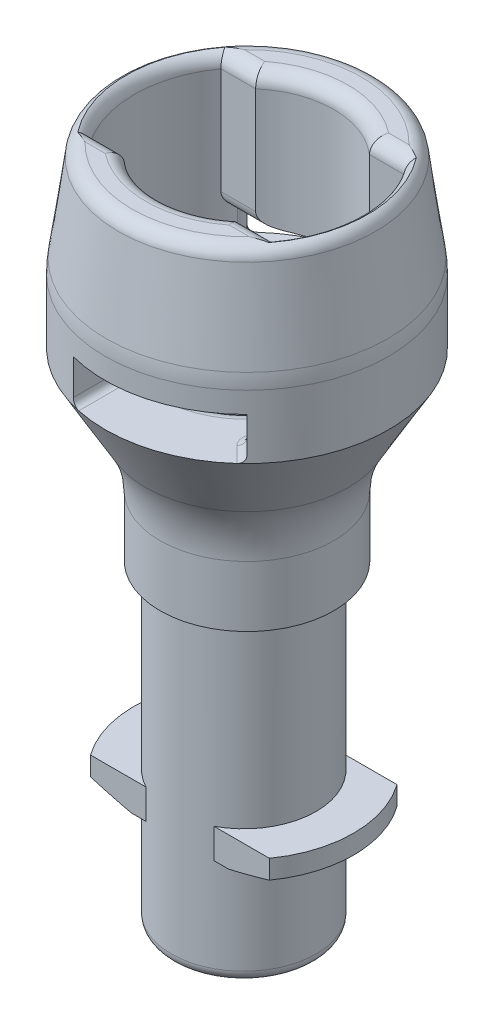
ISO-10303-21;
HEADER;
FILE_DESCRIPTION(('STEP AP214'),'2;1');
FILE_NAME('part.step','',(''),(''),'','','');
FILE_SCHEMA(('AUTOMOTIVE_DESIGN { 1 0 10303 214 1 1 1 1 }'));
ENDSEC;
DATA;
#1=APPLICATION_CONTEXT('core data for automotive mechanical design processes');
#2=APPLICATION_PROTOCOL_DEFINITION('international standard','automotive_design',2000,#1);
#3=PRODUCT_CONTEXT('',#1,'mechanical');
#4=PRODUCT('Part','Part','',(#3));
#5=PRODUCT_RELATED_PRODUCT_CATEGORY('part','',(#4));
#6=PRODUCT_DEFINITION_FORMATION('','',#4);
#7=PRODUCT_DEFINITION_CONTEXT('part definition',#1,'design');
#8=PRODUCT_DEFINITION('design','',#6,#7);
#9=PRODUCT_DEFINITION_SHAPE('','',#8);
#10=(LENGTH_UNIT() NAMED_UNIT(*) SI_UNIT(.MILLI.,.METRE.));
#11=(NAMED_UNIT(*) PLANE_ANGLE_UNIT() SI_UNIT($,.RADIAN.));
#12=(NAMED_UNIT(*) SI_UNIT($,.STERADIAN.) SOLID_ANGLE_UNIT());
#13=UNCERTAINTY_MEASURE_WITH_UNIT(LENGTH_MEASURE(1.E-05),#10,'distance_accuracy_value','');
#14=(GEOMETRIC_REPRESENTATION_CONTEXT(3) GLOBAL_UNCERTAINTY_ASSIGNED_CONTEXT((#13)) GLOBAL_UNIT_ASSIGNED_CONTEXT((#10,
#11,#12)) REPRESENTATION_CONTEXT('',''));
#15=CARTESIAN_POINT('',(0.,0.,0.));
#16=DIRECTION('',(0.,0.,1.));
#17=DIRECTION('',(1.,0.,0.));
#18=AXIS2_PLACEMENT_3D('',#15,#16,#17);
#19=CARTESIAN_POINT('',(655.27672151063,870.900813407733,1269.42702686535));
#20=DIRECTION('',(0.,1.,0.));
#21=DIRECTION('',(0.,0.,1.));
#22=AXIS2_PLACEMENT_3D('',#19,#20,#21);
#23=PLANE('',#22);
#24=CARTESIAN_POINT('',(655.27672151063,870.900813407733,1269.42702686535));
#25=DIRECTION('',(0.,1.,0.));
#26=DIRECTION('',(0.,0.,1.));
#27=AXIS2_PLACEMENT_3D('',#24,#25,#26);
#28=CIRCLE('',#27,10.2);
#29=CARTESIAN_POINT('',(660.07672151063,870.900813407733,1278.42702686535));
#30=VERTEX_POINT('',#29);
#31=CARTESIAN_POINT('',(660.07672151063,870.900813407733,1260.42702686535));
#32=VERTEX_POINT('',#31);
#33=EDGE_CURVE('P0_E28',#30,#32,#28,.T.);
#34=ORIENTED_EDGE('',*,*,#33,.F.);
#35=DIRECTION('',(1.,0.,0.));
#36=VECTOR('',#35,1.);
#37=CARTESIAN_POINT('',(667.896150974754,870.900813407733,1278.42702686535));
#38=LINE('',#37,#36);
#39=CARTESIAN_POINT('',(667.896150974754,870.900813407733,1278.42702686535));
#40=VERTEX_POINT('',#39);
#41=EDGE_CURVE('P0_E164',#30,#40,#38,.T.);
#42=ORIENTED_EDGE('',*,*,#41,.T.);
#43=CARTESIAN_POINT('',(655.27672151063,870.900813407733,1269.42702686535));
#44=DIRECTION('',(0.,1.,0.));
#45=DIRECTION('',(0.,0.,1.));
#46=AXIS2_PLACEMENT_3D('',#43,#44,#45);
#47=CIRCLE('',#46,15.5);
#48=CARTESIAN_POINT('',(667.896150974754,870.900813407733,1260.42702686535));
#49=VERTEX_POINT('',#48);
#50=EDGE_CURVE('P0_E229',#40,#49,#47,.T.);
#51=ORIENTED_EDGE('',*,*,#50,.T.);
#52=DIRECTION('',(-1.,0.,0.));
#53=VECTOR('',#52,1.);
#54=CARTESIAN_POINT('',(667.896150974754,870.900813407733,1260.42702686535));
#55=LINE('',#54,#53);
#56=EDGE_CURVE('P0_E171',#49,#32,#55,.T.);
#57=ORIENTED_EDGE('',*,*,#56,.T.);
#58=EDGE_LOOP('',(#34,#42,#51,#57));
#59=FACE_BOUND('',#58,.T.);
#60=ADVANCED_FACE('P0_F17',(#59),#23,.T.);
#61=CARTESIAN_POINT('',(655.27672151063,866.700813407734,1269.42702686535));
#62=DIRECTION('',(0.,1.,0.));
#63=DIRECTION('',(0.,0.,1.));
#64=AXIS2_PLACEMENT_3D('',#61,#62,#63);
#65=PLANE('',#64);
#66=DIRECTION('',(-0.996194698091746,0.,0.0871557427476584));
#67=VECTOR('',#66,1.);
#68=CARTESIAN_POINT('',(665.437907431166,866.700813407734,1268.53803828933));
#69=LINE('',#68,#67);
#70=CARTESIAN_POINT('',(666.533721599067,866.700813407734,1268.4421669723));
#71=VERTEX_POINT('',#70);
#72=CARTESIAN_POINT('',(665.437907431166,866.700813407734,1268.53803828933));
#73=VERTEX_POINT('',#72);
#74=EDGE_CURVE('P0_E35',#71,#73,#69,.T.);
#75=ORIENTED_EDGE('',*,*,#74,.T.);
#76=CARTESIAN_POINT('',(655.27672151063,866.700813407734,1269.42702686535));
#77=DIRECTION('',(0.,-1.,0.));
#78=DIRECTION('',(0.,0.,-1.));
#79=AXIS2_PLACEMENT_3D('',#76,#77,#78);
#80=CIRCLE('',#79,10.2);
#81=CARTESIAN_POINT('',(660.07672151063,866.700813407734,1260.42702686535));
#82=VERTEX_POINT('',#81);
#83=EDGE_CURVE('P0_E231',#82,#73,#80,.T.);
#84=ORIENTED_EDGE('',*,*,#83,.F.);
#85=DIRECTION('',(-1.,0.,0.));
#86=VECTOR('',#85,1.);
#87=CARTESIAN_POINT('',(667.896150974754,866.700813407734,1260.42702686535));
#88=LINE('',#87,#86);
#89=CARTESIAN_POINT('',(662.109729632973,866.700813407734,1260.42702686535));
#90=VERTEX_POINT('',#89);
#91=EDGE_CURVE('P0_E170',#90,#82,#88,.T.);
#92=ORIENTED_EDGE('',*,*,#91,.F.);
#93=CARTESIAN_POINT('',(655.27672151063,866.700813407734,1269.42702686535));
#94=DIRECTION('',(0.,1.,0.));
#95=DIRECTION('',(0.,0.,1.));
#96=AXIS2_PLACEMENT_3D('',#93,#94,#95);
#97=CIRCLE('',#96,11.3);
#98=EDGE_CURVE('P0_E284',#90,#71,#97,.F.);
#99=ORIENTED_EDGE('',*,*,#98,.T.);
#100=EDGE_LOOP('',(#75,#84,#92,#99));
#101=FACE_BOUND('',#100,.T.);
#102=ADVANCED_FACE('P0_F318',(#101),#65,.F.);
#103=CARTESIAN_POINT('',(655.27672151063,868.229488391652,1269.42702686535));
#104=DIRECTION('',(0.,1.,0.));
#105=DIRECTION('',(0.,0.,1.));
#106=AXIS2_PLACEMENT_3D('',#103,#104,#105);
#107=CONICAL_SURFACE('',#106,15.5,1.22173047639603);
#108=CARTESIAN_POINT('',(655.27672151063,868.229488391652,1269.42702686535));
#109=DIRECTION('',(0.,1.,0.));
#110=DIRECTION('',(0.,0.,1.));
#111=AXIS2_PLACEMENT_3D('',#108,#109,#110);
#112=CIRCLE('',#111,15.5);
#113=CARTESIAN_POINT('',(670.717739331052,868.229488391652,1268.07611285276));
#114=VERTEX_POINT('',#113);
#115=CARTESIAN_POINT('',(667.896150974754,868.229488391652,1260.42702686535));
#116=VERTEX_POINT('',#115);
#117=EDGE_CURVE('P0_E262',#114,#116,#112,.T.);
#118=ORIENTED_EDGE('',*,*,#117,.F.);
#119=DIRECTION('',(-0.936116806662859,-0.342020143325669,0.0818996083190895));
#120=VECTOR('',#119,1.);
#121=CARTESIAN_POINT('',(666.533721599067,866.700813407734,1268.4421669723));
#122=LINE('',#121,#120);
#123=EDGE_CURVE('P0_E189',#114,#71,#122,.T.);
#124=ORIENTED_EDGE('',*,*,#123,.T.);
#125=ORIENTED_EDGE('',*,*,#98,.F.);
#126=CARTESIAN_POINT('',(667.896150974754,868.229488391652,1260.42702686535));
#127=CARTESIAN_POINT('',(667.656987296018,868.158620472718,1260.42702686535));
#128=CARTESIAN_POINT('',(667.417640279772,868.0883706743,1260.42702686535));
#129=CARTESIAN_POINT('',(666.938534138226,867.949281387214,1260.42702686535));
#130=CARTESIAN_POINT('',(666.698775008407,867.880441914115,1260.42702686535));
#131=CARTESIAN_POINT('',(665.978971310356,867.676345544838,1260.42702686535));
#132=CARTESIAN_POINT('',(665.498248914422,867.543465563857,1260.42702686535));
#133=CARTESIAN_POINT('',(664.534540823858,867.285847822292,1260.42702686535));
#134=CARTESIAN_POINT('',(664.051554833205,867.161111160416,1260.42702686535));
#135=CARTESIAN_POINT('',(663.325036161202,866.981957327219,1260.42702686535));
#136=CARTESIAN_POINT('',(663.08248572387,866.923556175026,1260.42702686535));
#137=CARTESIAN_POINT('',(662.59666192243,866.80980093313,1260.42702686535));
#138=CARTESIAN_POINT('',(662.353388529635,866.754446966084,1260.42702686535));
#139=CARTESIAN_POINT('',(662.109729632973,866.700813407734,1260.42702686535));
#140=B_SPLINE_CURVE_WITH_KNOTS('',3,(#126,#127,#128,#129,#130,#131,#132,#133,#134,#135,#136,
#137,#138,#139),.UNSPECIFIED.,.F.,.F.,(4,2,2,2,2,2,4),(0.,0.748326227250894,1.49666071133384,
2.99285541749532,4.48925157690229,5.23768075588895,5.98614003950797),.UNSPECIFIED.);
#141=EDGE_CURVE('P0_E275',#116,#90,#140,.T.);
#142=ORIENTED_EDGE('',*,*,#141,.F.);
#143=EDGE_LOOP('',(#118,#124,#125,#142));
#144=FACE_BOUND('',#143,.T.);
#145=ADVANCED_FACE('P0_F298',(#144),#107,.T.);
#146=CARTESIAN_POINT('',(655.27672151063,866.700813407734,1269.42702686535));
#147=DIRECTION('',(0.,-1.,0.));
#148=DIRECTION('',(0.,0.,-1.));
#149=AXIS2_PLACEMENT_3D('',#146,#147,#148);
#150=PLANE('',#149);
#151=CARTESIAN_POINT('',(655.27672151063,866.700813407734,1269.42702686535));
#152=DIRECTION('',(0.,-1.,0.));
#153=DIRECTION('',(0.,0.,-1.));
#154=AXIS2_PLACEMENT_3D('',#151,#152,#153);
#155=CIRCLE('',#154,11.3);
#156=CARTESIAN_POINT('',(648.443713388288,866.700813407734,1278.42702686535));
#157=VERTEX_POINT('',#156);
#158=CARTESIAN_POINT('',(644.019721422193,866.700813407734,1270.4118867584));
#159=VERTEX_POINT('',#158);
#160=EDGE_CURVE('P0_E401',#157,#159,#155,.T.);
#161=ORIENTED_EDGE('',*,*,#160,.T.);
#162=DIRECTION('',(-0.996194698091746,0.,0.0871557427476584));
#163=VECTOR('',#162,1.);
#164=CARTESIAN_POINT('',(645.115535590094,866.700813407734,1270.31601544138));
#165=LINE('',#164,#163);
#166=CARTESIAN_POINT('',(645.115535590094,866.700813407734,1270.31601544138));
#167=VERTEX_POINT('',#166);
#168=EDGE_CURVE('P0_E43',#167,#159,#165,.T.);
#169=ORIENTED_EDGE('',*,*,#168,.F.);
#170=CARTESIAN_POINT('',(655.27672151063,866.700813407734,1269.42702686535));
#171=DIRECTION('',(0.,-1.,0.));
#172=DIRECTION('',(0.,0.,1.));
#173=AXIS2_PLACEMENT_3D('',#170,#171,#172);
#174=CIRCLE('',#173,10.2);
#175=CARTESIAN_POINT('',(650.47672151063,866.700813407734,1278.42702686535));
#176=VERTEX_POINT('',#175);
#177=EDGE_CURVE('P0_E247',#176,#167,#174,.T.);
#178=ORIENTED_EDGE('',*,*,#177,.F.);
#179=DIRECTION('',(1.,0.,0.));
#180=VECTOR('',#179,1.);
#181=CARTESIAN_POINT('',(642.657292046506,866.700813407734,1278.42702686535));
#182=LINE('',#181,#180);
#183=EDGE_CURVE('P0_E243',#157,#176,#182,.T.);
#184=ORIENTED_EDGE('',*,*,#183,.F.);
#185=EDGE_LOOP('',(#161,#169,#178,#184));
#186=FACE_BOUND('',#185,.T.);
#187=ADVANCED_FACE('P0_F375',(#186),#150,.T.);
#188=CARTESIAN_POINT('',(655.27672151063,868.229488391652,1269.42702686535));
#189=DIRECTION('',(0.,1.,0.));
#190=DIRECTION('',(0.,0.,1.));
#191=AXIS2_PLACEMENT_3D('',#188,#189,#190);
#192=CONICAL_SURFACE('',#191,15.5,1.22173047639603);
#193=CARTESIAN_POINT('',(655.27672151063,868.229488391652,1269.42702686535));
#194=DIRECTION('',(0.,-1.,0.));
#195=DIRECTION('',(0.,0.,-1.));
#196=AXIS2_PLACEMENT_3D('',#193,#194,#195);
#197=CIRCLE('',#196,15.5);
#198=CARTESIAN_POINT('',(639.835703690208,868.229488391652,1270.77794087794));
#199=VERTEX_POINT('',#198);
#200=CARTESIAN_POINT('',(642.657292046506,868.229488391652,1278.42702686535));
#201=VERTEX_POINT('',#200);
#202=EDGE_CURVE('P0_E308',#199,#201,#197,.F.);
#203=ORIENTED_EDGE('',*,*,#202,.F.);
#204=DIRECTION('',(-0.93611680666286,0.342020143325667,0.0818996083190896));
#205=VECTOR('',#204,1.);
#206=CARTESIAN_POINT('',(644.019721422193,866.700813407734,1270.4118867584));
#207=LINE('',#206,#205);
#208=EDGE_CURVE('P0_E205',#159,#199,#207,.T.);
#209=ORIENTED_EDGE('',*,*,#208,.F.);
#210=ORIENTED_EDGE('',*,*,#160,.F.);
#211=CARTESIAN_POINT('',(642.657292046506,868.229488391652,1278.42702686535));
#212=CARTESIAN_POINT('',(642.896455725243,868.158620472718,1278.42702686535));
#213=CARTESIAN_POINT('',(643.135802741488,868.0883706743,1278.42702686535));
#214=CARTESIAN_POINT('',(643.614908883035,867.949281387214,1278.42702686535));
#215=CARTESIAN_POINT('',(643.854668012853,867.880441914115,1278.42702686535));
#216=CARTESIAN_POINT('',(644.574471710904,867.676345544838,1278.42702686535));
#217=CARTESIAN_POINT('',(645.055194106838,867.543465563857,1278.42702686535));
#218=CARTESIAN_POINT('',(646.018902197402,867.285847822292,1278.42702686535));
#219=CARTESIAN_POINT('',(646.501888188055,867.161111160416,1278.42702686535));
#220=CARTESIAN_POINT('',(647.228406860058,866.981957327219,1278.42702686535));
#221=CARTESIAN_POINT('',(647.47095729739,866.923556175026,1278.42702686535));
#222=CARTESIAN_POINT('',(647.956781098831,866.80980093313,1278.42702686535));
#223=CARTESIAN_POINT('',(648.200054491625,866.754446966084,1278.42702686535));
#224=CARTESIAN_POINT('',(648.443713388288,866.700813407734,1278.42702686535));
#225=B_SPLINE_CURVE_WITH_KNOTS('',3,(#211,#212,#213,#214,#215,#216,#217,#218,#219,#220,#221,
#222,#223,#224),.UNSPECIFIED.,.F.,.F.,(4,2,2,2,2,2,4),(0.,0.748326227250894,1.49666071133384,
2.99285541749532,4.48925157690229,5.23768075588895,5.98614003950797),.UNSPECIFIED.);
#226=EDGE_CURVE('P0_E424',#201,#157,#225,.T.);
#227=ORIENTED_EDGE('',*,*,#226,.F.);
#228=EDGE_LOOP('',(#203,#209,#210,#227));
#229=FACE_BOUND('',#228,.T.);
#230=ADVANCED_FACE('P0_F368',(#229),#192,.T.);
#231=CARTESIAN_POINT('',(650.47672151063,870.900813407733,1260.42702686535));
#232=VERTEX_POINT('',#231);
#233=CARTESIAN_POINT('',(650.47672151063,870.900813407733,1278.42702686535));
#234=VERTEX_POINT('',#233);
#235=EDGE_CURVE('P0_E11',#232,#234,#28,.T.);
#236=ORIENTED_EDGE('',*,*,#235,.F.);
#237=DIRECTION('',(-1.,0.,0.));
#238=VECTOR('',#237,1.);
#239=CARTESIAN_POINT('',(642.657292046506,870.900813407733,1260.42702686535));
#240=LINE('',#239,#238);
#241=CARTESIAN_POINT('',(642.657292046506,870.900813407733,1260.42702686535));
#242=VERTEX_POINT('',#241);
#243=EDGE_CURVE('P0_E246',#232,#242,#240,.T.);
#244=ORIENTED_EDGE('',*,*,#243,.T.);
#245=CARTESIAN_POINT('',(655.27672151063,870.900813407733,1269.42702686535));
#246=DIRECTION('',(0.,1.,0.));
#247=DIRECTION('',(0.,0.,-1.));
#248=AXIS2_PLACEMENT_3D('',#245,#246,#247);
#249=CIRCLE('',#248,15.5);
#250=CARTESIAN_POINT('',(642.657292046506,870.900813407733,1278.42702686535));
#251=VERTEX_POINT('',#250);
#252=EDGE_CURVE('P0_E239',#242,#251,#249,.T.);
#253=ORIENTED_EDGE('',*,*,#252,.T.);
#254=DIRECTION('',(1.,0.,0.));
#255=VECTOR('',#254,1.);
#256=CARTESIAN_POINT('',(642.657292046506,870.900813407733,1278.42702686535));
#257=LINE('',#256,#255);
#258=EDGE_CURVE('P0_E256',#251,#234,#257,.T.);
#259=ORIENTED_EDGE('',*,*,#258,.T.);
#260=EDGE_LOOP('',(#236,#244,#253,#259));
#261=FACE_BOUND('',#260,.T.);
#262=ADVANCED_FACE('P0_F360',(#261),#23,.T.);
#263=CARTESIAN_POINT('',(655.27672151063,851.900813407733,1269.42702686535));
#264=DIRECTION('',(0.,1.,0.));
#265=DIRECTION('',(0.,0.,1.));
#266=AXIS2_PLACEMENT_3D('',#263,#264,#265);
#267=PLANE('',#266);
#268=CARTESIAN_POINT('',(655.27672151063,851.900813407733,1269.42702686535));
#269=DIRECTION('',(0.,1.,0.));
#270=DIRECTION('',(0.,0.,1.));
#271=AXIS2_PLACEMENT_3D('',#268,#269,#270);
#272=CIRCLE('',#271,8.6);
#273=CARTESIAN_POINT('',(655.27672151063,851.900813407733,1278.02702686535));
#274=VERTEX_POINT('',#273);
#275=EDGE_CURVE('P0_E26',#274,#274,#272,.F.);
#276=ORIENTED_EDGE('',*,*,#275,.T.);
#277=EDGE_LOOP('',(#276));
#278=FACE_BOUND('',#277,.T.);
#279=CARTESIAN_POINT('',(655.27672151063,851.900813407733,1269.42702686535));
#280=DIRECTION('',(0.,1.,0.));
#281=DIRECTION('',(0.,0.,1.));
#282=AXIS2_PLACEMENT_3D('',#279,#280,#281);
#283=CIRCLE('',#282,5.20470053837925);
#284=CARTESIAN_POINT('',(655.27672151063,851.900813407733,1274.63172740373));
#285=VERTEX_POINT('',#284);
#286=EDGE_CURVE('P0_E400',#285,#285,#283,.T.);
#287=ORIENTED_EDGE('',*,*,#286,.T.);
#288=EDGE_LOOP('',(#287));
#289=FACE_BOUND('',#288,.T.);
#290=ADVANCED_FACE('P0_F367',(#278,#289),#267,.F.);
#291=CARTESIAN_POINT('',(655.27672151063,870.900813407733,1269.42702686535));
#292=DIRECTION('',(0.,-1.,0.));
#293=DIRECTION('',(0.,0.,-1.));
#294=AXIS2_PLACEMENT_3D('',#291,#292,#293);
#295=CYLINDRICAL_SURFACE('',#294,10.2);
#296=DIRECTION('',(0.,1.,0.));
#297=VECTOR('',#296,1.);
#298=CARTESIAN_POINT('',(650.47672151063,866.700813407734,1260.42702686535));
#299=LINE('',#298,#297);
#300=CARTESIAN_POINT('',(650.47672151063,866.700813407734,1260.42702686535));
#301=VERTEX_POINT('',#300);
#302=EDGE_CURVE('P0_E263',#301,#232,#299,.T.);
#303=ORIENTED_EDGE('',*,*,#302,.T.);
#304=ORIENTED_EDGE('',*,*,#235,.T.);
#305=DIRECTION('',(0.,1.,0.));
#306=VECTOR('',#305,1.);
#307=CARTESIAN_POINT('',(650.47672151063,866.700813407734,1278.42702686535));
#308=LINE('',#307,#306);
#309=EDGE_CURVE('P0_E266',#176,#234,#308,.T.);
#310=ORIENTED_EDGE('',*,*,#309,.F.);
#311=ORIENTED_EDGE('',*,*,#177,.T.);
#312=DIRECTION('',(0.,1.,0.));
#313=VECTOR('',#312,1.);
#314=CARTESIAN_POINT('',(645.115535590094,865.100813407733,1270.31601544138));
#315=LINE('',#314,#313);
#316=CARTESIAN_POINT('',(645.115535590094,865.100813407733,1270.31601544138));
#317=VERTEX_POINT('',#316);
#318=EDGE_CURVE('P0_E210',#317,#167,#315,.T.);
#319=ORIENTED_EDGE('',*,*,#318,.F.);
#320=CARTESIAN_POINT('',(655.27672151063,865.100813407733,1269.42702686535));
#321=DIRECTION('',(0.,1.,0.));
#322=DIRECTION('',(0.,0.,1.));
#323=AXIS2_PLACEMENT_3D('',#320,#321,#322);
#324=CIRCLE('',#323,10.2);
#325=CARTESIAN_POINT('',(645.115535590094,865.100813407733,1268.53803828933));
#326=VERTEX_POINT('',#325);
#327=EDGE_CURVE('P0_E227',#326,#317,#324,.T.);
#328=ORIENTED_EDGE('',*,*,#327,.F.);
#329=DIRECTION('',(0.,1.,0.));
#330=VECTOR('',#329,1.);
#331=CARTESIAN_POINT('',(645.115535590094,865.100813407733,1268.53803828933));
#332=LINE('',#331,#330);
#333=CARTESIAN_POINT('',(645.115535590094,866.700813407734,1268.53803828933));
#334=VERTEX_POINT('',#333);
#335=EDGE_CURVE('P0_E218',#326,#334,#332,.T.);
#336=ORIENTED_EDGE('',*,*,#335,.T.);
#337=EDGE_CURVE('P0_E245',#334,#301,#174,.T.);
#338=ORIENTED_EDGE('',*,*,#337,.T.);
#339=EDGE_LOOP('',(#303,#304,#310,#311,#319,#328,#336,#338));
#340=FACE_BOUND('',#339,.T.);
#341=CARTESIAN_POINT('',(655.27672151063,853.500813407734,1269.42702686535));
#342=DIRECTION('',(0.,1.,0.));
#343=DIRECTION('',(0.,0.,1.));
#344=AXIS2_PLACEMENT_3D('',#341,#342,#343);
#345=CIRCLE('',#344,10.2);
#346=CARTESIAN_POINT('',(655.27672151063,853.500813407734,1279.62702686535));
#347=VERTEX_POINT('',#346);
#348=EDGE_CURVE('P0_E541',#347,#347,#345,.T.);
#349=ORIENTED_EDGE('',*,*,#348,.T.);
#350=EDGE_LOOP('',(#349));
#351=FACE_BOUND('',#350,.T.);
#352=CARTESIAN_POINT('',(655.27672151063,865.100813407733,1269.42702686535));
#353=DIRECTION('',(0.,1.,0.));
#354=DIRECTION('',(0.,0.,1.));
#355=AXIS2_PLACEMENT_3D('',#352,#353,#354);
#356=CIRCLE('',#355,10.2);
#357=CARTESIAN_POINT('',(665.437907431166,865.100813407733,1270.31601544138));
#358=VERTEX_POINT('',#357);
#359=CARTESIAN_POINT('',(665.437907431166,865.100813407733,1268.53803828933));
#360=VERTEX_POINT('',#359);
#361=EDGE_CURVE('P0_E203',#358,#360,#356,.T.);
#362=ORIENTED_EDGE('',*,*,#361,.F.);
#363=DIRECTION('',(0.,-1.,0.));
#364=VECTOR('',#363,1.);
#365=CARTESIAN_POINT('',(665.437907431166,865.100813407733,1270.31601544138));
#366=LINE('',#365,#364);
#367=CARTESIAN_POINT('',(665.437907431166,866.700813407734,1270.31601544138));
#368=VERTEX_POINT('',#367);
#369=EDGE_CURVE('P0_E193',#368,#358,#366,.T.);
#370=ORIENTED_EDGE('',*,*,#369,.F.);
#371=CARTESIAN_POINT('',(660.07672151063,866.700813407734,1278.42702686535));
#372=VERTEX_POINT('',#371);
#373=EDGE_CURVE('P0_E156',#368,#372,#80,.T.);
#374=ORIENTED_EDGE('',*,*,#373,.T.);
#375=DIRECTION('',(0.,1.,0.));
#376=VECTOR('',#375,1.);
#377=CARTESIAN_POINT('',(660.07672151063,866.700813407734,1278.42702686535));
#378=LINE('',#377,#376);
#379=EDGE_CURVE('P0_E147',#372,#30,#378,.T.);
#380=ORIENTED_EDGE('',*,*,#379,.T.);
#381=ORIENTED_EDGE('',*,*,#33,.T.);
#382=DIRECTION('',(0.,1.,0.));
#383=VECTOR('',#382,1.);
#384=CARTESIAN_POINT('',(660.07672151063,866.700813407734,1260.42702686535));
#385=LINE('',#384,#383);
#386=EDGE_CURVE('P0_E161',#82,#32,#385,.T.);
#387=ORIENTED_EDGE('',*,*,#386,.F.);
#388=ORIENTED_EDGE('',*,*,#83,.T.);
#389=DIRECTION('',(0.,-1.,0.));
#390=VECTOR('',#389,1.);
#391=CARTESIAN_POINT('',(665.437907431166,865.100813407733,1268.53803828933));
#392=LINE('',#391,#390);
#393=EDGE_CURVE('P0_E184',#73,#360,#392,.T.);
#394=ORIENTED_EDGE('',*,*,#393,.T.);
#395=EDGE_LOOP('',(#362,#370,#374,#380,#381,#387,#388,#394));
#396=FACE_BOUND('',#395,.T.);
#397=CARTESIAN_POINT('',(655.27672151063,896.900813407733,1269.42702686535));
#398=DIRECTION('',(0.,1.,0.));
#399=DIRECTION('',(0.,0.,1.));
#400=AXIS2_PLACEMENT_3D('',#397,#398,#399);
#401=CIRCLE('',#400,10.2);
#402=CARTESIAN_POINT('',(655.27672151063,896.900813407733,1279.62702686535));
#403=VERTEX_POINT('',#402);
#404=EDGE_CURVE('P0_E175',#403,#403,#401,.T.);
#405=ORIENTED_EDGE('',*,*,#404,.F.);
#406=EDGE_LOOP('',(#405));
#407=FACE_BOUND('',#406,.T.);
#408=ADVANCED_FACE('P0_F150',(#340,#351,#396,#407),#295,.T.);
#409=CARTESIAN_POINT('',(655.27672151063,870.900813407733,1269.42702686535));
#410=DIRECTION('',(0.,-1.,0.));
#411=DIRECTION('',(0.,0.,-1.));
#412=AXIS2_PLACEMENT_3D('',#409,#410,#411);
#413=CYLINDRICAL_SURFACE('',#412,4.05);
#414=CARTESIAN_POINT('',(655.27672151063,853.900813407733,1269.42702686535));
#415=DIRECTION('',(0.,1.,0.));
#416=DIRECTION('',(0.,0.,1.));
#417=AXIS2_PLACEMENT_3D('',#414,#415,#416);
#418=CIRCLE('',#417,4.05);
#419=CARTESIAN_POINT('',(655.27672151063,853.900813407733,1273.47702686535));
#420=VERTEX_POINT('',#419);
#421=EDGE_CURVE('P0_E404',#420,#420,#418,.F.);
#422=ORIENTED_EDGE('',*,*,#421,.T.);
#423=EDGE_LOOP('',(#422));
#424=FACE_BOUND('',#423,.T.);
#425=CARTESIAN_POINT('',(655.27672151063,870.900813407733,1269.42702686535));
#426=DIRECTION('',(0.,1.,0.));
#427=DIRECTION('',(0.,0.,1.));
#428=AXIS2_PLACEMENT_3D('',#425,#426,#427);
#429=CIRCLE('',#428,4.05);
#430=CARTESIAN_POINT('',(655.27672151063,870.900813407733,1273.47702686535));
#431=VERTEX_POINT('',#430);
#432=EDGE_CURVE('P0_E177',#431,#431,#429,.T.);
#433=ORIENTED_EDGE('',*,*,#432,.T.);
#434=EDGE_LOOP('',(#433));
#435=FACE_BOUND('',#434,.T.);
#436=ADVANCED_FACE('P0_F546',(#424,#435),#413,.F.);
#437=CARTESIAN_POINT('',(655.27672151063,866.700813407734,1269.42702686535));
#438=DIRECTION('',(0.,1.,0.));
#439=DIRECTION('',(0.,0.,1.));
#440=AXIS2_PLACEMENT_3D('',#437,#438,#439);
#441=CYLINDRICAL_SURFACE('',#440,15.5);
#442=DIRECTION('',(0.,1.,0.));
#443=VECTOR('',#442,1.);
#444=CARTESIAN_POINT('',(642.657292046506,866.700813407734,1260.42702686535));
#445=LINE('',#444,#443);
#446=CARTESIAN_POINT('',(642.657292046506,868.229488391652,1260.42702686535));
#447=VERTEX_POINT('',#446);
#448=EDGE_CURVE('P0_E260',#447,#242,#445,.T.);
#449=ORIENTED_EDGE('',*,*,#448,.F.);
#450=CARTESIAN_POINT('',(639.835703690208,868.229488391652,1268.07611285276));
#451=VERTEX_POINT('',#450);
#452=EDGE_CURVE('P0_E309',#447,#451,#197,.F.);
#453=ORIENTED_EDGE('',*,*,#452,.T.);
#454=CARTESIAN_POINT('',(655.27672151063,868.229488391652,1269.42702686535));
#455=DIRECTION('',(0.,1.,0.));
#456=DIRECTION('',(0.,0.,1.));
#457=AXIS2_PLACEMENT_3D('',#454,#455,#456);
#458=CIRCLE('',#457,15.5);
#459=EDGE_CURVE('P0_E224',#451,#199,#458,.T.);
#460=ORIENTED_EDGE('',*,*,#459,.T.);
#461=ORIENTED_EDGE('',*,*,#202,.T.);
#462=DIRECTION('',(0.,1.,0.));
#463=VECTOR('',#462,1.);
#464=CARTESIAN_POINT('',(642.657292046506,866.700813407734,1278.42702686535));
#465=LINE('',#464,#463);
#466=EDGE_CURVE('P0_E253',#201,#251,#465,.T.);
#467=ORIENTED_EDGE('',*,*,#466,.T.);
#468=ORIENTED_EDGE('',*,*,#252,.F.);
#469=EDGE_LOOP('',(#449,#453,#460,#461,#467,#468));
#470=FACE_BOUND('',#469,.T.);
#471=ADVANCED_FACE('P0_F419',(#470),#441,.T.);
#472=CARTESIAN_POINT('',(642.657292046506,866.700813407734,1260.42702686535));
#473=DIRECTION('',(0.,0.,-1.));
#474=DIRECTION('',(-1.,0.,0.));
#475=AXIS2_PLACEMENT_3D('',#472,#473,#474);
#476=PLANE('',#475);
#477=DIRECTION('',(-1.,0.,0.));
#478=VECTOR('',#477,1.);
#479=CARTESIAN_POINT('',(642.657292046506,866.700813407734,1260.42702686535));
#480=LINE('',#479,#478);
#481=CARTESIAN_POINT('',(648.443713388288,866.700813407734,1260.42702686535));
#482=VERTEX_POINT('',#481);
#483=EDGE_CURVE('P0_E250',#301,#482,#480,.T.);
#484=ORIENTED_EDGE('',*,*,#483,.T.);
#485=CARTESIAN_POINT('',(648.443713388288,866.700813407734,1260.42702686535));
#486=CARTESIAN_POINT('',(648.200054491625,866.754446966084,1260.42702686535));
#487=CARTESIAN_POINT('',(647.956781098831,866.80980093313,1260.42702686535));
#488=CARTESIAN_POINT('',(647.47095729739,866.923556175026,1260.42702686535));
#489=CARTESIAN_POINT('',(647.228406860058,866.981957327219,1260.42702686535));
#490=CARTESIAN_POINT('',(646.501888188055,867.161111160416,1260.42702686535));
#491=CARTESIAN_POINT('',(646.018902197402,867.285847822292,1260.42702686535));
#492=CARTESIAN_POINT('',(645.055194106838,867.543465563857,1260.42702686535));
#493=CARTESIAN_POINT('',(644.574471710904,867.676345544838,1260.42702686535));
#494=CARTESIAN_POINT('',(643.854668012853,867.880441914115,1260.42702686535));
#495=CARTESIAN_POINT('',(643.614908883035,867.949281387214,1260.42702686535));
#496=CARTESIAN_POINT('',(643.135802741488,868.0883706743,1260.42702686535));
#497=CARTESIAN_POINT('',(642.896455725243,868.158620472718,1260.42702686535));
#498=CARTESIAN_POINT('',(642.657292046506,868.229488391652,1260.42702686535));
#499=B_SPLINE_CURVE_WITH_KNOTS('',3,(#485,#486,#487,#488,#489,#490,#491,#492,#493,#494,#495,
#496,#497,#498),.UNSPECIFIED.,.F.,.F.,(4,2,2,2,2,2,4),(0.,0.748459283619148,1.49688846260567,
2.99328462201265,4.48947932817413,5.23781381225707,5.98614003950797),.UNSPECIFIED.);
#500=EDGE_CURVE('P0_E396',#482,#447,#499,.T.);
#501=ORIENTED_EDGE('',*,*,#500,.T.);
#502=ORIENTED_EDGE('',*,*,#448,.T.);
#503=ORIENTED_EDGE('',*,*,#243,.F.);
#504=ORIENTED_EDGE('',*,*,#302,.F.);
#505=EDGE_LOOP('',(#484,#501,#502,#503,#504));
#506=FACE_BOUND('',#505,.T.);
#507=ADVANCED_FACE('P0_F383',(#506),#476,.T.);
#508=CARTESIAN_POINT('',(642.657292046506,866.700813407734,1278.42702686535));
#509=DIRECTION('',(0.,0.,1.));
#510=DIRECTION('',(1.,0.,0.));
#511=AXIS2_PLACEMENT_3D('',#508,#509,#510);
#512=PLANE('',#511);
#513=ORIENTED_EDGE('',*,*,#466,.F.);
#514=ORIENTED_EDGE('',*,*,#226,.T.);
#515=ORIENTED_EDGE('',*,*,#183,.T.);
#516=ORIENTED_EDGE('',*,*,#309,.T.);
#517=ORIENTED_EDGE('',*,*,#258,.F.);
#518=EDGE_LOOP('',(#513,#514,#515,#516,#517));
#519=FACE_BOUND('',#518,.T.);
#520=ADVANCED_FACE('P0_F418',(#519),#512,.T.);
#521=DIRECTION('',(-0.996194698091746,0.,-0.0871557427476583));
#522=VECTOR('',#521,1.);
#523=CARTESIAN_POINT('',(645.115535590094,866.700813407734,1268.53803828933));
#524=LINE('',#523,#522);
#525=CARTESIAN_POINT('',(644.019721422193,866.700813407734,1268.4421669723));
#526=VERTEX_POINT('',#525);
#527=EDGE_CURVE('P0_E221',#334,#526,#524,.T.);
#528=ORIENTED_EDGE('',*,*,#527,.T.);
#529=EDGE_CURVE('P0_E394',#526,#482,#155,.T.);
#530=ORIENTED_EDGE('',*,*,#529,.T.);
#531=ORIENTED_EDGE('',*,*,#483,.F.);
#532=ORIENTED_EDGE('',*,*,#337,.F.);
#533=EDGE_LOOP('',(#528,#530,#531,#532));
#534=FACE_BOUND('',#533,.T.);
#535=ADVANCED_FACE('P0_F392',(#534),#150,.T.);
#536=CARTESIAN_POINT('',(655.27672151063,866.700813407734,1269.42702686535));
#537=DIRECTION('',(0.,1.,0.));
#538=DIRECTION('',(0.,0.,1.));
#539=AXIS2_PLACEMENT_3D('',#536,#537,#538);
#540=CYLINDRICAL_SURFACE('',#539,15.5);
#541=DIRECTION('',(0.,1.,0.));
#542=VECTOR('',#541,1.);
#543=CARTESIAN_POINT('',(667.896150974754,866.700813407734,1278.42702686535));
#544=LINE('',#543,#542);
#545=CARTESIAN_POINT('',(667.896150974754,868.229488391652,1278.42702686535));
#546=VERTEX_POINT('',#545);
#547=EDGE_CURVE('P0_E160',#546,#40,#544,.T.);
#548=ORIENTED_EDGE('',*,*,#547,.F.);
#549=CARTESIAN_POINT('',(670.717739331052,868.229488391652,1270.77794087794));
#550=VERTEX_POINT('',#549);
#551=EDGE_CURVE('P0_E272',#546,#550,#112,.T.);
#552=ORIENTED_EDGE('',*,*,#551,.T.);
#553=CARTESIAN_POINT('',(655.27672151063,868.229488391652,1269.42702686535));
#554=DIRECTION('',(0.,1.,0.));
#555=DIRECTION('',(0.,0.,1.));
#556=AXIS2_PLACEMENT_3D('',#553,#554,#555);
#557=CIRCLE('',#556,15.5);
#558=EDGE_CURVE('P0_E200',#550,#114,#557,.T.);
#559=ORIENTED_EDGE('',*,*,#558,.T.);
#560=ORIENTED_EDGE('',*,*,#117,.T.);
#561=DIRECTION('',(0.,1.,0.));
#562=VECTOR('',#561,1.);
#563=CARTESIAN_POINT('',(667.896150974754,866.700813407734,1260.42702686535));
#564=LINE('',#563,#562);
#565=EDGE_CURVE('P0_E236',#116,#49,#564,.T.);
#566=ORIENTED_EDGE('',*,*,#565,.T.);
#567=ORIENTED_EDGE('',*,*,#50,.F.);
#568=EDGE_LOOP('',(#548,#552,#559,#560,#566,#567));
#569=FACE_BOUND('',#568,.T.);
#570=ADVANCED_FACE('P0_F314',(#569),#540,.T.);
#571=CARTESIAN_POINT('',(667.896150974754,866.700813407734,1278.42702686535));
#572=DIRECTION('',(0.,0.,1.));
#573=DIRECTION('',(1.,0.,0.));
#574=AXIS2_PLACEMENT_3D('',#571,#572,#573);
#575=PLANE('',#574);
#576=DIRECTION('',(1.,0.,0.));
#577=VECTOR('',#576,1.);
#578=CARTESIAN_POINT('',(667.896150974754,866.700813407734,1278.42702686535));
#579=LINE('',#578,#577);
#580=CARTESIAN_POINT('',(662.109729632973,866.700813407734,1278.42702686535));
#581=VERTEX_POINT('',#580);
#582=EDGE_CURVE('P0_E234',#372,#581,#579,.T.);
#583=ORIENTED_EDGE('',*,*,#582,.T.);
#584=CARTESIAN_POINT('',(662.109729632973,866.700813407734,1278.42702686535));
#585=CARTESIAN_POINT('',(662.353388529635,866.754446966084,1278.42702686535));
#586=CARTESIAN_POINT('',(662.59666192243,866.80980093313,1278.42702686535));
#587=CARTESIAN_POINT('',(663.08248572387,866.923556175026,1278.42702686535));
#588=CARTESIAN_POINT('',(663.325036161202,866.981957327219,1278.42702686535));
#589=CARTESIAN_POINT('',(664.051554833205,867.161111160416,1278.42702686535));
#590=CARTESIAN_POINT('',(664.534540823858,867.285847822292,1278.42702686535));
#591=CARTESIAN_POINT('',(665.498248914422,867.543465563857,1278.42702686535));
#592=CARTESIAN_POINT('',(665.978971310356,867.676345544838,1278.42702686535));
#593=CARTESIAN_POINT('',(666.698775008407,867.880441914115,1278.42702686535));
#594=CARTESIAN_POINT('',(666.938534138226,867.949281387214,1278.42702686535));
#595=CARTESIAN_POINT('',(667.417640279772,868.0883706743,1278.42702686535));
#596=CARTESIAN_POINT('',(667.656987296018,868.158620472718,1278.42702686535));
#597=CARTESIAN_POINT('',(667.896150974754,868.229488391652,1278.42702686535));
#598=B_SPLINE_CURVE_WITH_KNOTS('',3,(#584,#585,#586,#587,#588,#589,#590,#591,#592,#593,#594,
#595,#596,#597),.UNSPECIFIED.,.F.,.F.,(4,2,2,2,2,2,4),(0.,0.748459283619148,1.49688846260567,
2.99328462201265,4.48947932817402,5.23781381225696,5.98614003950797),.UNSPECIFIED.);
#599=EDGE_CURVE('P0_E302',#581,#546,#598,.T.);
#600=ORIENTED_EDGE('',*,*,#599,.T.);
#601=ORIENTED_EDGE('',*,*,#547,.T.);
#602=ORIENTED_EDGE('',*,*,#41,.F.);
#603=ORIENTED_EDGE('',*,*,#379,.F.);
#604=EDGE_LOOP('',(#583,#600,#601,#602,#603));
#605=FACE_BOUND('',#604,.T.);
#606=ADVANCED_FACE('P0_F165',(#605),#575,.T.);
#607=CARTESIAN_POINT('',(667.896150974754,866.700813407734,1260.42702686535));
#608=DIRECTION('',(0.,0.,-1.));
#609=DIRECTION('',(-1.,0.,0.));
#610=AXIS2_PLACEMENT_3D('',#607,#608,#609);
#611=PLANE('',#610);
#612=ORIENTED_EDGE('',*,*,#565,.F.);
#613=ORIENTED_EDGE('',*,*,#141,.T.);
#614=ORIENTED_EDGE('',*,*,#91,.T.);
#615=ORIENTED_EDGE('',*,*,#386,.T.);
#616=ORIENTED_EDGE('',*,*,#56,.F.);
#617=EDGE_LOOP('',(#612,#613,#614,#615,#616));
#618=FACE_BOUND('',#617,.T.);
#619=ADVANCED_FACE('P0_F286',(#618),#611,.T.);
#620=ORIENTED_EDGE('',*,*,#373,.F.);
#621=DIRECTION('',(-0.996194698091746,0.,-0.0871557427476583));
#622=VECTOR('',#621,1.);
#623=CARTESIAN_POINT('',(665.437907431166,866.700813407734,1270.31601544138));
#624=LINE('',#623,#622);
#625=CARTESIAN_POINT('',(666.533721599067,866.700813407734,1270.4118867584));
#626=VERTEX_POINT('',#625);
#627=EDGE_CURVE('P0_E191',#626,#368,#624,.T.);
#628=ORIENTED_EDGE('',*,*,#627,.F.);
#629=EDGE_CURVE('P0_E283',#626,#581,#97,.F.);
#630=ORIENTED_EDGE('',*,*,#629,.T.);
#631=ORIENTED_EDGE('',*,*,#582,.F.);
#632=EDGE_LOOP('',(#620,#628,#630,#631));
#633=FACE_BOUND('',#632,.T.);
#634=ADVANCED_FACE('P0_F296',(#633),#65,.F.);
#635=DIRECTION('',(-0.936116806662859,-0.342020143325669,-0.0818996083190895));
#636=VECTOR('',#635,1.);
#637=CARTESIAN_POINT('',(666.533721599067,866.700813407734,1270.4118867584));
#638=LINE('',#637,#636);
#639=EDGE_CURVE('P0_E198',#550,#626,#638,.T.);
#640=ORIENTED_EDGE('',*,*,#639,.F.);
#641=ORIENTED_EDGE('',*,*,#551,.F.);
#642=ORIENTED_EDGE('',*,*,#599,.F.);
#643=ORIENTED_EDGE('',*,*,#629,.F.);
#644=EDGE_LOOP('',(#640,#641,#642,#643));
#645=FACE_BOUND('',#644,.T.);
#646=ADVANCED_FACE('P0_F290',(#645),#107,.T.);
#647=DIRECTION('',(-0.93611680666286,0.342020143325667,-0.0818996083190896));
#648=VECTOR('',#647,1.);
#649=CARTESIAN_POINT('',(644.019721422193,866.700813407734,1268.4421669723));
#650=LINE('',#649,#648);
#651=EDGE_CURVE('P0_E213',#526,#451,#650,.T.);
#652=ORIENTED_EDGE('',*,*,#651,.T.);
#653=ORIENTED_EDGE('',*,*,#452,.F.);
#654=ORIENTED_EDGE('',*,*,#500,.F.);
#655=ORIENTED_EDGE('',*,*,#529,.F.);
#656=EDGE_LOOP('',(#652,#653,#654,#655));
#657=FACE_BOUND('',#656,.T.);
#658=ADVANCED_FACE('P0_F295',(#657),#192,.T.);
#659=CARTESIAN_POINT('',(655.27672151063,868.229488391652,1269.42702686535));
#660=DIRECTION('',(0.,1.,0.));
#661=DIRECTION('',(0.,0.,1.));
#662=AXIS2_PLACEMENT_3D('',#659,#660,#661);
#663=CONICAL_SURFACE('',#662,15.5,1.03752781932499);
#664=DIRECTION('',(0.857873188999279,-0.508350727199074,0.0750541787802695));
#665=VECTOR('',#664,1.);
#666=CARTESIAN_POINT('',(639.835703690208,868.229488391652,1268.07611285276));
#667=LINE('',#666,#665);
#668=EDGE_CURVE('P0_E216',#451,#326,#667,.T.);
#669=ORIENTED_EDGE('',*,*,#668,.T.);
#670=ORIENTED_EDGE('',*,*,#327,.T.);
#671=DIRECTION('',(0.857873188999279,-0.508350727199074,-0.0750541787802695));
#672=VECTOR('',#671,1.);
#673=CARTESIAN_POINT('',(639.835703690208,868.229488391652,1270.77794087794));
#674=LINE('',#673,#672);
#675=EDGE_CURVE('P0_E207',#199,#317,#674,.T.);
#676=ORIENTED_EDGE('',*,*,#675,.F.);
#677=ORIENTED_EDGE('',*,*,#459,.F.);
#678=EDGE_LOOP('',(#669,#670,#676,#677));
#679=FACE_BOUND('',#678,.T.);
#680=ADVANCED_FACE('P0_F319',(#679),#663,.T.);
#681=CARTESIAN_POINT('',(655.27672151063,851.900813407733,1269.42702686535));
#682=DIRECTION('',(0.0871557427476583,0.,-0.996194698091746));
#683=DIRECTION('',(-0.996194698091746,0.,-0.0871557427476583));
#684=AXIS2_PLACEMENT_3D('',#681,#682,#683);
#685=PLANE('',#684);
#686=ORIENTED_EDGE('',*,*,#651,.F.);
#687=ORIENTED_EDGE('',*,*,#527,.F.);
#688=ORIENTED_EDGE('',*,*,#335,.F.);
#689=ORIENTED_EDGE('',*,*,#668,.F.);
#690=EDGE_LOOP('',(#686,#687,#688,#689));
#691=FACE_BOUND('',#690,.T.);
#692=ADVANCED_FACE('P0_F322',(#691),#685,.T.);
#693=CARTESIAN_POINT('',(655.27672151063,851.900813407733,1269.42702686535));
#694=DIRECTION('',(-0.0871557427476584,0.,-0.996194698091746));
#695=DIRECTION('',(-0.996194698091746,0.,0.0871557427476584));
#696=AXIS2_PLACEMENT_3D('',#693,#694,#695);
#697=PLANE('',#696);
#698=ORIENTED_EDGE('',*,*,#208,.T.);
#699=ORIENTED_EDGE('',*,*,#675,.T.);
#700=ORIENTED_EDGE('',*,*,#318,.T.);
#701=ORIENTED_EDGE('',*,*,#168,.T.);
#702=EDGE_LOOP('',(#698,#699,#700,#701));
#703=FACE_BOUND('',#702,.T.);
#704=ADVANCED_FACE('P0_F326',(#703),#697,.F.);
#705=CARTESIAN_POINT('',(655.27672151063,865.100813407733,1269.42702686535));
#706=DIRECTION('',(0.,1.,0.));
#707=DIRECTION('',(0.,0.,1.));
#708=AXIS2_PLACEMENT_3D('',#705,#706,#707);
#709=CONICAL_SURFACE('',#708,10.2,1.03752781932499);
#710=ORIENTED_EDGE('',*,*,#558,.F.);
#711=DIRECTION('',(0.857873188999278,0.508350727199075,0.0750541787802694));
#712=VECTOR('',#711,1.);
#713=CARTESIAN_POINT('',(670.717739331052,868.229488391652,1270.77794087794));
#714=LINE('',#713,#712);
#715=EDGE_CURVE('P0_E195',#358,#550,#714,.T.);
#716=ORIENTED_EDGE('',*,*,#715,.F.);
#717=ORIENTED_EDGE('',*,*,#361,.T.);
#718=DIRECTION('',(0.857873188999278,0.508350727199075,-0.0750541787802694));
#719=VECTOR('',#718,1.);
#720=CARTESIAN_POINT('',(670.717739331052,868.229488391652,1268.07611285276));
#721=LINE('',#720,#719);
#722=EDGE_CURVE('P0_E187',#360,#114,#721,.T.);
#723=ORIENTED_EDGE('',*,*,#722,.T.);
#724=EDGE_LOOP('',(#710,#716,#717,#723));
#725=FACE_BOUND('',#724,.T.);
#726=ADVANCED_FACE('P0_F330',(#725),#709,.T.);
#727=CARTESIAN_POINT('',(655.27672151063,851.900813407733,1269.42702686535));
#728=DIRECTION('',(-0.0871557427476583,0.,0.996194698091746));
#729=DIRECTION('',(0.996194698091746,0.,0.0871557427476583));
#730=AXIS2_PLACEMENT_3D('',#727,#728,#729);
#731=PLANE('',#730);
#732=ORIENTED_EDGE('',*,*,#627,.T.);
#733=ORIENTED_EDGE('',*,*,#369,.T.);
#734=ORIENTED_EDGE('',*,*,#715,.T.);
#735=ORIENTED_EDGE('',*,*,#639,.T.);
#736=EDGE_LOOP('',(#732,#733,#734,#735));
#737=FACE_BOUND('',#736,.T.);
#738=ADVANCED_FACE('P0_F333',(#737),#731,.T.);
#739=CARTESIAN_POINT('',(655.27672151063,851.900813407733,1269.42702686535));
#740=DIRECTION('',(0.0871557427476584,0.,0.996194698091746));
#741=DIRECTION('',(0.996194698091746,0.,-0.0871557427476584));
#742=AXIS2_PLACEMENT_3D('',#739,#740,#741);
#743=PLANE('',#742);
#744=ORIENTED_EDGE('',*,*,#74,.F.);
#745=ORIENTED_EDGE('',*,*,#123,.F.);
#746=ORIENTED_EDGE('',*,*,#722,.F.);
#747=ORIENTED_EDGE('',*,*,#393,.F.);
#748=EDGE_LOOP('',(#744,#745,#746,#747));
#749=FACE_BOUND('',#748,.T.);
#750=ADVANCED_FACE('P0_F337',(#749),#743,.F.);
#751=CARTESIAN_POINT('',(655.27672151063,851.900813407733,1269.42702686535));
#752=DIRECTION('',(0.,-1.,0.));
#753=DIRECTION('',(0.,0.,-1.));
#754=AXIS2_PLACEMENT_3D('',#751,#752,#753);
#755=CONICAL_SURFACE('',#754,5.20470053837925,0.523598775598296);
#756=ORIENTED_EDGE('',*,*,#421,.F.);
#757=EDGE_LOOP('',(#756));
#758=FACE_BOUND('',#757,.T.);
#759=ORIENTED_EDGE('',*,*,#286,.F.);
#760=EDGE_LOOP('',(#759));
#761=FACE_BOUND('',#760,.T.);
#762=ADVANCED_FACE('P0_F341',(#758,#761),#755,.F.);
#763=CARTESIAN_POINT('',(655.27672151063,853.500813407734,1269.42702686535));
#764=DIRECTION('',(0.,1.,0.));
#765=DIRECTION('',(0.,0.,1.));
#766=AXIS2_PLACEMENT_3D('',#763,#764,#765);
#767=TOROIDAL_SURFACE('',#766,8.6,1.6);
#768=ORIENTED_EDGE('',*,*,#275,.F.);
#769=EDGE_LOOP('',(#768));
#770=FACE_BOUND('',#769,.T.);
#771=ORIENTED_EDGE('',*,*,#348,.F.);
#772=EDGE_LOOP('',(#771));
#773=FACE_BOUND('',#772,.T.);
#774=ADVANCED_FACE('P0_F19',(#770,#773),#767,.T.);
#775=CARTESIAN_POINT('',(655.27672151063,896.900813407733,1269.42702686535));
#776=DIRECTION('',(0.,1.,0.));
#777=DIRECTION('',(0.,0.,1.));
#778=AXIS2_PLACEMENT_3D('',#775,#776,#777);
#779=PLANE('',#778);
#780=CARTESIAN_POINT('',(655.27672151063,896.900813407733,1269.42702686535));
#781=DIRECTION('',(0.,1.,0.));
#782=DIRECTION('',(0.,0.,1.));
#783=AXIS2_PLACEMENT_3D('',#780,#781,#782);
#784=CIRCLE('',#783,4.04);
#785=CARTESIAN_POINT('',(655.27672151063,896.900813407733,1273.46702686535));
#786=VERTEX_POINT('',#785);
#787=EDGE_CURVE('P0_E180',#786,#786,#784,.T.);
#788=ORIENTED_EDGE('',*,*,#787,.F.);
#789=EDGE_LOOP('',(#788));
#790=FACE_BOUND('',#789,.T.);
#791=ORIENTED_EDGE('',*,*,#404,.T.);
#792=EDGE_LOOP('',(#791));
#793=FACE_BOUND('',#792,.T.);
#794=ADVANCED_FACE('P0_F346',(#790,#793),#779,.T.);
#795=CARTESIAN_POINT('',(655.27672151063,870.900813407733,1269.42702686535));
#796=DIRECTION('',(0.,1.,0.));
#797=DIRECTION('',(0.,0.,1.));
#798=AXIS2_PLACEMENT_3D('',#795,#796,#797);
#799=PLANE('',#798);
#800=CARTESIAN_POINT('',(655.27672151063,870.900813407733,1269.42702686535));
#801=DIRECTION('',(0.,1.,0.));
#802=DIRECTION('',(0.,0.,1.));
#803=AXIS2_PLACEMENT_3D('',#800,#801,#802);
#804=CIRCLE('',#803,4.04);
#805=CARTESIAN_POINT('',(655.27672151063,870.900813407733,1273.46702686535));
#806=VERTEX_POINT('',#805);
#807=EDGE_CURVE('P0_E21',#806,#806,#804,.T.);
#808=ORIENTED_EDGE('',*,*,#807,.T.);
#809=EDGE_LOOP('',(#808));
#810=FACE_BOUND('',#809,.T.);
#811=ORIENTED_EDGE('',*,*,#432,.F.);
#812=EDGE_LOOP('',(#811));
#813=FACE_BOUND('',#812,.T.);
#814=ADVANCED_FACE('P0_F342',(#810,#813),#799,.F.);
#815=CARTESIAN_POINT('',(655.27672151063,851.900813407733,1269.42702686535));
#816=DIRECTION('',(0.,1.,0.));
#817=DIRECTION('',(0.,0.,1.));
#818=AXIS2_PLACEMENT_3D('',#815,#816,#817);
#819=CYLINDRICAL_SURFACE('',#818,4.04);
#820=ORIENTED_EDGE('',*,*,#787,.T.);
#821=EDGE_LOOP('',(#820));
#822=FACE_BOUND('',#821,.T.);
#823=ORIENTED_EDGE('',*,*,#807,.F.);
#824=EDGE_LOOP('',(#823));
#825=FACE_BOUND('',#824,.T.);
#826=ADVANCED_FACE('P0_F345',(#822,#825),#819,.F.);
#827=CLOSED_SHELL('',(#60,#102,#145,#187,#230,#262,#290,#408,#436,#471,#507,#520,#535,#570,#606,
#619,#634,#646,#658,#680,#692,#704,#726,#738,#750,#762,#774,#794,#814,#826));
#828=MANIFOLD_SOLID_BREP('P0_B1',#827);
#829=CARTESIAN_POINT('',(655.628194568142,922.568170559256,1269.31913922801));
#830=DIRECTION('',(0.,1.,0.));
#831=DIRECTION('',(-0.000101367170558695,0.,0.999999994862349));
#832=AXIS2_PLACEMENT_3D('',#829,#830,#831);
#833=PLANE('',#832);
#834=CARTESIAN_POINT('',(668.263329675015,922.568170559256,1280.54247923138));
#835=DIRECTION('',(0.,1.,0.));
#836=DIRECTION('',(-0.000101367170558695,0.,0.999999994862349));
#837=AXIS2_PLACEMENT_3D('',#834,#835,#836);
#838=CIRCLE('',#837,2.);
#839=CARTESIAN_POINT('',(666.768047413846,922.568170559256,1279.21427331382));
#840=VERTEX_POINT('',#839);
#841=CARTESIAN_POINT('',(666.84897276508,922.568170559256,1281.95654943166));
#842=VERTEX_POINT('',#841);
#843=EDGE_CURVE('P1_E781',#840,#842,#838,.T.);
#844=ORIENTED_EDGE('',*,*,#843,.F.);
#845=CARTESIAN_POINT('',(655.628194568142,922.568170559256,1269.31913922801));
#846=DIRECTION('',(0.,1.,0.));
#847=DIRECTION('',(-0.000101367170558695,0.,0.999999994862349));
#848=AXIS2_PLACEMENT_3D('',#845,#846,#847);
#849=CIRCLE('',#848,14.9);
#850=CARTESIAN_POINT('',(667.310206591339,922.568170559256,1260.070323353));
#851=VERTEX_POINT('',#850);
#852=EDGE_CURVE('P1_E634',#840,#851,#849,.T.);
#853=ORIENTED_EDGE('',*,*,#852,.T.);
#854=DIRECTION('',(-0.999999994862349,0.,-0.000101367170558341));
#855=VECTOR('',#854,1.);
#856=CARTESIAN_POINT('',(655.62913221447,922.568170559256,1260.06913927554));
#857=LINE('',#856,#855);
#858=CARTESIAN_POINT('',(663.81204119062,922.568170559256,1260.06996875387));
#859=VERTEX_POINT('',#858);
#860=EDGE_CURVE('P1_E269',#851,#859,#857,.T.);
#861=ORIENTED_EDGE('',*,*,#860,.T.);
#862=CARTESIAN_POINT('',(655.628194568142,922.568170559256,1269.31913922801));
#863=DIRECTION('',(0.,1.,0.));
#864=DIRECTION('',(-0.000101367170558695,0.,0.999999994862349));
#865=AXIS2_PLACEMENT_3D('',#862,#863,#864);
#866=CIRCLE('',#865,12.35);
#867=CARTESIAN_POINT('',(651.450635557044,922.568170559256,1280.9411227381));
#868=VERTEX_POINT('',#867);
#869=EDGE_CURVE('P1_E390',#859,#868,#866,.F.);
#870=ORIENTED_EDGE('',*,*,#869,.T.);
#871=DIRECTION('',(-0.000101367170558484,0.,0.999999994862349));
#872=VECTOR('',#871,1.);
#873=CARTESIAN_POINT('',(651.449855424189,922.568170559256,1288.63723230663));
#874=LINE('',#873,#872);
#875=CARTESIAN_POINT('',(651.449831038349,922.568170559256,1288.87780171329));
#876=VERTEX_POINT('',#875);
#877=EDGE_CURVE('P1_E985',#868,#876,#874,.T.);
#878=ORIENTED_EDGE('',*,*,#877,.T.);
#879=CARTESIAN_POINT('',(655.628194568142,922.568170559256,1269.31913922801));
#880=DIRECTION('',(0.,1.,0.));
#881=DIRECTION('',(-0.000101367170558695,0.,0.999999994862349));
#882=AXIS2_PLACEMENT_3D('',#879,#880,#881);
#883=CIRCLE('',#882,20.);
#884=CARTESIAN_POINT('',(669.044031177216,922.568170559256,1284.15205290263));
#885=VERTEX_POINT('',#884);
#886=EDGE_CURVE('P1_E281',#876,#885,#883,.T.);
#887=ORIENTED_EDGE('',*,*,#886,.T.);
#888=DIRECTION('',(0.707035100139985,0.,0.707178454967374));
#889=VECTOR('',#888,1.);
#890=CARTESIAN_POINT('',(654.921016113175,922.568170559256,1270.02617432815));
#891=LINE('',#890,#889);
#892=EDGE_CURVE('P1_E666',#885,#842,#891,.F.);
#893=ORIENTED_EDGE('',*,*,#892,.T.);
#894=EDGE_LOOP('',(#844,#853,#861,#870,#878,#887,#893));
#895=FACE_BOUND('',#894,.T.);
#896=ADVANCED_FACE('P1_F16',(#895),#833,.T.);
#897=CARTESIAN_POINT('',(655.628194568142,947.568170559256,1269.31913922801));
#898=DIRECTION('',(0.,1.,0.));
#899=DIRECTION('',(-0.000101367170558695,0.,0.999999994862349));
#900=AXIS2_PLACEMENT_3D('',#897,#898,#899);
#901=PLANE('',#900);
#902=DIRECTION('',(0.999999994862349,0.,0.000101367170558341));
#903=VECTOR('',#902,1.);
#904=CARTESIAN_POINT('',(655.627054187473,947.568170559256,1280.56913917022));
#905=LINE('',#904,#903);
#906=CARTESIAN_POINT('',(646.880626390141,947.568170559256,1280.56825256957));
#907=VERTEX_POINT('',#906);
#908=CARTESIAN_POINT('',(644.025368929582,947.568170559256,1280.5679631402));
#909=VERTEX_POINT('',#908);
#910=EDGE_CURVE('P1_E354',#907,#909,#905,.F.);
#911=ORIENTED_EDGE('',*,*,#910,.T.);
#912=CARTESIAN_POINT('',(655.628194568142,947.568170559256,1269.31913922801));
#913=DIRECTION('',(0.,1.,0.));
#914=DIRECTION('',(-0.000101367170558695,0.,0.999999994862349));
#915=AXIS2_PLACEMENT_3D('',#912,#913,#914);
#916=CIRCLE('',#915,16.1604951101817);
#917=CARTESIAN_POINT('',(655.626556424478,947.568170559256,1285.47963425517));
#918=VERTEX_POINT('',#917);
#919=EDGE_CURVE('P1_E358',#909,#918,#916,.T.);
#920=ORIENTED_EDGE('',*,*,#919,.T.);
#921=CARTESIAN_POINT('',(655.628194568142,947.568170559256,1269.31913922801));
#922=DIRECTION('',(0.,1.,0.));
#923=DIRECTION('',(-0.000101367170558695,0.,0.999999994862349));
#924=AXIS2_PLACEMENT_3D('',#921,#922,#923);
#925=CIRCLE('',#924,16.1604951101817);
#926=CARTESIAN_POINT('',(667.228739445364,947.568170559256,1280.57031520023));
#927=VERTEX_POINT('',#926);
#928=EDGE_CURVE('P1_E356',#918,#927,#925,.T.);
#929=ORIENTED_EDGE('',*,*,#928,.T.);
#930=DIRECTION('',(-0.999999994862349,0.,-0.000101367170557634));
#931=VECTOR('',#930,1.);
#932=CARTESIAN_POINT('',(663.658243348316,947.568170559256,1280.56995326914));
#933=LINE('',#932,#931);
#934=CARTESIAN_POINT('',(664.373481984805,947.568170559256,1280.57002577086));
#935=VERTEX_POINT('',#934);
#936=EDGE_CURVE('P1_E350',#927,#935,#933,.T.);
#937=ORIENTED_EDGE('',*,*,#936,.T.);
#938=CARTESIAN_POINT('',(655.628194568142,947.568170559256,1269.31913922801));
#939=DIRECTION('',(0.,1.,0.));
#940=DIRECTION('',(-0.000101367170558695,0.,0.999999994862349));
#941=AXIS2_PLACEMENT_3D('',#938,#939,#940);
#942=CIRCLE('',#941,14.25);
#943=EDGE_CURVE('P1_E352',#935,#907,#942,.F.);
#944=ORIENTED_EDGE('',*,*,#943,.T.);
#945=EDGE_LOOP('',(#911,#920,#929,#937,#944));
#946=FACE_BOUND('',#945,.T.);
#947=ADVANCED_FACE('P1_F579',(#946),#901,.T.);
#948=DIRECTION('',(-0.999999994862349,0.,-0.000101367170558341));
#949=VECTOR('',#948,1.);
#950=CARTESIAN_POINT('',(655.629334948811,947.568170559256,1258.06913928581));
#951=LINE('',#950,#949);
#952=CARTESIAN_POINT('',(664.375762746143,947.568170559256,1258.07002588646));
#953=VERTEX_POINT('',#952);
#954=CARTESIAN_POINT('',(667.231020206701,947.568170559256,1258.07031531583));
#955=VERTEX_POINT('',#954);
#956=EDGE_CURVE('P1_E345',#953,#955,#951,.F.);
#957=ORIENTED_EDGE('',*,*,#956,.T.);
#958=CARTESIAN_POINT('',(655.628194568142,947.568170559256,1269.31913922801));
#959=DIRECTION('',(0.,1.,0.));
#960=DIRECTION('',(-0.000101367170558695,0.,0.999999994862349));
#961=AXIS2_PLACEMENT_3D('',#958,#959,#960);
#962=CIRCLE('',#961,16.1604951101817);
#963=CARTESIAN_POINT('',(644.02764969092,947.568170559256,1258.0679632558));
#964=VERTEX_POINT('',#963);
#965=EDGE_CURVE('P1_E347',#955,#964,#962,.T.);
#966=ORIENTED_EDGE('',*,*,#965,.T.);
#967=DIRECTION('',(0.999999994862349,0.,0.000101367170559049));
#968=VECTOR('',#967,1.);
#969=CARTESIAN_POINT('',(647.598145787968,947.568170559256,1258.06832518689));
#970=LINE('',#969,#968);
#971=CARTESIAN_POINT('',(646.882907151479,947.568170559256,1258.06825268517));
#972=VERTEX_POINT('',#971);
#973=EDGE_CURVE('P1_E341',#964,#972,#970,.T.);
#974=ORIENTED_EDGE('',*,*,#973,.T.);
#975=CARTESIAN_POINT('',(655.628194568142,947.568170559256,1269.31913922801));
#976=DIRECTION('',(0.,1.,0.));
#977=DIRECTION('',(-0.000101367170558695,0.,0.999999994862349));
#978=AXIS2_PLACEMENT_3D('',#975,#976,#977);
#979=CIRCLE('',#978,14.25);
#980=EDGE_CURVE('P1_E343',#972,#953,#979,.F.);
#981=ORIENTED_EDGE('',*,*,#980,.T.);
#982=EDGE_LOOP('',(#957,#966,#974,#981));
#983=FACE_BOUND('',#982,.T.);
#984=ADVANCED_FACE('P1_F499',(#983),#901,.T.);
#985=CARTESIAN_POINT('',(655.628194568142,947.568170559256,1269.31913922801));
#986=DIRECTION('',(0.,-1.,0.));
#987=DIRECTION('',(0.000101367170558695,0.,-0.999999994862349));
#988=AXIS2_PLACEMENT_3D('',#985,#986,#987);
#989=CYLINDRICAL_SURFACE('',#988,12.25);
#990=DIRECTION('',(0.,-1.,0.));
#991=VECTOR('',#990,1.);
#992=CARTESIAN_POINT('',(663.658446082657,947.568170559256,1278.56995327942));
#993=LINE('',#992,#991);
#994=CARTESIAN_POINT('',(663.658446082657,945.568170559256,1278.56995327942));
#995=VERTEX_POINT('',#994);
#996=CARTESIAN_POINT('',(663.658446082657,930.568170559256,1278.56995327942));
#997=VERTEX_POINT('',#996);
#998=EDGE_CURVE('P1_E272',#995,#997,#993,.T.);
#999=ORIENTED_EDGE('',*,*,#998,.T.);
#1000=CARTESIAN_POINT('',(663.658446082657,930.568170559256,1278.56995327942));
#1001=CARTESIAN_POINT('',(663.658455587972,930.526186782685,1278.56994234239));
#1002=CARTESIAN_POINT('',(663.656923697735,930.48421072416,1278.57127474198));
#1003=CARTESIAN_POINT('',(663.650850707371,930.400671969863,1278.57654263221));
#1004=CARTESIAN_POINT('',(663.64631186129,930.359108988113,1278.58047617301));
#1005=CARTESIAN_POINT('',(663.634349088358,930.277078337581,1278.59081911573));
#1006=CARTESIAN_POINT('',(663.62694986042,930.23660438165,1278.5972073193));
#1007=CARTESIAN_POINT('',(663.609400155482,930.156708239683,1278.6123083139));
#1008=CARTESIAN_POINT('',(663.599249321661,930.117286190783,1278.62102140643));
#1009=CARTESIAN_POINT('',(663.564962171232,930.001233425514,1278.65033017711));
#1010=CARTESIAN_POINT('',(663.536944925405,929.926509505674,1278.67413597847));
#1011=CARTESIAN_POINT('',(663.472041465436,929.783664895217,1278.72862167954));
#1012=CARTESIAN_POINT('',(663.435135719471,929.715559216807,1278.75931670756));
#1013=CARTESIAN_POINT('',(663.337844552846,929.560976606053,1278.83907284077));
#1014=CARTESIAN_POINT('',(663.273959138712,929.477969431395,1278.89058256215));
#1015=CARTESIAN_POINT('',(663.135526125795,929.326091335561,1278.99954457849));
#1016=CARTESIAN_POINT('',(663.060965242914,929.257238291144,1279.05700425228));
#1017=CARTESIAN_POINT('',(662.922913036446,929.147507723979,1279.16064103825));
#1018=CARTESIAN_POINT('',(662.861086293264,929.103887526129,1279.2061987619));
#1019=CARTESIAN_POINT('',(662.73372473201,929.023365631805,1279.29812252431));
#1020=CARTESIAN_POINT('',(662.668187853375,928.986467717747,1279.34448900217));
#1021=CARTESIAN_POINT('',(662.533731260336,928.918526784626,1279.43757742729));
#1022=CARTESIAN_POINT('',(662.464793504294,928.88752047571,1279.48429983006));
#1023=CARTESIAN_POINT('',(662.324463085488,928.830977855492,1279.57728635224));
#1024=CARTESIAN_POINT('',(662.253070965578,928.805440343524,1279.62355057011));
#1025=CARTESIAN_POINT('',(662.046604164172,928.739521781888,1279.75425422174));
#1026=CARTESIAN_POINT('',(661.90901367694,928.704991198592,1279.83769314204));
#1027=CARTESIAN_POINT('',(661.628505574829,928.64905305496,1280.00020425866));
#1028=CARTESIAN_POINT('',(661.48557900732,928.627668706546,1280.07926850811));
#1029=CARTESIAN_POINT('',(661.199326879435,928.595732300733,1280.23016638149));
#1030=CARTESIAN_POINT('',(661.056097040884,928.584927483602,1280.30212976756));
#1031=CARTESIAN_POINT('',(660.839301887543,928.574597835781,1280.40576423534));
#1032=CARTESIAN_POINT('',(660.766848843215,928.572133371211,1280.43953157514));
#1033=CARTESIAN_POINT('',(660.621279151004,928.568921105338,1280.50564867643));
#1034=CARTESIAN_POINT('',(660.548162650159,928.568172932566,1280.53799874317));
#1035=CARTESIAN_POINT('',(660.474734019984,928.568170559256,1280.56963056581));
#1036=B_SPLINE_CURVE_WITH_KNOTS('',3,(#1000,#1001,#1002,#1003,#1004,#1005,#1006,#1007,#1008,
#1009,#1010,#1011,#1012,#1013,#1014,#1015,#1016,#1017,#1018,#1019,#1020,#1021,#1022,#1023,#1024,
#1025,#1026,#1027,#1028,#1029,#1030,#1031,#1032,#1033,#1034,#1035),.UNSPECIFIED.,.F.,.F.,(4,2,2,
2,2,2,2,2,2,2,2,2,2,2,2,2,2,4),(0.,0.125889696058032,0.251685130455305,0.376417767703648,
0.50116658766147,0.749739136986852,0.998862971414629,1.34709153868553,1.69575725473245,
1.96036967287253,2.22513052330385,2.49149054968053,2.75779203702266,3.25060463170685,
3.74428489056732,4.22585966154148,4.46575297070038,4.70559435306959),.UNSPECIFIED.);
#1037=CARTESIAN_POINT('',(660.474734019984,928.568170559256,1280.56963056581));
#1038=VERTEX_POINT('',#1037);
#1039=EDGE_CURVE('P1_E699',#997,#1038,#1036,.T.);
#1040=ORIENTED_EDGE('',*,*,#1039,.T.);
#1041=CARTESIAN_POINT('',(655.628194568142,928.568170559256,1269.31913922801));
#1042=DIRECTION('',(0.,1.,0.));
#1043=DIRECTION('',(-0.000101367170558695,0.,0.999999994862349));
#1044=AXIS2_PLACEMENT_3D('',#1041,#1042,#1043);
#1045=CIRCLE('',#1044,12.25);
#1046=CARTESIAN_POINT('',(650.450688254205,928.568170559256,1280.42120788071));
#1047=VERTEX_POINT('',#1046);
#1048=EDGE_CURVE('P1_E286',#1047,#1038,#1045,.T.);
#1049=ORIENTED_EDGE('',*,*,#1048,.F.);
#1050=DIRECTION('',(0.,-1.,0.));
#1051=VECTOR('',#1050,1.);
#1052=CARTESIAN_POINT('',(650.450688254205,928.568170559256,1280.42120788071));
#1053=LINE('',#1052,#1051);
#1054=CARTESIAN_POINT('',(650.450688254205,923.528232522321,1280.42120788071));
#1055=VERTEX_POINT('',#1054);
#1056=EDGE_CURVE('P1_E289',#1047,#1055,#1053,.T.);
#1057=ORIENTED_EDGE('',*,*,#1056,.T.);
#1058=CARTESIAN_POINT('',(650.450525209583,923.385968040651,1282.02966375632));
#1059=CARTESIAN_POINT('',(650.450562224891,922.334010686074,1281.66450304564));
#1060=CARTESIAN_POINT('',(651.557683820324,922.44670221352,1281.70373331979));
#1061=CARTESIAN_POINT('',(650.450543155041,923.447536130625,1281.85262953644));
#1062=CARTESIAN_POINT('',(650.450573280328,922.39099802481,1281.55543976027));
#1063=CARTESIAN_POINT('',(651.541559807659,922.487747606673,1281.58040729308));
#1064=CARTESIAN_POINT('',(650.450561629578,923.493492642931,1281.67037588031));
#1065=CARTESIAN_POINT('',(650.45058516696,922.440499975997,1281.43817662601));
#1066=CARTESIAN_POINT('',(651.524350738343,922.51838528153,1281.45313350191));
#1067=CARTESIAN_POINT('',(650.450598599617,923.553397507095,1281.30566175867));
#1068=CARTESIAN_POINT('',(650.450609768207,922.518934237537,1281.19548220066));
#1069=CARTESIAN_POINT('',(651.488528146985,922.558321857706,1281.19768199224));
#1070=CARTESIAN_POINT('',(650.450617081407,923.568167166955,1281.12333655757));
#1071=CARTESIAN_POINT('',(650.450622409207,922.548652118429,1281.07077713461));
#1072=CARTESIAN_POINT('',(651.469964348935,922.568168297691,1281.0696189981));
#1073=CARTESIAN_POINT('',(650.450654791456,923.568174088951,1280.75132214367));
#1074=CARTESIAN_POINT('',(650.450648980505,922.588082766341,1280.80864790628));
#1075=CARTESIAN_POINT('',(651.430523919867,922.568172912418,1280.80742218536));
#1076=CARTESIAN_POINT('',(650.450674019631,923.552191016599,1280.5616337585));
#1077=CARTESIAN_POINT('',(650.450662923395,922.597367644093,1280.67109953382));
#1078=CARTESIAN_POINT('',(651.409584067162,922.557517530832,1280.67325256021));
#1079=CARTESIAN_POINT('',(650.450712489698,923.4883194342,1280.18212166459));
#1080=CARTESIAN_POINT('',(650.450691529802,922.591645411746,1280.38889370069));
#1081=CARTESIAN_POINT('',(651.365929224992,922.514936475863,1280.40374234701));
#1082=CARTESIAN_POINT('',(650.450731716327,923.439533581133,1279.9924485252));
#1083=CARTESIAN_POINT('',(650.450706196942,922.576453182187,1280.24420050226));
#1084=CARTESIAN_POINT('',(651.343180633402,922.482412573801,1280.26847757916));
#1085=CARTESIAN_POINT('',(650.450750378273,923.374872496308,1279.80834606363));
#1086=CARTESIAN_POINT('',(650.450720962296,922.547397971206,1280.09853840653));
#1087=CARTESIAN_POINT('',(651.320087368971,922.439305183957,1280.13653428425));
#1088=(BOUNDED_SURFACE() B_SPLINE_SURFACE(3,2,((#1058,#1059,#1060),(#1061,#1062,#1063),(#1064,
#1065,#1066),(#1067,#1068,#1069),(#1070,#1071,#1072),(#1073,#1074,#1075),(#1076,#1077,#1078),
(#1079,#1080,#1081),(#1082,#1083,#1084),(#1085,#1086,#1087)),.UNSPECIFIED.,.F.,.F.,
.F.) B_SPLINE_SURFACE_WITH_KNOTS((4,2,2,2,4),(3,3),(0.,0.561309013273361,1.10764148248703,
1.67610124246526,2.26078081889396),(0.,1.),
.UNSPECIFIED.) GEOMETRIC_REPRESENTATION_ITEM() RATIONAL_B_SPLINE_SURFACE(((1.,0.668159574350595,
1.),(1.,0.674199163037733,1.),(1.,0.680559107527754,1.),(1.,0.693600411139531,1.),(1.,
0.70026866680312,1.),(1.,0.714221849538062,1.),(1.,0.721520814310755,1.),(1.,0.736505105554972,
1.),(1.,0.744195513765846,1.),(1.,0.751874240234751,1.))) REPRESENTATION_ITEM('') SURFACE());
#1089=CARTESIAN_POINT('',(650.450688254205,923.528232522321,1280.42120788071));
#1090=CARTESIAN_POINT('',(650.450687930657,923.502663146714,1280.42120722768));
#1091=CARTESIAN_POINT('',(650.451646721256,923.477103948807,1280.42165492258));
#1092=CARTESIAN_POINT('',(650.455497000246,923.426161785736,1280.4234494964));
#1093=CARTESIAN_POINT('',(650.458388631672,923.400778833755,1280.42479644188));
#1094=CARTESIAN_POINT('',(650.469964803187,923.325260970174,1280.43018072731));
#1095=CARTESIAN_POINT('',(650.481550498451,923.275626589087,1280.43556149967));
#1096=CARTESIAN_POINT('',(650.512234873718,923.179216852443,1280.44971594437));
#1097=CARTESIAN_POINT('',(650.531341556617,923.132444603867,1280.45849323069));
#1098=CARTESIAN_POINT('',(650.576476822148,923.043101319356,1280.47903435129));
#1099=CARTESIAN_POINT('',(650.602504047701,923.000529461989,1280.49079760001));
#1100=CARTESIAN_POINT('',(650.660711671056,922.920449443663,1280.51680102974));
#1101=CARTESIAN_POINT('',(650.692914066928,922.882960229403,1280.531050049));
#1102=CARTESIAN_POINT('',(650.762398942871,922.813905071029,1280.56137962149));
#1103=CARTESIAN_POINT('',(650.799683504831,922.782341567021,1280.57746092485));
#1104=CARTESIAN_POINT('',(650.881361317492,922.723257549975,1280.61215434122));
#1105=CARTESIAN_POINT('',(650.92608316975,922.696251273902,1280.63086602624));
#1106=CARTESIAN_POINT('',(651.019000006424,922.64975110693,1280.6690447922));
#1107=CARTESIAN_POINT('',(651.067197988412,922.630263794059,1280.68851251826));
#1108=CARTESIAN_POINT('',(651.16769666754,922.59826716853,1280.72832251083));
#1109=CARTESIAN_POINT('',(651.220082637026,922.586034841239,1280.74867099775));
#1110=CARTESIAN_POINT('',(651.326114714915,922.569741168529,1280.78900829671));
#1111=CARTESIAN_POINT('',(651.379757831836,922.565662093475,1280.80899779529));
#1112=CARTESIAN_POINT('',(651.433530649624,922.5656689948,1280.82858294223));
#1113=B_SPLINE_CURVE_WITH_KNOTS('',3,(#1089,#1090,#1091,#1092,#1093,#1094,#1095,#1096,#1097,
#1098,#1099,#1100,#1101,#1102,#1103,#1104,#1105,#1106,#1107,#1108,#1109,#1110,#1111,#1112),
.UNSPECIFIED.,.F.,.F.,(4,2,2,2,2,2,2,2,2,2,2,4),(0.,0.0766647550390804,0.15333518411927,
0.306289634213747,0.459407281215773,0.612494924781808,0.766138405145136,0.919845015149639,
1.08565786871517,1.25161545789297,1.42355785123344,1.59512593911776),.UNSPECIFIED.);
#1114=CARTESIAN_POINT('',(651.433530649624,922.5656689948,1280.82858294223));
#1115=VERTEX_POINT('',#1114);
#1116=EDGE_CURVE('P1_E742',#1055,#1115,#1113,.T.);
#1117=ORIENTED_EDGE('',*,*,#1116,.T.);
#1118=CARTESIAN_POINT('',(655.628194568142,922.5656689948,1269.31913922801));
#1119=DIRECTION('',(0.,-1.,0.));
#1120=DIRECTION('',(0.000101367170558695,0.,-0.999999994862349));
#1121=AXIS2_PLACEMENT_3D('',#1118,#1119,#1120);
#1122=CIRCLE('',#1121,12.25);
#1123=CARTESIAN_POINT('',(647.596067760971,922.5656689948,1278.56832508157));
#1124=VERTEX_POINT('',#1123);
#1125=EDGE_CURVE('P1_E408',#1115,#1124,#1122,.T.);
#1126=ORIENTED_EDGE('',*,*,#1125,.T.);
#1127=DIRECTION('',(0.,-1.,0.));
#1128=VECTOR('',#1127,1.);
#1129=CARTESIAN_POINT('',(647.596067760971,947.568170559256,1278.56832508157));
#1130=LINE('',#1129,#1128);
#1131=CARTESIAN_POINT('',(647.596067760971,945.568170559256,1278.56832508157));
#1132=VERTEX_POINT('',#1131);
#1133=EDGE_CURVE('P1_E307',#1132,#1124,#1130,.T.);
#1134=ORIENTED_EDGE('',*,*,#1133,.F.);
#1135=CARTESIAN_POINT('',(655.628194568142,945.568170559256,1269.31913922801));
#1136=DIRECTION('',(0.,1.,0.));
#1137=DIRECTION('',(-0.000101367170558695,0.,0.999999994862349));
#1138=AXIS2_PLACEMENT_3D('',#1135,#1136,#1137);
#1139=CIRCLE('',#1138,12.25);
#1140=EDGE_CURVE('P1_E369',#1132,#995,#1139,.T.);
#1141=ORIENTED_EDGE('',*,*,#1140,.T.);
#1142=EDGE_LOOP('',(#999,#1040,#1049,#1057,#1117,#1126,#1134,#1141));
#1143=FACE_BOUND('',#1142,.T.);
#1144=ADVANCED_FACE('P1_F497',(#1143),#989,.F.);
#1145=CARTESIAN_POINT('',(655.628194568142,947.568170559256,1269.31913922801));
#1146=DIRECTION('',(0.,-1.,0.));
#1147=DIRECTION('',(0.000101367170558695,0.,-0.999999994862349));
#1148=AXIS2_PLACEMENT_3D('',#1145,#1146,#1147);
#1149=CYLINDRICAL_SURFACE('',#1148,20.);
#1150=CARTESIAN_POINT('',(655.628194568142,931.523265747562,1269.31913922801));
#1151=DIRECTION('',(0.,-1.,0.));
#1152=DIRECTION('',(0.000101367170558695,0.,-0.999999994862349));
#1153=AXIS2_PLACEMENT_3D('',#1150,#1151,#1152);
#1154=CIRCLE('',#1153,20.);
#1155=CARTESIAN_POINT('',(655.630221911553,931.523265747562,1249.31913933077));
#1156=VERTEX_POINT('',#1155);
#1157=EDGE_CURVE('P1_E973',#1156,#1156,#1154,.T.);
#1158=ORIENTED_EDGE('',*,*,#1157,.T.);
#1159=EDGE_LOOP('',(#1158));
#1160=FACE_BOUND('',#1159,.T.);
#1161=DIRECTION('',(0.,-1.,0.));
#1162=VECTOR('',#1161,1.);
#1163=CARTESIAN_POINT('',(660.806533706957,928.568170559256,1250.00114751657));
#1164=LINE('',#1163,#1162);
#1165=CARTESIAN_POINT('',(660.806533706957,928.568170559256,1250.00114751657));
#1166=VERTEX_POINT('',#1165);
#1167=CARTESIAN_POINT('',(660.806533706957,923.568170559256,1250.00114751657));
#1168=VERTEX_POINT('',#1167);
#1169=EDGE_CURVE('P1_E258',#1166,#1168,#1164,.T.);
#1170=ORIENTED_EDGE('',*,*,#1169,.F.);
#1171=CARTESIAN_POINT('',(655.628194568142,928.568170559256,1269.31913922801));
#1172=DIRECTION('',(0.,1.,0.));
#1173=DIRECTION('',(-0.000101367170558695,0.,0.999999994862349));
#1174=AXIS2_PLACEMENT_3D('',#1171,#1172,#1173);
#1175=CIRCLE('',#1174,20.);
#1176=CARTESIAN_POINT('',(641.487492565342,928.568170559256,1255.17557012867));
#1177=VERTEX_POINT('',#1176);
#1178=EDGE_CURVE('P1_E242',#1166,#1177,#1175,.T.);
#1179=ORIENTED_EDGE('',*,*,#1178,.T.);
#1180=DIRECTION('',(0.,-1.,0.));
#1181=VECTOR('',#1180,1.);
#1182=CARTESIAN_POINT('',(641.487492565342,928.568170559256,1255.17557012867));
#1183=LINE('',#1182,#1181);
#1184=CARTESIAN_POINT('',(641.487492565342,923.568170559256,1255.17557012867));
#1185=VERTEX_POINT('',#1184);
#1186=EDGE_CURVE('P1_E270',#1177,#1185,#1183,.T.);
#1187=ORIENTED_EDGE('',*,*,#1186,.T.);
#1188=CARTESIAN_POINT('',(641.487492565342,923.568170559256,1255.17557012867));
#1189=CARTESIAN_POINT('',(641.487492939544,923.540036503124,1255.17557023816));
#1190=CARTESIAN_POINT('',(641.488332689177,923.511915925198,1255.17473012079));
#1191=CARTESIAN_POINT('',(641.491684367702,923.455875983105,1255.17138012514));
#1192=CARTESIAN_POINT('',(641.49419621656,923.427956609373,1255.16887032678));
#1193=CARTESIAN_POINT('',(641.504219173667,923.344848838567,1255.1588633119));
#1194=CARTESIAN_POINT('',(641.514217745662,923.290217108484,1255.14888839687));
#1195=CARTESIAN_POINT('',(641.540611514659,923.184101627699,1255.12264860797));
#1196=CARTESIAN_POINT('',(641.557009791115,923.132619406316,1255.10638070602));
#1197=CARTESIAN_POINT('',(641.595799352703,923.034265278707,1255.0680822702));
#1198=CARTESIAN_POINT('',(641.618189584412,922.987392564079,1255.04605274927));
#1199=CARTESIAN_POINT('',(641.6684029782,922.899593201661,1254.99693798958));
#1200=CARTESIAN_POINT('',(641.696225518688,922.858665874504,1254.96985332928));
#1201=CARTESIAN_POINT('',(641.7566056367,922.783903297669,1254.91147529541));
#1202=CARTESIAN_POINT('',(641.789164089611,922.750069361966,1254.88018114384));
#1203=CARTESIAN_POINT('',(641.85815226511,922.690472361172,1254.81437432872));
#1204=CARTESIAN_POINT('',(641.894581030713,922.664707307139,1254.77986246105));
#1205=CARTESIAN_POINT('',(641.970343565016,922.621973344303,1254.70867036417));
#1206=CARTESIAN_POINT('',(642.009675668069,922.604999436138,1254.67199138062));
#1207=CARTESIAN_POINT('',(642.076423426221,922.584515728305,1254.61027092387));
#1208=CARTESIAN_POINT('',(642.103334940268,922.578389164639,1254.58552081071));
#1209=CARTESIAN_POINT('',(642.157589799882,922.57021707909,1254.53589971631));
#1210=CARTESIAN_POINT('',(642.184932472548,922.568165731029,1254.51102895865));
#1211=CARTESIAN_POINT('',(642.212357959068,922.568170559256,1254.4862255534));
#1212=B_SPLINE_CURVE_WITH_KNOTS('',3,(#1188,#1189,#1190,#1191,#1192,#1193,#1194,#1195,#1196,
#1197,#1198,#1199,#1200,#1201,#1202,#1203,#1204,#1205,#1206,#1207,#1208,#1209,#1210,#1211),
.UNSPECIFIED.,.F.,.F.,(4,2,2,2,2,2,2,2,2,2,2,4),(0.,0.0843503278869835,0.168696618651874,
0.337111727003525,0.505607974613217,0.674074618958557,0.842521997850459,1.01100055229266,
1.17943754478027,1.34777864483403,1.45878242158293,1.56962738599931),.UNSPECIFIED.);
#1213=CARTESIAN_POINT('',(642.212357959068,922.568170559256,1254.4862255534));
#1214=VERTEX_POINT('',#1213);
#1215=EDGE_CURVE('P1_E475',#1185,#1214,#1212,.T.);
#1216=ORIENTED_EDGE('',*,*,#1215,.T.);
#1217=CARTESIAN_POINT('',(655.628194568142,922.568170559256,1269.31913922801));
#1218=DIRECTION('',(0.,1.,0.));
#1219=DIRECTION('',(-0.000101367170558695,0.,0.999999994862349));
#1220=AXIS2_PLACEMENT_3D('',#1217,#1218,#1219);
#1221=CIRCLE('',#1220,20.);
#1222=EDGE_CURVE('P1_E32',#1214,#876,#1221,.T.);
#1223=ORIENTED_EDGE('',*,*,#1222,.T.);
#1224=CARTESIAN_POINT('',(651.449831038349,922.568170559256,1288.87780171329));
#1225=CARTESIAN_POINT('',(651.392272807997,922.568129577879,1288.86551559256));
#1226=CARTESIAN_POINT('',(651.334788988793,922.573137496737,1288.85295963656));
#1227=CARTESIAN_POINT('',(651.221566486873,922.5928900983,1288.82772415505));
#1228=CARTESIAN_POINT('',(651.165827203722,922.6076313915,1288.81504467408));
#1229=CARTESIAN_POINT('',(651.057623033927,922.646499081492,1288.78996337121));
#1230=CARTESIAN_POINT('',(651.005159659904,922.670629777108,1288.77756167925));
#1231=CARTESIAN_POINT('',(650.905040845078,922.727631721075,1288.75350220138));
#1232=CARTESIAN_POINT('',(650.85738428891,922.760500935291,1288.74184424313));
#1233=CARTESIAN_POINT('',(650.768533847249,922.833925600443,1288.71980382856));
#1234=CARTESIAN_POINT('',(650.72730525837,922.874436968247,1288.70941459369));
#1235=CARTESIAN_POINT('',(650.652274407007,922.962196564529,1288.69029617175));
#1236=CARTESIAN_POINT('',(650.618472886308,923.009445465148,1288.68156715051));
#1237=CARTESIAN_POINT('',(650.560180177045,923.108078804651,1288.66639014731));
#1238=CARTESIAN_POINT('',(650.535477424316,923.159330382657,1288.6598906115));
#1239=CARTESIAN_POINT('',(650.495082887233,923.265470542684,1288.64920920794));
#1240=CARTESIAN_POINT('',(650.479381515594,923.320355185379,1288.64502487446));
#1241=CARTESIAN_POINT('',(650.462272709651,923.407791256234,1288.64045621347));
#1242=CARTESIAN_POINT('',(650.457619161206,923.439697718,1288.63921082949));
#1243=CARTESIAN_POINT('',(650.451411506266,923.503787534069,1288.63754809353));
#1244=CARTESIAN_POINT('',(650.449853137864,923.535970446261,1288.63712960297));
#1245=CARTESIAN_POINT('',(650.449855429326,923.568170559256,1288.63713093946));
#1246=B_SPLINE_CURVE_WITH_KNOTS('',3,(#1224,#1225,#1226,#1227,#1228,#1229,#1230,#1231,#1232,
#1233,#1234,#1235,#1236,#1237,#1238,#1239,#1240,#1241,#1242,#1243,#1244,#1245),.UNSPECIFIED.,
.F.,.F.,(4,2,2,2,2,2,2,2,2,2,4),(0.,0.176329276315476,0.352597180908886,0.528945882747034,
0.705253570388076,0.880573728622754,1.05591138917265,1.22686717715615,1.39764054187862,
1.49430009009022,1.59082645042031),.UNSPECIFIED.);
#1247=CARTESIAN_POINT('',(650.449855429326,923.568170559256,1288.63713093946));
#1248=VERTEX_POINT('',#1247);
#1249=EDGE_CURVE('P1_E514',#876,#1248,#1246,.T.);
#1250=ORIENTED_EDGE('',*,*,#1249,.T.);
#1251=DIRECTION('',(0.,-1.,0.));
#1252=VECTOR('',#1251,1.);
#1253=CARTESIAN_POINT('',(650.449855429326,928.568170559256,1288.63713093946));
#1254=LINE('',#1253,#1252);
#1255=CARTESIAN_POINT('',(650.449855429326,928.568170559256,1288.63713093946));
#1256=VERTEX_POINT('',#1255);
#1257=EDGE_CURVE('P1_E298',#1256,#1248,#1254,.T.);
#1258=ORIENTED_EDGE('',*,*,#1257,.F.);
#1259=CARTESIAN_POINT('',(655.628194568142,928.568170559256,1269.31913922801));
#1260=DIRECTION('',(0.,1.,0.));
#1261=DIRECTION('',(-0.000101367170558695,0.,0.999999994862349));
#1262=AXIS2_PLACEMENT_3D('',#1259,#1260,#1261);
#1263=CIRCLE('',#1262,20.);
#1264=CARTESIAN_POINT('',(669.768896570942,928.568170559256,1283.46270832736));
#1265=VERTEX_POINT('',#1264);
#1266=EDGE_CURVE('P1_E280',#1256,#1265,#1263,.T.);
#1267=ORIENTED_EDGE('',*,*,#1266,.T.);
#1268=DIRECTION('',(0.,-1.,0.));
#1269=VECTOR('',#1268,1.);
#1270=CARTESIAN_POINT('',(669.768896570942,928.568170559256,1283.46270832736));
#1271=LINE('',#1270,#1269);
#1272=CARTESIAN_POINT('',(669.768896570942,923.568170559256,1283.46270832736));
#1273=VERTEX_POINT('',#1272);
#1274=EDGE_CURVE('P1_E295',#1265,#1273,#1271,.T.);
#1275=ORIENTED_EDGE('',*,*,#1274,.T.);
#1276=CARTESIAN_POINT('',(669.768896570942,923.568170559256,1283.46270832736));
#1277=CARTESIAN_POINT('',(669.76889619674,923.540036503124,1283.46270821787));
#1278=CARTESIAN_POINT('',(669.768056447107,923.511915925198,1283.46354833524));
#1279=CARTESIAN_POINT('',(669.764704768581,923.455875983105,1283.46689833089));
#1280=CARTESIAN_POINT('',(669.762192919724,923.427956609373,1283.46940812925));
#1281=CARTESIAN_POINT('',(669.752169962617,923.344848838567,1283.47941514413));
#1282=CARTESIAN_POINT('',(669.742171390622,923.290217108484,1283.48939005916));
#1283=CARTESIAN_POINT('',(669.715777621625,923.184101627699,1283.51562984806));
#1284=CARTESIAN_POINT('',(669.699379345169,923.132619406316,1283.53189775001));
#1285=CARTESIAN_POINT('',(669.660589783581,923.034265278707,1283.57019618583));
#1286=CARTESIAN_POINT('',(669.638199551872,922.987392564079,1283.59222570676));
#1287=CARTESIAN_POINT('',(669.587986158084,922.899593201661,1283.64134046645));
#1288=CARTESIAN_POINT('',(669.560163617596,922.858665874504,1283.66842512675));
#1289=CARTESIAN_POINT('',(669.499783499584,922.783903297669,1283.72680316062));
#1290=CARTESIAN_POINT('',(669.467225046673,922.750069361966,1283.75809731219));
#1291=CARTESIAN_POINT('',(669.398236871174,922.690472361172,1283.82390412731));
#1292=CARTESIAN_POINT('',(669.361808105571,922.664707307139,1283.85841599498));
#1293=CARTESIAN_POINT('',(669.286045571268,922.621973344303,1283.92960809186));
#1294=CARTESIAN_POINT('',(669.246713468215,922.604999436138,1283.96628707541));
#1295=CARTESIAN_POINT('',(669.179965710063,922.584515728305,1284.02800753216));
#1296=CARTESIAN_POINT('',(669.153054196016,922.578389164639,1284.05275764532));
#1297=CARTESIAN_POINT('',(669.098799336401,922.57021707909,1284.10237873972));
#1298=CARTESIAN_POINT('',(669.071456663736,922.568165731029,1284.12724949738));
#1299=CARTESIAN_POINT('',(669.044031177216,922.568170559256,1284.15205290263));
#1300=B_SPLINE_CURVE_WITH_KNOTS('',3,(#1276,#1277,#1278,#1279,#1280,#1281,#1282,#1283,#1284,
#1285,#1286,#1287,#1288,#1289,#1290,#1291,#1292,#1293,#1294,#1295,#1296,#1297,#1298,#1299),
.UNSPECIFIED.,.F.,.F.,(4,2,2,2,2,2,2,2,2,2,2,4),(0.,0.0843503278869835,0.168696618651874,
0.337111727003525,0.505607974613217,0.674074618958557,0.842521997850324,1.01100055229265,
1.17943754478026,1.34777864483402,1.45878242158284,1.56962738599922),.UNSPECIFIED.);
#1301=EDGE_CURVE('P1_E506',#1273,#885,#1300,.T.);
#1302=ORIENTED_EDGE('',*,*,#1301,.T.);
#1303=CARTESIAN_POINT('',(659.806558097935,922.568170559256,1249.76047674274));
#1304=VERTEX_POINT('',#1303);
#1305=EDGE_CURVE('P1_E324',#885,#1304,#1221,.T.);
#1306=ORIENTED_EDGE('',*,*,#1305,.T.);
#1307=CARTESIAN_POINT('',(659.806558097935,922.568170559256,1249.76047674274));
#1308=CARTESIAN_POINT('',(659.864116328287,922.568129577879,1249.77276286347));
#1309=CARTESIAN_POINT('',(659.921600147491,922.573137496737,1249.78531881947));
#1310=CARTESIAN_POINT('',(660.034822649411,922.5928900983,1249.81055430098));
#1311=CARTESIAN_POINT('',(660.090561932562,922.6076313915,1249.82323378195));
#1312=CARTESIAN_POINT('',(660.198766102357,922.646499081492,1249.84831508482));
#1313=CARTESIAN_POINT('',(660.25122947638,922.670629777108,1249.86071677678));
#1314=CARTESIAN_POINT('',(660.351348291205,922.727631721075,1249.88477625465));
#1315=CARTESIAN_POINT('',(660.399004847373,922.760500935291,1249.8964342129));
#1316=CARTESIAN_POINT('',(660.487855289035,922.833925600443,1249.91847462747));
#1317=CARTESIAN_POINT('',(660.529083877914,922.874436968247,1249.92886386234));
#1318=CARTESIAN_POINT('',(660.604114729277,922.962196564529,1249.94798228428));
#1319=CARTESIAN_POINT('',(660.637916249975,923.009445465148,1249.95671130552));
#1320=CARTESIAN_POINT('',(660.696208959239,923.108078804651,1249.97188830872));
#1321=CARTESIAN_POINT('',(660.720911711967,923.159330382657,1249.97838784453));
#1322=CARTESIAN_POINT('',(660.761306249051,923.265470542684,1249.98906924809));
#1323=CARTESIAN_POINT('',(660.77700762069,923.320355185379,1249.99325358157));
#1324=CARTESIAN_POINT('',(660.794116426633,923.407791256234,1249.99782224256));
#1325=CARTESIAN_POINT('',(660.798769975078,923.439697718,1249.99906762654));
#1326=CARTESIAN_POINT('',(660.804977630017,923.503787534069,1250.0007303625));
#1327=CARTESIAN_POINT('',(660.80653599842,923.535970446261,1250.00114885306));
#1328=CARTESIAN_POINT('',(660.806533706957,923.568170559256,1250.00114751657));
#1329=B_SPLINE_CURVE_WITH_KNOTS('',3,(#1307,#1308,#1309,#1310,#1311,#1312,#1313,#1314,#1315,
#1316,#1317,#1318,#1319,#1320,#1321,#1322,#1323,#1324,#1325,#1326,#1327,#1328),.UNSPECIFIED.,
.F.,.F.,(4,2,2,2,2,2,2,2,2,2,4),(0.,0.176329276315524,0.352597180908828,0.528945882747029,
0.705253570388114,0.880573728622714,1.05591138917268,1.22686717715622,1.3976405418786,
1.4943000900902,1.59082645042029),.UNSPECIFIED.);
#1330=EDGE_CURVE('P1_E268',#1304,#1168,#1329,.T.);
#1331=ORIENTED_EDGE('',*,*,#1330,.T.);
#1332=EDGE_LOOP('',(#1170,#1179,#1187,#1216,#1223,#1250,#1258,#1267,#1275,#1302,#1306,#1331));
#1333=FACE_BOUND('',#1332,.T.);
#1334=ADVANCED_FACE('P1_F265',(#1160,#1333),#1149,.T.);
#1335=DIRECTION('',(0.,-1.,0.));
#1336=VECTOR('',#1335,1.);
#1337=CARTESIAN_POINT('',(647.597943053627,947.568170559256,1260.06832517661));
#1338=LINE('',#1337,#1336);
#1339=CARTESIAN_POINT('',(647.597943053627,945.568170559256,1260.06832517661));
#1340=VERTEX_POINT('',#1339);
#1341=CARTESIAN_POINT('',(647.597943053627,930.568170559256,1260.06832517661));
#1342=VERTEX_POINT('',#1341);
#1343=EDGE_CURVE('P1_E303',#1340,#1342,#1338,.T.);
#1344=ORIENTED_EDGE('',*,*,#1343,.T.);
#1345=CARTESIAN_POINT('',(647.597943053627,930.568170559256,1260.06832517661));
#1346=CARTESIAN_POINT('',(647.597933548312,930.526186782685,1260.06833611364));
#1347=CARTESIAN_POINT('',(647.599465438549,930.48421072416,1260.06700371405));
#1348=CARTESIAN_POINT('',(647.605538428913,930.400671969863,1260.06173582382));
#1349=CARTESIAN_POINT('',(647.610077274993,930.359108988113,1260.05780228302));
#1350=CARTESIAN_POINT('',(647.622040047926,930.277078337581,1260.0474593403));
#1351=CARTESIAN_POINT('',(647.629439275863,930.23660438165,1260.04107113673));
#1352=CARTESIAN_POINT('',(647.646988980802,930.156708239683,1260.02597014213));
#1353=CARTESIAN_POINT('',(647.657139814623,930.117286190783,1260.0172570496));
#1354=CARTESIAN_POINT('',(647.691426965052,930.001233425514,1259.98794827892));
#1355=CARTESIAN_POINT('',(647.719444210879,929.926509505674,1259.96414247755));
#1356=CARTESIAN_POINT('',(647.784347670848,929.783664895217,1259.90965677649));
#1357=CARTESIAN_POINT('',(647.821253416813,929.715559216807,1259.87896174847));
#1358=CARTESIAN_POINT('',(647.918544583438,929.560976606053,1259.79920561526));
#1359=CARTESIAN_POINT('',(647.982429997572,929.477969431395,1259.74769589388));
#1360=CARTESIAN_POINT('',(648.120863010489,929.326091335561,1259.63873387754));
#1361=CARTESIAN_POINT('',(648.19542389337,929.257238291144,1259.58127420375));
#1362=CARTESIAN_POINT('',(648.333476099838,929.147507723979,1259.47763741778));
#1363=CARTESIAN_POINT('',(648.39530284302,929.103887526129,1259.43207969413));
#1364=CARTESIAN_POINT('',(648.522664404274,929.023365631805,1259.34015593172));
#1365=CARTESIAN_POINT('',(648.588201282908,928.986467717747,1259.29378945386));
#1366=CARTESIAN_POINT('',(648.722657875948,928.918526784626,1259.20070102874));
#1367=CARTESIAN_POINT('',(648.79159563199,928.88752047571,1259.15397862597));
#1368=CARTESIAN_POINT('',(648.931926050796,928.830977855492,1259.06099210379));
#1369=CARTESIAN_POINT('',(649.003318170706,928.805440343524,1259.01472788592));
#1370=CARTESIAN_POINT('',(649.209784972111,928.739521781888,1258.88402423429));
#1371=CARTESIAN_POINT('',(649.347375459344,928.704991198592,1258.80058531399));
#1372=CARTESIAN_POINT('',(649.627883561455,928.64905305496,1258.63807419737));
#1373=CARTESIAN_POINT('',(649.770810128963,928.627668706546,1258.55900994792));
#1374=CARTESIAN_POINT('',(650.057062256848,928.595732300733,1258.40811207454));
#1375=CARTESIAN_POINT('',(650.2002920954,928.584927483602,1258.33614868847));
#1376=CARTESIAN_POINT('',(650.41708724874,928.574597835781,1258.23251422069));
#1377=CARTESIAN_POINT('',(650.489540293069,928.572133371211,1258.19874688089));
#1378=CARTESIAN_POINT('',(650.63510998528,928.568921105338,1258.1326297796));
#1379=CARTESIAN_POINT('',(650.708226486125,928.568172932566,1258.10027971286));
#1380=CARTESIAN_POINT('',(650.7816551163,928.568170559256,1258.06864789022));
#1381=B_SPLINE_CURVE_WITH_KNOTS('',3,(#1345,#1346,#1347,#1348,#1349,#1350,#1351,#1352,#1353,
#1354,#1355,#1356,#1357,#1358,#1359,#1360,#1361,#1362,#1363,#1364,#1365,#1366,#1367,#1368,#1369,
#1370,#1371,#1372,#1373,#1374,#1375,#1376,#1377,#1378,#1379,#1380),.UNSPECIFIED.,.F.,.F.,(4,2,2,
2,2,2,2,2,2,2,2,2,2,2,2,2,2,4),(0.,0.125889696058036,0.251685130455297,0.37641776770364,
0.501166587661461,0.749739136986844,0.998862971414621,1.34709153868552,1.69575725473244,
1.96036967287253,2.22513052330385,2.49149054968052,2.75779203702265,3.25060463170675,
3.74428489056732,4.22585966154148,4.46575297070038,4.70559435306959),.UNSPECIFIED.);
#1382=CARTESIAN_POINT('',(650.7816551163,928.568170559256,1258.06864789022));
#1383=VERTEX_POINT('',#1382);
#1384=EDGE_CURVE('P1_E736',#1342,#1383,#1381,.T.);
#1385=ORIENTED_EDGE('',*,*,#1384,.T.);
#1386=CARTESIAN_POINT('',(655.628194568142,928.568170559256,1269.31913922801));
#1387=DIRECTION('',(0.,1.,0.));
#1388=DIRECTION('',(-0.000101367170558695,0.,0.999999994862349));
#1389=AXIS2_PLACEMENT_3D('',#1386,#1387,#1388);
#1390=CIRCLE('',#1389,12.25);
#1391=CARTESIAN_POINT('',(660.805700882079,928.568170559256,1258.21707057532));
#1392=VERTEX_POINT('',#1391);
#1393=EDGE_CURVE('P1_E1050',#1392,#1383,#1390,.T.);
#1394=ORIENTED_EDGE('',*,*,#1393,.F.);
#1395=DIRECTION('',(0.,-1.,0.));
#1396=VECTOR('',#1395,1.);
#1397=CARTESIAN_POINT('',(660.805700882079,928.568170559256,1258.21707057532));
#1398=LINE('',#1397,#1396);
#1399=CARTESIAN_POINT('',(660.805700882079,923.528232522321,1258.21707057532));
#1400=VERTEX_POINT('',#1399);
#1401=EDGE_CURVE('P1_E262',#1392,#1400,#1398,.T.);
#1402=ORIENTED_EDGE('',*,*,#1401,.T.);
#1403=CARTESIAN_POINT('',(660.805863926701,923.385968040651,1256.60861469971));
#1404=CARTESIAN_POINT('',(660.805826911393,922.334010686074,1256.97377541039));
#1405=CARTESIAN_POINT('',(659.698705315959,922.44670221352,1256.93454513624));
#1406=CARTESIAN_POINT('',(660.805845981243,923.447536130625,1256.78564891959));
#1407=CARTESIAN_POINT('',(660.805815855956,922.390998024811,1257.08283869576));
#1408=CARTESIAN_POINT('',(659.714829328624,922.487747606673,1257.05787116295));
#1409=CARTESIAN_POINT('',(660.805827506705,923.493492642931,1256.96790257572));
#1410=CARTESIAN_POINT('',(660.805803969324,922.440499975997,1257.20010183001));
#1411=CARTESIAN_POINT('',(659.73203839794,922.51838528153,1257.18514495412));
#1412=CARTESIAN_POINT('',(660.805790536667,923.553397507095,1257.33261669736));
#1413=CARTESIAN_POINT('',(660.805779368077,922.518934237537,1257.44279625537));
#1414=CARTESIAN_POINT('',(659.767860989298,922.558321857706,1257.44059646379));
#1415=CARTESIAN_POINT('',(660.805772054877,923.568167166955,1257.51494189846));
#1416=CARTESIAN_POINT('',(660.805766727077,922.548652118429,1257.56750132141));
#1417=CARTESIAN_POINT('',(659.786424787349,922.568168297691,1257.56865945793));
#1418=CARTESIAN_POINT('',(660.805734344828,923.568174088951,1257.88695631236));
#1419=CARTESIAN_POINT('',(660.805740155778,922.588082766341,1257.82963054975));
#1420=CARTESIAN_POINT('',(659.825865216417,922.568172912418,1257.83085627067));
#1421=CARTESIAN_POINT('',(660.805715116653,923.552191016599,1258.07664469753));
#1422=CARTESIAN_POINT('',(660.805726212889,922.597367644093,1257.96717892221));
#1423=CARTESIAN_POINT('',(659.846805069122,922.557517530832,1257.96502589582));
#1424=CARTESIAN_POINT('',(660.805676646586,923.4883194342,1258.45615679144));
#1425=CARTESIAN_POINT('',(660.805697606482,922.591645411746,1258.24938475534));
#1426=CARTESIAN_POINT('',(659.890459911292,922.514936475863,1258.23453610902));
#1427=CARTESIAN_POINT('',(660.805657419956,923.439533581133,1258.64582993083));
#1428=CARTESIAN_POINT('',(660.805682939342,922.576453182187,1258.39407795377));
#1429=CARTESIAN_POINT('',(659.913208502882,922.482412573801,1258.36980087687));
#1430=CARTESIAN_POINT('',(660.80563875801,923.374872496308,1258.8299323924));
#1431=CARTESIAN_POINT('',(660.805668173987,922.547397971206,1258.5397400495));
#1432=CARTESIAN_POINT('',(659.936301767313,922.439305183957,1258.50174417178));
#1433=(BOUNDED_SURFACE() B_SPLINE_SURFACE(3,2,((#1403,#1404,#1405),(#1406,#1407,#1408),(#1409,
#1410,#1411),(#1412,#1413,#1414),(#1415,#1416,#1417),(#1418,#1419,#1420),(#1421,#1422,#1423),
(#1424,#1425,#1426),(#1427,#1428,#1429),(#1430,#1431,#1432)),.UNSPECIFIED.,.F.,.F.,
.F.) B_SPLINE_SURFACE_WITH_KNOTS((4,2,2,2,4),(3,3),(0.,0.561309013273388,1.10764148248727,
1.6761012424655,2.2607808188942),(0.,1.),
.UNSPECIFIED.) GEOMETRIC_REPRESENTATION_ITEM() RATIONAL_B_SPLINE_SURFACE(((1.,0.668159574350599,
1.),(1.,0.67419916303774,1.),(1.,0.680559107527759,1.),(1.,0.693600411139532,1.),(1.,
0.700268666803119,1.),(1.,0.71422184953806,1.),(1.,0.721520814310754,1.),(1.,0.736505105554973,
1.),(1.,0.744195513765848,1.),(1.,0.751874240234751,1.))) REPRESENTATION_ITEM('') SURFACE());
#1434=CARTESIAN_POINT('',(660.805700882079,923.528232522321,1258.21707057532));
#1435=CARTESIAN_POINT('',(660.805701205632,923.502663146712,1258.21707122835));
#1436=CARTESIAN_POINT('',(660.804742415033,923.477103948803,1258.21662353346));
#1437=CARTESIAN_POINT('',(660.800892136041,923.426161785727,1258.21482895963));
#1438=CARTESIAN_POINT('',(660.798000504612,923.400778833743,1258.21348201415));
#1439=CARTESIAN_POINT('',(660.786424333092,923.325260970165,1258.20809772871));
#1440=CARTESIAN_POINT('',(660.77483863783,923.275626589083,1258.20271695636));
#1441=CARTESIAN_POINT('',(660.744154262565,923.17921685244,1258.18856251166));
#1442=CARTESIAN_POINT('',(660.725047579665,923.132444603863,1258.17978522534));
#1443=CARTESIAN_POINT('',(660.679912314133,923.043101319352,1258.15924410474));
#1444=CARTESIAN_POINT('',(660.653885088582,923.000529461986,1258.14748085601));
#1445=CARTESIAN_POINT('',(660.595677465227,922.920449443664,1258.12147742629));
#1446=CARTESIAN_POINT('',(660.563475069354,922.882960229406,1258.10722840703));
#1447=CARTESIAN_POINT('',(660.493990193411,922.81390507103,1258.07689883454));
#1448=CARTESIAN_POINT('',(660.456705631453,922.782341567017,1258.06081753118));
#1449=CARTESIAN_POINT('',(660.37502781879,922.723257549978,1258.02612411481));
#1450=CARTESIAN_POINT('',(660.330305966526,922.696251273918,1258.00741242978));
#1451=CARTESIAN_POINT('',(660.237389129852,922.649751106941,1257.96923366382));
#1452=CARTESIAN_POINT('',(660.189191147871,922.630263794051,1257.94976593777));
#1453=CARTESIAN_POINT('',(660.088692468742,922.598267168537,1257.90995594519));
#1454=CARTESIAN_POINT('',(660.036306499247,922.586034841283,1257.88960745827));
#1455=CARTESIAN_POINT('',(659.930274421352,922.569741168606,1257.84927015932));
#1456=CARTESIAN_POINT('',(659.876631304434,922.565662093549,1257.82928066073));
#1457=CARTESIAN_POINT('',(659.822858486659,922.5656689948,1257.8096955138));
#1458=B_SPLINE_CURVE_WITH_KNOTS('',3,(#1434,#1435,#1436,#1437,#1438,#1439,#1440,#1441,#1442,
#1443,#1444,#1445,#1446,#1447,#1448,#1449,#1450,#1451,#1452,#1453,#1454,#1455,#1456,#1457),
.UNSPECIFIED.,.F.,.F.,(4,2,2,2,2,2,2,2,2,2,2,4),(0.,0.0766647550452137,0.153335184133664,
0.306289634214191,0.459407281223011,0.61249492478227,0.766138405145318,0.919845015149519,
1.08565786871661,1.25161545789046,1.42355785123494,1.59512593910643),.UNSPECIFIED.);
#1459=CARTESIAN_POINT('',(659.822858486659,922.5656689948,1257.8096955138));
#1460=VERTEX_POINT('',#1459);
#1461=EDGE_CURVE('P1_E673',#1400,#1460,#1458,.T.);
#1462=ORIENTED_EDGE('',*,*,#1461,.T.);
#1463=CARTESIAN_POINT('',(655.628194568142,922.5656689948,1269.31913922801));
#1464=DIRECTION('',(0.,-1.,0.));
#1465=DIRECTION('',(0.000101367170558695,0.,-0.999999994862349));
#1466=AXIS2_PLACEMENT_3D('',#1463,#1464,#1465);
#1467=CIRCLE('',#1466,12.25);
#1468=CARTESIAN_POINT('',(663.660321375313,922.5656689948,1260.06995337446));
#1469=VERTEX_POINT('',#1468);
#1470=EDGE_CURVE('P1_E420',#1460,#1469,#1467,.T.);
#1471=ORIENTED_EDGE('',*,*,#1470,.T.);
#1472=DIRECTION('',(0.,-1.,0.));
#1473=VECTOR('',#1472,1.);
#1474=CARTESIAN_POINT('',(663.660321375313,947.568170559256,1260.06995337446));
#1475=LINE('',#1474,#1473);
#1476=CARTESIAN_POINT('',(663.660321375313,945.568170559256,1260.06995337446));
#1477=VERTEX_POINT('',#1476);
#1478=EDGE_CURVE('P1_E317',#1477,#1469,#1475,.T.);
#1479=ORIENTED_EDGE('',*,*,#1478,.F.);
#1480=CARTESIAN_POINT('',(655.628194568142,945.568170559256,1269.31913922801));
#1481=DIRECTION('',(0.,1.,0.));
#1482=DIRECTION('',(-0.000101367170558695,0.,0.999999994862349));
#1483=AXIS2_PLACEMENT_3D('',#1480,#1481,#1482);
#1484=CIRCLE('',#1483,12.25);
#1485=EDGE_CURVE('P1_E377',#1477,#1340,#1484,.T.);
#1486=ORIENTED_EDGE('',*,*,#1485,.T.);
#1487=EDGE_LOOP('',(#1344,#1385,#1394,#1402,#1462,#1471,#1479,#1486));
#1488=FACE_BOUND('',#1487,.T.);
#1489=ADVANCED_FACE('P1_F496',(#1488),#989,.F.);
#1490=CARTESIAN_POINT('',(642.993059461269,922.568170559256,1258.09579922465));
#1491=DIRECTION('',(0.,1.,0.));
#1492=DIRECTION('',(-0.000101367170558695,0.,0.999999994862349));
#1493=AXIS2_PLACEMENT_3D('',#1490,#1491,#1492);
#1494=CIRCLE('',#1493,2.);
#1495=CARTESIAN_POINT('',(644.488341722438,922.568170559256,1259.42400514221));
#1496=VERTEX_POINT('',#1495);
#1497=CARTESIAN_POINT('',(644.407416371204,922.568170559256,1256.68172902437));
#1498=VERTEX_POINT('',#1497);
#1499=EDGE_CURVE('P1_E600',#1496,#1498,#1494,.T.);
#1500=ORIENTED_EDGE('',*,*,#1499,.F.);
#1501=CARTESIAN_POINT('',(655.628194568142,922.568170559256,1269.31913922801));
#1502=DIRECTION('',(0.,1.,0.));
#1503=DIRECTION('',(-0.000101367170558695,0.,0.999999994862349));
#1504=AXIS2_PLACEMENT_3D('',#1501,#1502,#1503);
#1505=CIRCLE('',#1504,14.9);
#1506=CARTESIAN_POINT('',(643.946182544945,922.568170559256,1278.56795510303));
#1507=VERTEX_POINT('',#1506);
#1508=EDGE_CURVE('P1_E449',#1496,#1507,#1505,.T.);
#1509=ORIENTED_EDGE('',*,*,#1508,.T.);
#1510=DIRECTION('',(0.999999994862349,0.,0.000101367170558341));
#1511=VECTOR('',#1510,1.);
#1512=CARTESIAN_POINT('',(655.627256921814,922.568170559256,1278.56913918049));
#1513=LINE('',#1512,#1511);
#1514=CARTESIAN_POINT('',(647.444347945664,922.568170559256,1278.56830970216));
#1515=VERTEX_POINT('',#1514);
#1516=EDGE_CURVE('P1_E301',#1507,#1515,#1513,.T.);
#1517=ORIENTED_EDGE('',*,*,#1516,.T.);
#1518=CARTESIAN_POINT('',(655.628194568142,922.568170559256,1269.31913922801));
#1519=DIRECTION('',(0.,1.,0.));
#1520=DIRECTION('',(-0.000101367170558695,0.,0.999999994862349));
#1521=AXIS2_PLACEMENT_3D('',#1518,#1519,#1520);
#1522=CIRCLE('',#1521,12.35);
#1523=CARTESIAN_POINT('',(659.80575357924,922.568170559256,1257.69715571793));
#1524=VERTEX_POINT('',#1523);
#1525=EDGE_CURVE('P1_E387',#1515,#1524,#1522,.F.);
#1526=ORIENTED_EDGE('',*,*,#1525,.T.);
#1527=DIRECTION('',(0.000101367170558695,0.,-0.999999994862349));
#1528=VECTOR('',#1527,1.);
#1529=CARTESIAN_POINT('',(659.806533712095,922.568170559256,1250.0010461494));
#1530=LINE('',#1529,#1528);
#1531=EDGE_CURVE('P1_E608',#1524,#1304,#1530,.T.);
#1532=ORIENTED_EDGE('',*,*,#1531,.T.);
#1533=CARTESIAN_POINT('',(655.628194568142,922.568170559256,1269.31913922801));
#1534=DIRECTION('',(0.,1.,0.));
#1535=DIRECTION('',(-0.000101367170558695,0.,0.999999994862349));
#1536=AXIS2_PLACEMENT_3D('',#1533,#1534,#1535);
#1537=CIRCLE('',#1536,20.);
#1538=EDGE_CURVE('P1_E263',#1304,#1214,#1537,.T.);
#1539=ORIENTED_EDGE('',*,*,#1538,.T.);
#1540=DIRECTION('',(-0.707035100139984,0.,-0.707178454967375));
#1541=VECTOR('',#1540,1.);
#1542=CARTESIAN_POINT('',(656.335373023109,922.568170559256,1268.61210412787));
#1543=LINE('',#1542,#1541);
#1544=EDGE_CURVE('P1_E605',#1214,#1498,#1543,.F.);
#1545=ORIENTED_EDGE('',*,*,#1544,.T.);
#1546=EDGE_LOOP('',(#1500,#1509,#1517,#1526,#1532,#1539,#1545));
#1547=FACE_BOUND('',#1546,.T.);
#1548=ADVANCED_FACE('P1_F581',(#1547),#833,.T.);
#1549=CARTESIAN_POINT('',(655.628194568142,908.568170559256,1269.31913922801));
#1550=DIRECTION('',(0.,-1.,0.));
#1551=DIRECTION('',(-0.000101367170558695,0.,0.999999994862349));
#1552=AXIS2_PLACEMENT_3D('',#1549,#1550,#1551);
#1553=CONICAL_SURFACE('',#1552,4.05,0.0174532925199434);
#1554=CARTESIAN_POINT('',(655.628194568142,910.609485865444,1269.31913922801));
#1555=DIRECTION('',(0.,-1.,0.));
#1556=DIRECTION('',(0.000101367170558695,0.,-0.999999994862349));
#1557=AXIS2_PLACEMENT_3D('',#1554,#1555,#1556);
#1558=CIRCLE('',#1557,4.01436870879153);
#1559=CARTESIAN_POINT('',(655.628601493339,910.609485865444,1265.30477053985));
#1560=VERTEX_POINT('',#1559);
#1561=EDGE_CURVE('P1_E1435',#1560,#1560,#1558,.F.);
#1562=ORIENTED_EDGE('',*,*,#1561,.T.);
#1563=EDGE_LOOP('',(#1562));
#1564=FACE_BOUND('',#1563,.T.);
#1565=CARTESIAN_POINT('',(655.628194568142,927.5683228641,1269.31913922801));
#1566=DIRECTION('',(0.,-1.,0.));
#1567=DIRECTION('',(0.000101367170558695,0.,-0.999999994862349));
#1568=AXIS2_PLACEMENT_3D('',#1565,#1566,#1567);
#1569=CIRCLE('',#1568,3.71835110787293);
#1570=CARTESIAN_POINT('',(655.628571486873,927.5683228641,1265.60078813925));
#1571=VERTEX_POINT('',#1570);
#1572=EDGE_CURVE('P1_E338',#1571,#1571,#1569,.T.);
#1573=ORIENTED_EDGE('',*,*,#1572,.T.);
#1574=EDGE_LOOP('',(#1573));
#1575=FACE_BOUND('',#1574,.T.);
#1576=ADVANCED_FACE('P1_F588',(#1564,#1575),#1553,.T.);
#1577=CARTESIAN_POINT('',(655.628194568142,908.568170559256,1269.31913922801));
#1578=DIRECTION('',(0.,1.,0.));
#1579=DIRECTION('',(-0.000101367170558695,0.,0.999999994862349));
#1580=AXIS2_PLACEMENT_3D('',#1577,#1578,#1579);
#1581=CONICAL_SURFACE('',#1580,2.55,0.0174532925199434);
#1582=CARTESIAN_POINT('',(655.628194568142,909.232487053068,1269.31913922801));
#1583=DIRECTION('',(0.,1.,0.));
#1584=DIRECTION('',(-0.000101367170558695,0.,0.999999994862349));
#1585=AXIS2_PLACEMENT_3D('',#1582,#1583,#1584);
#1586=CIRCLE('',#1585,2.56159568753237);
#1587=CARTESIAN_POINT('',(655.627934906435,909.232487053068,1271.88073490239));
#1588=VERTEX_POINT('',#1587);
#1589=EDGE_CURVE('P1_E399',#1588,#1588,#1586,.F.);
#1590=ORIENTED_EDGE('',*,*,#1589,.T.);
#1591=EDGE_LOOP('',(#1590));
#1592=FACE_BOUND('',#1591,.T.);
#1593=CARTESIAN_POINT('',(655.628194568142,928.362922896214,1269.31913922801));
#1594=DIRECTION('',(0.,-1.,0.));
#1595=DIRECTION('',(0.000101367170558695,0.,-0.999999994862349));
#1596=AXIS2_PLACEMENT_3D('',#1593,#1594,#1595);
#1597=CIRCLE('',#1596,2.89551868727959);
#1598=CARTESIAN_POINT('',(655.628488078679,928.362922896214,1266.42362055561));
#1599=VERTEX_POINT('',#1598);
#1600=EDGE_CURVE('P1_E335',#1599,#1599,#1597,.F.);
#1601=ORIENTED_EDGE('',*,*,#1600,.T.);
#1602=EDGE_LOOP('',(#1601));
#1603=FACE_BOUND('',#1602,.T.);
#1604=ADVANCED_FACE('P1_F594',(#1592,#1603),#1581,.F.);
#1605=CARTESIAN_POINT('',(655.628194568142,909.743592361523,1269.31913922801));
#1606=DIRECTION('',(0.,-1.,0.));
#1607=DIRECTION('',(0.000101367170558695,0.,-0.999999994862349));
#1608=AXIS2_PLACEMENT_3D('',#1605,#1606,#1607);
#1609=CONICAL_SURFACE('',#1608,4.02948293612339,1.06465084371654);
#1610=CARTESIAN_POINT('',(655.628194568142,909.323734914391,1269.31913922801));
#1611=DIRECTION('',(0.,-1.,0.));
#1612=DIRECTION('',(0.000101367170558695,0.,-0.999999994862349));
#1613=AXIS2_PLACEMENT_3D('',#1610,#1611,#1612);
#1614=CIRCLE('',#1613,4.7869258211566);
#1615=CARTESIAN_POINT('',(655.628679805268,909.323734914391,1264.53221343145));
#1616=VERTEX_POINT('',#1615);
#1617=EDGE_CURVE('P1_E560',#1616,#1616,#1614,.T.);
#1618=ORIENTED_EDGE('',*,*,#1617,.T.);
#1619=EDGE_LOOP('',(#1618));
#1620=FACE_BOUND('',#1619,.T.);
#1621=CARTESIAN_POINT('',(655.628194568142,908.818931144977,1269.31913922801));
#1622=DIRECTION('',(0.,1.,0.));
#1623=DIRECTION('',(-0.000101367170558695,0.,0.999999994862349));
#1624=AXIS2_PLACEMENT_3D('',#1621,#1622,#1623);
#1625=CIRCLE('',#1624,5.6976159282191);
#1626=CARTESIAN_POINT('',(655.627617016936,908.818931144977,1275.01675512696));
#1627=VERTEX_POINT('',#1626);
#1628=EDGE_CURVE('P1_E405',#1627,#1627,#1625,.T.);
#1629=ORIENTED_EDGE('',*,*,#1628,.T.);
#1630=EDGE_LOOP('',(#1629));
#1631=FACE_BOUND('',#1630,.T.);
#1632=ADVANCED_FACE('P1_F1240',(#1620,#1631),#1609,.T.);
#1633=CARTESIAN_POINT('',(655.628194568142,903.568170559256,1269.31913922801));
#1634=DIRECTION('',(0.,-1.,0.));
#1635=DIRECTION('',(0.000101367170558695,0.,-0.999999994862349));
#1636=AXIS2_PLACEMENT_3D('',#1633,#1634,#1635);
#1637=CONICAL_SURFACE('',#1636,6.15,0.624023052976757);
#1638=CARTESIAN_POINT('',(655.628194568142,904.399561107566,1269.31913922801));
#1639=DIRECTION('',(0.,1.,0.));
#1640=DIRECTION('',(-0.000101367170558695,0.,0.999999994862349));
#1641=AXIS2_PLACEMENT_3D('',#1638,#1639,#1640);
#1642=CIRCLE('',#1641,5.55139880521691);
#1643=CARTESIAN_POINT('',(655.627631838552,904.399561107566,1274.87053800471));
#1644=VERTEX_POINT('',#1643);
#1645=EDGE_CURVE('P1_E1437',#1644,#1644,#1642,.F.);
#1646=ORIENTED_EDGE('',*,*,#1645,.T.);
#1647=EDGE_LOOP('',(#1646));
#1648=FACE_BOUND('',#1647,.T.);
#1649=CARTESIAN_POINT('',(655.628194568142,908.028972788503,1269.31913922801));
#1650=DIRECTION('',(0.,-1.,0.));
#1651=DIRECTION('',(0.000101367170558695,0.,-0.999999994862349));
#1652=AXIS2_PLACEMENT_3D('',#1649,#1650,#1651);
#1653=CIRCLE('',#1652,2.93822239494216);
#1654=CARTESIAN_POINT('',(655.628492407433,908.028972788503,1266.38091684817));
#1655=VERTEX_POINT('',#1654);
#1656=EDGE_CURVE('P1_E396',#1655,#1655,#1653,.F.);
#1657=ORIENTED_EDGE('',*,*,#1656,.T.);
#1658=EDGE_LOOP('',(#1657));
#1659=FACE_BOUND('',#1658,.T.);
#1660=ADVANCED_FACE('P1_F1236',(#1648,#1659),#1637,.F.);
#1661=CARTESIAN_POINT('',(655.628194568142,903.568170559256,1269.31913922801));
#1662=DIRECTION('',(0.,-1.,0.));
#1663=DIRECTION('',(0.000101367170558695,0.,-0.999999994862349));
#1664=AXIS2_PLACEMENT_3D('',#1661,#1662,#1663);
#1665=CYLINDRICAL_SURFACE('',#1664,10.25);
#1666=CARTESIAN_POINT('',(655.628194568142,898.837908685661,1269.31913922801));
#1667=DIRECTION('',(0.,-1.,0.));
#1668=DIRECTION('',(0.000101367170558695,0.,-0.999999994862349));
#1669=AXIS2_PLACEMENT_3D('',#1666,#1667,#1668);
#1670=CIRCLE('',#1669,10.25);
#1671=CARTESIAN_POINT('',(655.62923358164,898.837908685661,1259.06913928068));
#1672=VERTEX_POINT('',#1671);
#1673=EDGE_CURVE('P1_E25',#1672,#1672,#1670,.F.);
#1674=ORIENTED_EDGE('',*,*,#1673,.T.);
#1675=EDGE_LOOP('',(#1674));
#1676=FACE_BOUND('',#1675,.T.);
#1677=CARTESIAN_POINT('',(655.628194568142,896.568170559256,1269.31913922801));
#1678=DIRECTION('',(0.,1.,0.));
#1679=DIRECTION('',(-0.000101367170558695,0.,0.999999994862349));
#1680=AXIS2_PLACEMENT_3D('',#1677,#1678,#1679);
#1681=CIRCLE('',#1680,10.25);
#1682=CARTESIAN_POINT('',(655.627155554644,896.568170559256,1279.56913917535));
#1683=VERTEX_POINT('',#1682);
#1684=EDGE_CURVE('P1_E326',#1683,#1683,#1681,.T.);
#1685=ORIENTED_EDGE('',*,*,#1684,.F.);
#1686=EDGE_LOOP('',(#1685));
#1687=FACE_BOUND('',#1686,.T.);
#1688=ADVANCED_FACE('P1_F1232',(#1676,#1687),#1665,.F.);
#1689=CARTESIAN_POINT('',(655.628194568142,903.568170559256,1269.31913922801));
#1690=DIRECTION('',(0.,-1.,0.));
#1691=DIRECTION('',(0.000101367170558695,0.,-0.999999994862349));
#1692=AXIS2_PLACEMENT_3D('',#1689,#1690,#1691);
#1693=CYLINDRICAL_SURFACE('',#1692,12.25);
#1694=CARTESIAN_POINT('',(655.628194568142,905.125538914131,1269.31913922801));
#1695=DIRECTION('',(0.,1.,0.));
#1696=DIRECTION('',(-0.000101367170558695,0.,0.999999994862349));
#1697=AXIS2_PLACEMENT_3D('',#1694,#1695,#1696);
#1698=CIRCLE('',#1697,12.25);
#1699=CARTESIAN_POINT('',(655.626952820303,905.125538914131,1281.56913916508));
#1700=VERTEX_POINT('',#1699);
#1701=EDGE_CURVE('P1_E982',#1700,#1700,#1698,.F.);
#1702=ORIENTED_EDGE('',*,*,#1701,.T.);
#1703=EDGE_LOOP('',(#1702));
#1704=FACE_BOUND('',#1703,.T.);
#1705=CARTESIAN_POINT('',(655.628194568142,896.568170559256,1269.31913922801));
#1706=DIRECTION('',(0.,1.,0.));
#1707=DIRECTION('',(-0.000101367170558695,0.,0.999999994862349));
#1708=AXIS2_PLACEMENT_3D('',#1705,#1706,#1707);
#1709=CIRCLE('',#1708,12.25);
#1710=CARTESIAN_POINT('',(655.626952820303,896.568170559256,1281.56913916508));
#1711=VERTEX_POINT('',#1710);
#1712=EDGE_CURVE('P1_E329',#1711,#1711,#1709,.T.);
#1713=ORIENTED_EDGE('',*,*,#1712,.T.);
#1714=EDGE_LOOP('',(#1713));
#1715=FACE_BOUND('',#1714,.T.);
#1716=ADVANCED_FACE('P1_F1228',(#1704,#1715),#1693,.T.);
#1717=CARTESIAN_POINT('',(655.628194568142,896.568170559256,1269.31913922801));
#1718=DIRECTION('',(0.,1.,0.));
#1719=DIRECTION('',(-0.000101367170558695,0.,0.999999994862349));
#1720=AXIS2_PLACEMENT_3D('',#1717,#1718,#1719);
#1721=PLANE('',#1720);
#1722=ORIENTED_EDGE('',*,*,#1684,.T.);
#1723=EDGE_LOOP('',(#1722));
#1724=FACE_BOUND('',#1723,.T.);
#1725=ORIENTED_EDGE('',*,*,#1712,.F.);
#1726=EDGE_LOOP('',(#1725));
#1727=FACE_BOUND('',#1726,.T.);
#1728=ADVANCED_FACE('P1_F1221',(#1724,#1727),#1721,.F.);
#1729=CARTESIAN_POINT('',(655.628194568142,908.568170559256,1269.31913922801));
#1730=DIRECTION('',(0.,1.,0.));
#1731=DIRECTION('',(-0.000101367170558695,0.,0.999999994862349));
#1732=AXIS2_PLACEMENT_3D('',#1729,#1730,#1731);
#1733=PLANE('',#1732);
#1734=CARTESIAN_POINT('',(655.628194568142,908.568170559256,1269.31913922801));
#1735=DIRECTION('',(0.,1.,0.));
#1736=DIRECTION('',(-0.000101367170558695,0.,0.999999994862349));
#1737=AXIS2_PLACEMENT_3D('',#1734,#1735,#1736);
#1738=CIRCLE('',#1737,6.66723516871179);
#1739=CARTESIAN_POINT('',(655.627518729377,908.568170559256,1275.98637436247));
#1740=VERTEX_POINT('',#1739);
#1741=EDGE_CURVE('P1_E402',#1740,#1740,#1738,.F.);
#1742=ORIENTED_EDGE('',*,*,#1741,.T.);
#1743=EDGE_LOOP('',(#1742));
#1744=FACE_BOUND('',#1743,.T.);
#1745=CARTESIAN_POINT('',(655.628194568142,908.568170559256,1269.31913922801));
#1746=DIRECTION('',(0.,1.,0.));
#1747=DIRECTION('',(-0.000101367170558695,0.,0.999999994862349));
#1748=AXIS2_PLACEMENT_3D('',#1745,#1746,#1747);
#1749=CIRCLE('',#1748,9.35);
#1750=CARTESIAN_POINT('',(655.627246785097,908.568170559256,1278.66913917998));
#1751=VERTEX_POINT('',#1750);
#1752=EDGE_CURVE('P1_E332',#1751,#1751,#1749,.T.);
#1753=ORIENTED_EDGE('',*,*,#1752,.T.);
#1754=EDGE_LOOP('',(#1753));
#1755=FACE_BOUND('',#1754,.T.);
#1756=ADVANCED_FACE('P1_F1216',(#1744,#1755),#1733,.T.);
#1757=CARTESIAN_POINT('',(655.628194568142,922.568170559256,1269.31913922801));
#1758=DIRECTION('',(0.,-1.,0.));
#1759=DIRECTION('',(0.000101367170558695,0.,-0.999999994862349));
#1760=AXIS2_PLACEMENT_3D('',#1757,#1758,#1759);
#1761=CYLINDRICAL_SURFACE('',#1760,10.35);
#1762=CARTESIAN_POINT('',(655.628194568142,920.568170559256,1269.31913922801));
#1763=DIRECTION('',(0.,1.,0.));
#1764=DIRECTION('',(-0.000101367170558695,0.,0.999999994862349));
#1765=AXIS2_PLACEMENT_3D('',#1762,#1763,#1764);
#1766=CIRCLE('',#1765,10.35);
#1767=CARTESIAN_POINT('',(655.627145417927,920.568170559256,1279.66913917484));
#1768=VERTEX_POINT('',#1767);
#1769=EDGE_CURVE('P1_E384',#1768,#1768,#1766,.T.);
#1770=ORIENTED_EDGE('',*,*,#1769,.T.);
#1771=EDGE_LOOP('',(#1770));
#1772=FACE_BOUND('',#1771,.T.);
#1773=CARTESIAN_POINT('',(655.628194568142,910.396597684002,1269.31913922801));
#1774=DIRECTION('',(0.,-1.,0.));
#1775=DIRECTION('',(0.000101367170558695,0.,-0.999999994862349));
#1776=AXIS2_PLACEMENT_3D('',#1773,#1774,#1775);
#1777=CIRCLE('',#1776,10.35);
#1778=CARTESIAN_POINT('',(655.629243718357,910.396597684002,1258.96913928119));
#1779=VERTEX_POINT('',#1778);
#1780=EDGE_CURVE('P1_E381',#1779,#1779,#1777,.T.);
#1781=ORIENTED_EDGE('',*,*,#1780,.T.);
#1782=EDGE_LOOP('',(#1781));
#1783=FACE_BOUND('',#1782,.T.);
#1784=ADVANCED_FACE('P1_F1212',(#1772,#1783),#1761,.F.);
#1785=CARTESIAN_POINT('',(655.628194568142,922.568170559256,1269.31913922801));
#1786=DIRECTION('',(0.,1.,0.));
#1787=DIRECTION('',(-0.000101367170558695,0.,0.999999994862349));
#1788=AXIS2_PLACEMENT_3D('',#1785,#1786,#1787);
#1789=CONICAL_SURFACE('',#1788,20.,0.523598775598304);
#1790=CARTESIAN_POINT('',(655.628194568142,912.625538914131,1269.31913922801));
#1791=DIRECTION('',(0.,-1.,0.));
#1792=DIRECTION('',(0.000101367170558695,0.,-0.999999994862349));
#1793=AXIS2_PLACEMENT_3D('',#1790,#1791,#1792);
#1794=CIRCLE('',#1793,14.2596189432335);
#1795=CARTESIAN_POINT('',(655.629640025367,912.625538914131,1255.05952035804));
#1796=VERTEX_POINT('',#1795);
#1797=EDGE_CURVE('P1_E977',#1796,#1796,#1794,.F.);
#1798=ORIENTED_EDGE('',*,*,#1797,.T.);
#1799=EDGE_LOOP('',(#1798));
#1800=FACE_BOUND('',#1799,.T.);
#1801=ORIENTED_EDGE('',*,*,#1305,.F.);
#1802=ORIENTED_EDGE('',*,*,#886,.F.);
#1803=ORIENTED_EDGE('',*,*,#1222,.F.);
#1804=ORIENTED_EDGE('',*,*,#1538,.F.);
#1805=EDGE_LOOP('',(#1801,#1802,#1803,#1804));
#1806=FACE_BOUND('',#1805,.T.);
#1807=ADVANCED_FACE('P1_F501',(#1800,#1806),#1789,.T.);
#1808=CARTESIAN_POINT('',(655.627256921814,947.568170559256,1278.56913918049));
#1809=DIRECTION('',(-0.000101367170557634,0.,0.999999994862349));
#1810=DIRECTION('',(0.999999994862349,0.,0.000101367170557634));
#1811=AXIS2_PLACEMENT_3D('',#1808,#1809,#1810);
#1812=PLANE('',#1811);
#1813=DIRECTION('',(0.,-1.,0.));
#1814=VECTOR('',#1813,1.);
#1815=CARTESIAN_POINT('',(668.559677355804,947.568170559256,1278.57045010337));
#1816=LINE('',#1815,#1814);
#1817=CARTESIAN_POINT('',(668.559677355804,945.568170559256,1278.57045010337));
#1818=VERTEX_POINT('',#1817);
#1819=CARTESIAN_POINT('',(668.559677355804,930.568170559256,1278.57045010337));
#1820=VERTEX_POINT('',#1819);
#1821=EDGE_CURVE('P1_E304',#1818,#1820,#1816,.T.);
#1822=ORIENTED_EDGE('',*,*,#1821,.T.);
#1823=DIRECTION('',(-0.999999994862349,0.,-0.000101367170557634));
#1824=VECTOR('',#1823,1.);
#1825=CARTESIAN_POINT('',(655.627256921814,930.568170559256,1278.56913918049));
#1826=LINE('',#1825,#1824);
#1827=EDGE_CURVE('P1_E791',#1820,#997,#1826,.T.);
#1828=ORIENTED_EDGE('',*,*,#1827,.T.);
#1829=ORIENTED_EDGE('',*,*,#998,.F.);
#1830=DIRECTION('',(-0.999999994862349,0.,-0.000101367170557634));
#1831=VECTOR('',#1830,1.);
#1832=CARTESIAN_POINT('',(668.559677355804,945.568170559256,1278.57045010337));
#1833=LINE('',#1832,#1831);
#1834=EDGE_CURVE('P1_E371',#995,#1818,#1833,.F.);
#1835=ORIENTED_EDGE('',*,*,#1834,.T.);
#1836=EDGE_LOOP('',(#1822,#1828,#1829,#1835));
#1837=FACE_BOUND('',#1836,.T.);
#1838=ADVANCED_FACE('P1_F726',(#1837),#1812,.F.);
#1839=CARTESIAN_POINT('',(655.628194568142,947.568170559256,1269.31913922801));
#1840=DIRECTION('',(0.,-1.,0.));
#1841=DIRECTION('',(0.000101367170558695,0.,-0.999999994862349));
#1842=AXIS2_PLACEMENT_3D('',#1839,#1840,#1841);
#1843=CYLINDRICAL_SURFACE('',#1842,15.9);
#1844=DIRECTION('',(0.,-1.,0.));
#1845=VECTOR('',#1844,1.);
#1846=CARTESIAN_POINT('',(668.561552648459,947.568170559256,1260.07045019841));
#1847=LINE('',#1846,#1845);
#1848=CARTESIAN_POINT('',(668.561552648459,945.568170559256,1260.07045019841));
#1849=VERTEX_POINT('',#1848);
#1850=CARTESIAN_POINT('',(668.561552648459,923.568170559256,1260.07045019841));
#1851=VERTEX_POINT('',#1850);
#1852=EDGE_CURVE('P1_E319',#1849,#1851,#1847,.T.);
#1853=ORIENTED_EDGE('',*,*,#1852,.T.);
#1854=CARTESIAN_POINT('',(655.628194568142,923.568170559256,1269.31913922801));
#1855=DIRECTION('',(0.,1.,0.));
#1856=DIRECTION('',(-0.000101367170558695,0.,0.999999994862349));
#1857=AXIS2_PLACEMENT_3D('',#1854,#1855,#1856);
#1858=CIRCLE('',#1857,15.9);
#1859=CARTESIAN_POINT('',(667.515688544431,923.568170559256,1279.8783762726));
#1860=VERTEX_POINT('',#1859);
#1861=EDGE_CURVE('P1_E622',#1851,#1860,#1858,.F.);
#1862=ORIENTED_EDGE('',*,*,#1861,.T.);
#1863=DIRECTION('',(0.,-1.,0.));
#1864=VECTOR('',#1863,1.);
#1865=CARTESIAN_POINT('',(667.515688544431,947.568170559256,1279.8783762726));
#1866=LINE('',#1865,#1864);
#1867=CARTESIAN_POINT('',(667.515688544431,928.691689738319,1279.8783762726));
#1868=VERTEX_POINT('',#1867);
#1869=EDGE_CURVE('P1_E624',#1860,#1868,#1866,.F.);
#1870=ORIENTED_EDGE('',*,*,#1869,.T.);
#1871=CARTESIAN_POINT('',(666.870052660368,928.568182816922,1280.563276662));
#1872=CARTESIAN_POINT('',(666.929498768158,928.568402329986,1280.50384436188));
#1873=CARTESIAN_POINT('',(666.988450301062,928.571251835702,1280.44395884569));
#1874=CARTESIAN_POINT('',(667.105202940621,928.582533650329,1280.32347160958));
#1875=CARTESIAN_POINT('',(667.163002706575,928.590972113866,1280.26286917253));
#1876=CARTESIAN_POINT('',(667.335093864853,928.625318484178,1280.07955772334));
#1877=CARTESIAN_POINT('',(667.447175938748,928.660264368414,1279.95624624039));
#1878=CARTESIAN_POINT('',(667.645238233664,928.749190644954,1279.73160581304));
#1879=CARTESIAN_POINT('',(667.732537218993,928.799267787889,1279.6298952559));
#1880=CARTESIAN_POINT('',(667.898417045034,928.919763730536,1279.43191314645));
#1881=CARTESIAN_POINT('',(667.977026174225,928.990113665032,1279.33562447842));
#1882=CARTESIAN_POINT('',(668.109395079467,929.136875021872,1279.16996281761));
#1883=CARTESIAN_POINT('',(668.165051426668,929.209683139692,1279.09892645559));
#1884=CARTESIAN_POINT('',(668.267365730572,929.36914633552,1278.9663335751));
#1885=CARTESIAN_POINT('',(668.314021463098,929.4558048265,1278.90477940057));
#1886=CARTESIAN_POINT('',(668.396879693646,929.642641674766,1278.79413437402));
#1887=CARTESIAN_POINT('',(668.432988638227,929.742930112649,1278.74515550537));
#1888=CARTESIAN_POINT('',(668.477518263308,929.900698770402,1278.68426125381));
#1889=CARTESIAN_POINT('',(668.49075370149,929.954496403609,1278.66606187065));
#1890=CARTESIAN_POINT('',(668.513868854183,930.064101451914,1278.63416921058));
#1891=CARTESIAN_POINT('',(668.52375022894,930.1199078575,1278.62047370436));
#1892=CARTESIAN_POINT('',(668.541081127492,930.240456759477,1278.5964031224));
#1893=CARTESIAN_POINT('',(668.548037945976,930.305406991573,1278.58670432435));
#1894=CARTESIAN_POINT('',(668.557344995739,930.43629012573,1278.57371005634));
#1895=CARTESIAN_POINT('',(668.559693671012,930.502223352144,1278.57041674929));
#1896=CARTESIAN_POINT('',(668.559677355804,930.568170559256,1278.57045010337));
#1897=B_SPLINE_CURVE_WITH_KNOTS('',3,(#1871,#1872,#1873,#1874,#1875,#1876,#1877,#1878,#1879,
#1880,#1881,#1882,#1883,#1884,#1885,#1886,#1887,#1888,#1889,#1890,#1891,#1892,#1893,#1894,#1895,
#1896),.UNSPECIFIED.,.F.,.F.,(4,2,2,2,2,2,2,2,2,2,2,2,4),(0.,0.252079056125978,
0.504436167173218,1.0129421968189,1.44070888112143,1.8670392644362,2.21351768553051,
2.56008161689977,2.90963230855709,3.0843189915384,3.25891907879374,3.45655002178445,
3.65424768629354),.UNSPECIFIED.);
#1898=EDGE_CURVE('P1_E707',#1868,#1820,#1897,.T.);
#1899=ORIENTED_EDGE('',*,*,#1898,.T.);
#1900=ORIENTED_EDGE('',*,*,#1821,.F.);
#1901=CARTESIAN_POINT('',(655.628194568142,945.568170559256,1269.31913922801));
#1902=DIRECTION('',(0.,1.,0.));
#1903=DIRECTION('',(-0.000101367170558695,0.,0.999999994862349));
#1904=AXIS2_PLACEMENT_3D('',#1901,#1902,#1903);
#1905=CIRCLE('',#1904,15.9);
#1906=EDGE_CURVE('P1_E373',#1818,#1849,#1905,.T.);
#1907=ORIENTED_EDGE('',*,*,#1906,.T.);
#1908=EDGE_LOOP('',(#1853,#1862,#1870,#1899,#1900,#1907));
#1909=FACE_BOUND('',#1908,.T.);
#1910=ADVANCED_FACE('P1_F722',(#1909),#1843,.F.);
#1911=CARTESIAN_POINT('',(655.62913221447,947.568170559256,1260.06913927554));
#1912=DIRECTION('',(-0.000101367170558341,0.,0.999999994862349));
#1913=DIRECTION('',(0.999999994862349,0.,0.000101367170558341));
#1914=AXIS2_PLACEMENT_3D('',#1911,#1912,#1913);
#1915=PLANE('',#1914);
#1916=ORIENTED_EDGE('',*,*,#860,.F.);
#1917=CARTESIAN_POINT('',(667.310206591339,922.568170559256,1260.070323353));
#1918=CARTESIAN_POINT('',(667.394614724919,922.568189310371,1260.07033190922));
#1919=CARTESIAN_POINT('',(667.479220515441,922.574747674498,1260.07034048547));
#1920=CARTESIAN_POINT('',(667.646779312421,922.601592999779,1260.07035747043));
#1921=CARTESIAN_POINT('',(667.729717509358,922.621971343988,1260.07036587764));
#1922=CARTESIAN_POINT('',(667.876878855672,922.672387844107,1260.07038079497));
#1923=CARTESIAN_POINT('',(667.941870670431,922.700167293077,1260.070387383));
#1924=CARTESIAN_POINT('',(668.066377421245,922.765862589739,1260.0704000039));
#1925=CARTESIAN_POINT('',(668.12590778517,922.803748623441,1260.07040603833));
#1926=CARTESIAN_POINT('',(668.226897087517,922.881779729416,1260.07041627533));
#1927=CARTESIAN_POINT('',(668.26966561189,922.920226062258,1260.07042061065));
#1928=CARTESIAN_POINT('',(668.34838156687,923.003658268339,1260.07042858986));
#1929=CARTESIAN_POINT('',(668.384327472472,923.048645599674,1260.0704322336));
#1930=CARTESIAN_POINT('',(668.447817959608,923.144820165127,1260.07043866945));
#1931=CARTESIAN_POINT('',(668.475286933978,923.196057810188,1260.0704414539));
#1932=CARTESIAN_POINT('',(668.519509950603,923.302929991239,1260.07044593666));
#1933=CARTESIAN_POINT('',(668.536289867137,923.358553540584,1260.0704476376));
#1934=CARTESIAN_POINT('',(668.551887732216,923.440439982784,1260.07044921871));
#1935=CARTESIAN_POINT('',(668.555505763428,923.46585607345,1260.07044958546));
#1936=CARTESIAN_POINT('',(668.56033808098,923.51689892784,1260.0704500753));
#1937=CARTESIAN_POINT('',(668.561553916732,923.542525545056,1260.07045019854));
#1938=CARTESIAN_POINT('',(668.561552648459,923.568170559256,1260.07045019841));
#1939=B_SPLINE_CURVE_WITH_KNOTS('',3,(#1917,#1918,#1919,#1920,#1921,#1922,#1923,#1924,#1925,
#1926,#1927,#1928,#1929,#1930,#1931,#1932,#1933,#1934,#1935,#1936,#1937,#1938),.UNSPECIFIED.,
.F.,.F.,(4,2,2,2,2,2,2,2,2,2,4),(0.,0.253301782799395,0.508295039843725,0.719515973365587,
0.930120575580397,1.10196864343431,1.27385507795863,1.44723301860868,1.62018966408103,
1.6971098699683,1.77398044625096),.UNSPECIFIED.);
#1940=EDGE_CURVE('P1_E626',#851,#1851,#1939,.T.);
#1941=ORIENTED_EDGE('',*,*,#1940,.T.);
#1942=ORIENTED_EDGE('',*,*,#1852,.F.);
#1943=DIRECTION('',(-0.999999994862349,0.,-0.000101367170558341));
#1944=VECTOR('',#1943,1.);
#1945=CARTESIAN_POINT('',(655.62913221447,945.568170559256,1260.06913927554));
#1946=LINE('',#1945,#1944);
#1947=EDGE_CURVE('P1_E375',#1849,#1477,#1946,.T.);
#1948=ORIENTED_EDGE('',*,*,#1947,.T.);
#1949=ORIENTED_EDGE('',*,*,#1478,.T.);
#1950=CARTESIAN_POINT('',(663.660321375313,922.5656689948,1260.06995337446));
#1951=CARTESIAN_POINT('',(663.68560116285,922.566500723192,1260.069955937));
#1952=CARTESIAN_POINT('',(663.710884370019,922.567125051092,1260.06995849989));
#1953=CARTESIAN_POINT('',(663.761457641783,922.567958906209,1260.06996362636));
#1954=CARTESIAN_POINT('',(663.786747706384,922.568168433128,1260.06996618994));
#1955=CARTESIAN_POINT('',(663.81204119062,922.568170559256,1260.06996875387));
#1956=B_SPLINE_CURVE_WITH_KNOTS('',3,(#1950,#1951,#1952,#1953,#1954,#1955),.UNSPECIFIED.,.F.,
.F.,(4,2,4),(0.,0.0758727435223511,0.15174554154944),.UNSPECIFIED.);
#1957=EDGE_CURVE('P1_E793',#1469,#859,#1956,.T.);
#1958=ORIENTED_EDGE('',*,*,#1957,.T.);
#1959=EDGE_LOOP('',(#1916,#1941,#1942,#1948,#1949,#1958));
#1960=FACE_BOUND('',#1959,.T.);
#1961=ADVANCED_FACE('P1_F636',(#1960),#1915,.T.);
#1962=CARTESIAN_POINT('',(655.62913221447,947.568170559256,1260.06913927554));
#1963=DIRECTION('',(0.000101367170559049,0.,-0.999999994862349));
#1964=DIRECTION('',(-0.999999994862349,0.,-0.000101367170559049));
#1965=AXIS2_PLACEMENT_3D('',#1962,#1963,#1964);
#1966=PLANE('',#1965);
#1967=DIRECTION('',(0.,-1.,0.));
#1968=VECTOR('',#1967,1.);
#1969=CARTESIAN_POINT('',(642.69671178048,947.568170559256,1260.06782835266));
#1970=LINE('',#1969,#1968);
#1971=CARTESIAN_POINT('',(642.69671178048,945.568170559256,1260.06782835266));
#1972=VERTEX_POINT('',#1971);
#1973=CARTESIAN_POINT('',(642.69671178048,930.568170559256,1260.06782835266));
#1974=VERTEX_POINT('',#1973);
#1975=EDGE_CURVE('P1_E312',#1972,#1974,#1970,.T.);
#1976=ORIENTED_EDGE('',*,*,#1975,.T.);
#1977=DIRECTION('',(0.999999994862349,0.,0.000101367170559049));
#1978=VECTOR('',#1977,1.);
#1979=CARTESIAN_POINT('',(655.62913221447,930.568170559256,1260.06913927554));
#1980=LINE('',#1979,#1978);
#1981=EDGE_CURVE('P1_E1453',#1974,#1342,#1980,.T.);
#1982=ORIENTED_EDGE('',*,*,#1981,.T.);
#1983=ORIENTED_EDGE('',*,*,#1343,.F.);
#1984=DIRECTION('',(0.999999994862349,0.,0.000101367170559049));
#1985=VECTOR('',#1984,1.);
#1986=CARTESIAN_POINT('',(642.69671178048,945.568170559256,1260.06782835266));
#1987=LINE('',#1986,#1985);
#1988=EDGE_CURVE('P1_E379',#1340,#1972,#1987,.F.);
#1989=ORIENTED_EDGE('',*,*,#1988,.T.);
#1990=EDGE_LOOP('',(#1976,#1982,#1983,#1989));
#1991=FACE_BOUND('',#1990,.T.);
#1992=ADVANCED_FACE('P1_F961',(#1991),#1966,.F.);
#1993=CARTESIAN_POINT('',(655.628194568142,947.568170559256,1269.31913922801));
#1994=DIRECTION('',(0.,-1.,0.));
#1995=DIRECTION('',(0.000101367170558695,0.,-0.999999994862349));
#1996=AXIS2_PLACEMENT_3D('',#1993,#1994,#1995);
#1997=CYLINDRICAL_SURFACE('',#1996,15.9);
#1998=DIRECTION('',(0.,-1.,0.));
#1999=VECTOR('',#1998,1.);
#2000=CARTESIAN_POINT('',(642.694836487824,947.568170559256,1278.56782825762));
#2001=LINE('',#2000,#1999);
#2002=CARTESIAN_POINT('',(642.694836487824,945.568170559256,1278.56782825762));
#2003=VERTEX_POINT('',#2002);
#2004=CARTESIAN_POINT('',(642.694836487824,923.568170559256,1278.56782825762));
#2005=VERTEX_POINT('',#2004);
#2006=EDGE_CURVE('P1_E309',#2003,#2005,#2001,.T.);
#2007=ORIENTED_EDGE('',*,*,#2006,.T.);
#2008=CARTESIAN_POINT('',(655.628194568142,923.568170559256,1269.31913922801));
#2009=DIRECTION('',(0.,1.,0.));
#2010=DIRECTION('',(-0.000101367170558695,0.,0.999999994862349));
#2011=AXIS2_PLACEMENT_3D('',#2008,#2009,#2010);
#2012=CIRCLE('',#2011,15.9);
#2013=CARTESIAN_POINT('',(643.740700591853,923.568170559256,1258.75990218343));
#2014=VERTEX_POINT('',#2013);
#2015=EDGE_CURVE('P1_E1005',#2005,#2014,#2012,.F.);
#2016=ORIENTED_EDGE('',*,*,#2015,.T.);
#2017=DIRECTION('',(0.,-1.,0.));
#2018=VECTOR('',#2017,1.);
#2019=CARTESIAN_POINT('',(643.740700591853,947.568170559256,1258.75990218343));
#2020=LINE('',#2019,#2018);
#2021=CARTESIAN_POINT('',(643.740700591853,928.691689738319,1258.75990218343));
#2022=VERTEX_POINT('',#2021);
#2023=EDGE_CURVE('P1_E448',#2014,#2022,#2020,.F.);
#2024=ORIENTED_EDGE('',*,*,#2023,.T.);
#2025=CARTESIAN_POINT('',(644.386336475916,928.568182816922,1258.07500179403));
#2026=CARTESIAN_POINT('',(644.326890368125,928.568402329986,1258.13443409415));
#2027=CARTESIAN_POINT('',(644.267938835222,928.571251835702,1258.19431961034));
#2028=CARTESIAN_POINT('',(644.151186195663,928.582533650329,1258.31480684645));
#2029=CARTESIAN_POINT('',(644.093386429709,928.590972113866,1258.3754092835));
#2030=CARTESIAN_POINT('',(643.921295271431,928.625318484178,1258.55872073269));
#2031=CARTESIAN_POINT('',(643.809213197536,928.660264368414,1258.68203221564));
#2032=CARTESIAN_POINT('',(643.611150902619,928.749190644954,1258.90667264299));
#2033=CARTESIAN_POINT('',(643.523851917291,928.799267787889,1259.00838320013));
#2034=CARTESIAN_POINT('',(643.35797209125,928.919763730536,1259.20636530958));
#2035=CARTESIAN_POINT('',(643.279362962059,928.990113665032,1259.30265397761));
#2036=CARTESIAN_POINT('',(643.146994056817,929.136875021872,1259.46831563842));
#2037=CARTESIAN_POINT('',(643.091337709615,929.209683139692,1259.53935200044));
#2038=CARTESIAN_POINT('',(642.989023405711,929.36914633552,1259.67194488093));
#2039=CARTESIAN_POINT('',(642.942367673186,929.4558048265,1259.73349905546));
#2040=CARTESIAN_POINT('',(642.859509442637,929.642641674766,1259.84414408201));
#2041=CARTESIAN_POINT('',(642.823400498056,929.742930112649,1259.89312295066));
#2042=CARTESIAN_POINT('',(642.778870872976,929.900698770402,1259.95401720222));
#2043=CARTESIAN_POINT('',(642.765635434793,929.954496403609,1259.97221658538));
#2044=CARTESIAN_POINT('',(642.742520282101,930.064101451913,1260.00410924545));
#2045=CARTESIAN_POINT('',(642.732638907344,930.1199078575,1260.01780475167));
#2046=CARTESIAN_POINT('',(642.715308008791,930.240456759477,1260.04187533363));
#2047=CARTESIAN_POINT('',(642.708351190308,930.305406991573,1260.05157413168));
#2048=CARTESIAN_POINT('',(642.699044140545,930.43629012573,1260.06456839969));
#2049=CARTESIAN_POINT('',(642.696695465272,930.502223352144,1260.06786170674));
#2050=CARTESIAN_POINT('',(642.69671178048,930.568170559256,1260.06782835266));
#2051=B_SPLINE_CURVE_WITH_KNOTS('',3,(#2025,#2026,#2027,#2028,#2029,#2030,#2031,#2032,#2033,
#2034,#2035,#2036,#2037,#2038,#2039,#2040,#2041,#2042,#2043,#2044,#2045,#2046,#2047,#2048,#2049,
#2050),.UNSPECIFIED.,.F.,.F.,(4,2,2,2,2,2,2,2,2,2,2,2,4),(0.,0.252079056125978,
0.504436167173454,1.01294219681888,1.44070888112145,1.86703926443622,2.21351768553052,
2.56008161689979,2.90963230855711,3.08431899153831,3.25891907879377,3.45655002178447,
3.65424768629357),.UNSPECIFIED.);
#2052=EDGE_CURVE('P1_E714',#2022,#1974,#2051,.T.);
#2053=ORIENTED_EDGE('',*,*,#2052,.T.);
#2054=ORIENTED_EDGE('',*,*,#1975,.F.);
#2055=CARTESIAN_POINT('',(655.628194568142,945.568170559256,1269.31913922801));
#2056=DIRECTION('',(0.,1.,0.));
#2057=DIRECTION('',(-0.000101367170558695,0.,0.999999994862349));
#2058=AXIS2_PLACEMENT_3D('',#2055,#2056,#2057);
#2059=CIRCLE('',#2058,15.9);
#2060=EDGE_CURVE('P1_E364',#1972,#2003,#2059,.T.);
#2061=ORIENTED_EDGE('',*,*,#2060,.T.);
#2062=EDGE_LOOP('',(#2007,#2016,#2024,#2053,#2054,#2061));
#2063=FACE_BOUND('',#2062,.T.);
#2064=ADVANCED_FACE('P1_F431',(#2063),#1997,.F.);
#2065=CARTESIAN_POINT('',(655.627256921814,947.568170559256,1278.56913918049));
#2066=DIRECTION('',(0.000101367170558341,0.,-0.999999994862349));
#2067=DIRECTION('',(-0.999999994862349,0.,-0.000101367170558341));
#2068=AXIS2_PLACEMENT_3D('',#2065,#2066,#2067);
#2069=PLANE('',#2068);
#2070=ORIENTED_EDGE('',*,*,#1516,.F.);
#2071=CARTESIAN_POINT('',(643.946182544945,922.568170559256,1278.56795510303));
#2072=CARTESIAN_POINT('',(643.861774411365,922.568189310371,1278.56794654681));
#2073=CARTESIAN_POINT('',(643.777168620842,922.574747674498,1278.56793797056));
#2074=CARTESIAN_POINT('',(643.609609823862,922.601592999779,1278.5679209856));
#2075=CARTESIAN_POINT('',(643.526671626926,922.621971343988,1278.56791257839));
#2076=CARTESIAN_POINT('',(643.379510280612,922.672387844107,1278.56789766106));
#2077=CARTESIAN_POINT('',(643.314518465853,922.700167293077,1278.56789107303));
#2078=CARTESIAN_POINT('',(643.190011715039,922.765862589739,1278.56787845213));
#2079=CARTESIAN_POINT('',(643.130481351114,922.803748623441,1278.5678724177));
#2080=CARTESIAN_POINT('',(643.029492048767,922.881779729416,1278.5678621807));
#2081=CARTESIAN_POINT('',(642.986723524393,922.920226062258,1278.56785784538));
#2082=CARTESIAN_POINT('',(642.908007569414,923.003658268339,1278.56784986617));
#2083=CARTESIAN_POINT('',(642.872061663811,923.048645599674,1278.56784622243));
#2084=CARTESIAN_POINT('',(642.808571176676,923.144820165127,1278.56783978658));
#2085=CARTESIAN_POINT('',(642.781102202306,923.196057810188,1278.56783700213));
#2086=CARTESIAN_POINT('',(642.73687918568,923.302929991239,1278.56783251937));
#2087=CARTESIAN_POINT('',(642.720099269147,923.358553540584,1278.56783081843));
#2088=CARTESIAN_POINT('',(642.704501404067,923.440439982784,1278.56782923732));
#2089=CARTESIAN_POINT('',(642.700883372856,923.46585607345,1278.56782887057));
#2090=CARTESIAN_POINT('',(642.696051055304,923.51689892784,1278.56782838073));
#2091=CARTESIAN_POINT('',(642.694835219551,923.542525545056,1278.56782825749));
#2092=CARTESIAN_POINT('',(642.694836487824,923.568170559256,1278.56782825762));
#2093=B_SPLINE_CURVE_WITH_KNOTS('',3,(#2071,#2072,#2073,#2074,#2075,#2076,#2077,#2078,#2079,
#2080,#2081,#2082,#2083,#2084,#2085,#2086,#2087,#2088,#2089,#2090,#2091,#2092),.UNSPECIFIED.,
.F.,.F.,(4,2,2,2,2,2,2,2,2,2,4),(0.,0.253301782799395,0.508295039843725,0.719515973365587,
0.930120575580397,1.10196864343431,1.27385507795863,1.44723301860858,1.62018966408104,
1.69710986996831,1.77398044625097),.UNSPECIFIED.);
#2094=EDGE_CURVE('P1_E440',#1507,#2005,#2093,.T.);
#2095=ORIENTED_EDGE('',*,*,#2094,.T.);
#2096=ORIENTED_EDGE('',*,*,#2006,.F.);
#2097=DIRECTION('',(0.999999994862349,0.,0.000101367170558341));
#2098=VECTOR('',#2097,1.);
#2099=CARTESIAN_POINT('',(655.627256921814,945.568170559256,1278.56913918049));
#2100=LINE('',#2099,#2098);
#2101=EDGE_CURVE('P1_E367',#2003,#1132,#2100,.T.);
#2102=ORIENTED_EDGE('',*,*,#2101,.T.);
#2103=ORIENTED_EDGE('',*,*,#1133,.T.);
#2104=CARTESIAN_POINT('',(647.596067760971,922.5656689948,1278.56832508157));
#2105=CARTESIAN_POINT('',(647.570787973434,922.566500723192,1278.56832251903));
#2106=CARTESIAN_POINT('',(647.545504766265,922.567125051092,1278.56831995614));
#2107=CARTESIAN_POINT('',(647.494931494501,922.567958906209,1278.56831482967));
#2108=CARTESIAN_POINT('',(647.4696414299,922.568168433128,1278.56831226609));
#2109=CARTESIAN_POINT('',(647.444347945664,922.568170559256,1278.56830970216));
#2110=B_SPLINE_CURVE_WITH_KNOTS('',3,(#2104,#2105,#2106,#2107,#2108,#2109),.UNSPECIFIED.,.F.,
.F.,(4,2,4),(0.,0.0758727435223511,0.15174554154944),.UNSPECIFIED.);
#2111=EDGE_CURVE('P1_E411',#1124,#1515,#2110,.T.);
#2112=ORIENTED_EDGE('',*,*,#2111,.T.);
#2113=EDGE_LOOP('',(#2070,#2095,#2096,#2102,#2103,#2112));
#2114=FACE_BOUND('',#2113,.T.);
#2115=ADVANCED_FACE('P1_F426',(#2114),#2069,.T.);
#2116=CARTESIAN_POINT('',(660.804575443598,928.568170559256,1269.3196639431));
#2117=DIRECTION('',(-0.999999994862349,0.,-0.000101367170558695));
#2118=DIRECTION('',(-0.000101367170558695,0.,0.999999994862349));
#2119=AXIS2_PLACEMENT_3D('',#2116,#2117,#2118);
#2120=PLANE('',#2119);
#2121=DIRECTION('',(0.000101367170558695,0.,-0.999999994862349));
#2122=VECTOR('',#2121,1.);
#2123=CARTESIAN_POINT('',(660.805712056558,923.568170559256,1258.10683292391));
#2124=LINE('',#2123,#2122);
#2125=CARTESIAN_POINT('',(660.805753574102,923.568170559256,1257.6972570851));
#2126=VERTEX_POINT('',#2125);
#2127=EDGE_CURVE('P1_E1025',#1168,#2126,#2124,.F.);
#2128=ORIENTED_EDGE('',*,*,#2127,.T.);
#2129=CARTESIAN_POINT('',(660.805863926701,923.385968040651,1256.60861469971));
#2130=CARTESIAN_POINT('',(660.805845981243,923.447536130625,1256.78564891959));
#2131=CARTESIAN_POINT('',(660.805827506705,923.493492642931,1256.96790257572));
#2132=CARTESIAN_POINT('',(660.805790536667,923.553397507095,1257.33261669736));
#2133=CARTESIAN_POINT('',(660.805772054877,923.568167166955,1257.51494189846));
#2134=CARTESIAN_POINT('',(660.805734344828,923.568174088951,1257.88695631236));
#2135=CARTESIAN_POINT('',(660.805715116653,923.552191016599,1258.07664469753));
#2136=CARTESIAN_POINT('',(660.805676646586,923.4883194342,1258.45615679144));
#2137=CARTESIAN_POINT('',(660.805657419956,923.439533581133,1258.64582993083));
#2138=CARTESIAN_POINT('',(660.80563875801,923.374872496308,1258.8299323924));
#2139=B_SPLINE_CURVE_WITH_KNOTS('',3,(#2129,#2130,#2131,#2132,#2133,#2134,#2135,#2136,#2137,
#2138),.UNSPECIFIED.,.F.,.F.,(4,2,2,2,4),(0.,0.561309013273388,1.10764148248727,1.6761012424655,
2.2607808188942),.UNSPECIFIED.);
#2140=EDGE_CURVE('P1_E1027',#2126,#1400,#2139,.T.);
#2141=ORIENTED_EDGE('',*,*,#2140,.T.);
#2142=ORIENTED_EDGE('',*,*,#1401,.F.);
#2143=DIRECTION('',(0.000101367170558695,0.,-0.999999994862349));
#2144=VECTOR('',#2143,1.);
#2145=CARTESIAN_POINT('',(660.804575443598,928.568170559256,1269.3196639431));
#2146=LINE('',#2145,#2144);
#2147=EDGE_CURVE('P1_E246',#1392,#1166,#2146,.T.);
#2148=ORIENTED_EDGE('',*,*,#2147,.T.);
#2149=ORIENTED_EDGE('',*,*,#1169,.T.);
#2150=EDGE_LOOP('',(#2128,#2141,#2142,#2148,#2149));
#2151=FACE_BOUND('',#2150,.T.);
#2152=ADVANCED_FACE('P1_F257',(#2151),#2120,.T.);
#2153=CARTESIAN_POINT('',(655.628194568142,928.568170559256,1269.31913922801));
#2154=DIRECTION('',(-0.707178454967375,0.,0.707035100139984));
#2155=DIRECTION('',(0.707035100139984,0.,0.707178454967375));
#2156=AXIS2_PLACEMENT_3D('',#2153,#2154,#2155);
#2157=PLANE('',#2156);
#2158=DIRECTION('',(-0.707035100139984,0.,-0.707178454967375));
#2159=VECTOR('',#2158,1.);
#2160=CARTESIAN_POINT('',(655.628194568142,928.568170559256,1269.31913922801));
#2161=LINE('',#2160,#2159);
#2162=CARTESIAN_POINT('',(643.700237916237,928.568170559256,1257.38876412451));
#2163=VERTEX_POINT('',#2162);
#2164=EDGE_CURVE('P1_E249',#2163,#1177,#2161,.T.);
#2165=ORIENTED_EDGE('',*,*,#2164,.F.);
#2166=DIRECTION('',(0.,1.,0.));
#2167=VECTOR('',#2166,1.);
#2168=CARTESIAN_POINT('',(643.700237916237,922.568170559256,1257.38876412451));
#2169=LINE('',#2168,#2167);
#2170=CARTESIAN_POINT('',(643.700237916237,923.568170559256,1257.38876412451));
#2171=VERTEX_POINT('',#2170);
#2172=EDGE_CURVE('P1_E749',#2163,#2171,#2169,.F.);
#2173=ORIENTED_EDGE('',*,*,#2172,.T.);
#2174=DIRECTION('',(-0.707035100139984,0.,-0.707178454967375));
#2175=VECTOR('',#2174,1.);
#2176=CARTESIAN_POINT('',(655.628194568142,923.568170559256,1269.31913922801));
#2177=LINE('',#2176,#2175);
#2178=EDGE_CURVE('P1_E1034',#2171,#1185,#2177,.T.);
#2179=ORIENTED_EDGE('',*,*,#2178,.T.);
#2180=ORIENTED_EDGE('',*,*,#1186,.F.);
#2181=EDGE_LOOP('',(#2165,#2173,#2179,#2180));
#2182=FACE_BOUND('',#2181,.T.);
#2183=ADVANCED_FACE('P1_F1038',(#2182),#2157,.F.);
#2184=CARTESIAN_POINT('',(655.628194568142,928.568170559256,1269.31913922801));
#2185=DIRECTION('',(0.,1.,0.));
#2186=DIRECTION('',(-0.000101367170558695,0.,0.999999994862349));
#2187=AXIS2_PLACEMENT_3D('',#2184,#2185,#2186);
#2188=PLANE('',#2187);
#2189=ORIENTED_EDGE('',*,*,#1393,.T.);
#2190=DIRECTION('',(0.999999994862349,0.,0.000101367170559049));
#2191=VECTOR('',#2190,1.);
#2192=CARTESIAN_POINT('',(655.629334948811,928.568170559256,1258.06913928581));
#2193=LINE('',#2192,#2191);
#2194=CARTESIAN_POINT('',(643.992671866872,928.568170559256,1258.0679597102));
#2195=VERTEX_POINT('',#2194);
#2196=EDGE_CURVE('P1_E715',#1383,#2195,#2193,.F.);
#2197=ORIENTED_EDGE('',*,*,#2196,.T.);
#2198=CARTESIAN_POINT('',(642.993059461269,928.568170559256,1258.09579922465));
#2199=DIRECTION('',(0.,1.,0.));
#2200=DIRECTION('',(-0.000101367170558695,0.,0.999999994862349));
#2201=AXIS2_PLACEMENT_3D('',#2198,#2199,#2200);
#2202=CIRCLE('',#2201,1.);
#2203=EDGE_CURVE('P1_E484',#2195,#2163,#2202,.T.);
#2204=ORIENTED_EDGE('',*,*,#2203,.T.);
#2205=ORIENTED_EDGE('',*,*,#2164,.T.);
#2206=ORIENTED_EDGE('',*,*,#1178,.F.);
#2207=ORIENTED_EDGE('',*,*,#2147,.F.);
#2208=EDGE_LOOP('',(#2189,#2197,#2204,#2205,#2206,#2207));
#2209=FACE_BOUND('',#2208,.T.);
#2210=ADVANCED_FACE('P1_F245',(#2209),#2188,.F.);
#2211=CARTESIAN_POINT('',(650.451813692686,928.568170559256,1269.31861451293));
#2212=DIRECTION('',(0.999999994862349,0.,0.000101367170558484));
#2213=DIRECTION('',(0.000101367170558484,0.,-0.999999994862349));
#2214=AXIS2_PLACEMENT_3D('',#2211,#2212,#2213);
#2215=PLANE('',#2214);
#2216=DIRECTION('',(-0.000101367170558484,0.,0.999999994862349));
#2217=VECTOR('',#2216,1.);
#2218=CARTESIAN_POINT('',(650.450677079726,923.568170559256,1280.53144553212));
#2219=LINE('',#2218,#2217);
#2220=CARTESIAN_POINT('',(650.450635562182,923.568170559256,1280.94102137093));
#2221=VERTEX_POINT('',#2220);
#2222=EDGE_CURVE('P1_E1002',#1248,#2221,#2219,.F.);
#2223=ORIENTED_EDGE('',*,*,#2222,.T.);
#2224=CARTESIAN_POINT('',(650.450525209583,923.385968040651,1282.02966375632));
#2225=CARTESIAN_POINT('',(650.450543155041,923.447536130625,1281.85262953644));
#2226=CARTESIAN_POINT('',(650.450561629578,923.493492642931,1281.67037588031));
#2227=CARTESIAN_POINT('',(650.450598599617,923.553397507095,1281.30566175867));
#2228=CARTESIAN_POINT('',(650.450617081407,923.568167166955,1281.12333655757));
#2229=CARTESIAN_POINT('',(650.450654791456,923.568174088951,1280.75132214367));
#2230=CARTESIAN_POINT('',(650.45067401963,923.552191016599,1280.5616337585));
#2231=CARTESIAN_POINT('',(650.450712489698,923.4883194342,1280.18212166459));
#2232=CARTESIAN_POINT('',(650.450731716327,923.439533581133,1279.9924485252));
#2233=CARTESIAN_POINT('',(650.450750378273,923.374872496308,1279.80834606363));
#2234=B_SPLINE_CURVE_WITH_KNOTS('',3,(#2224,#2225,#2226,#2227,#2228,#2229,#2230,#2231,#2232,
#2233),.UNSPECIFIED.,.F.,.F.,(4,2,2,2,4),(0.,0.561309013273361,1.10764148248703,
1.67610124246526,2.26078081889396),.UNSPECIFIED.);
#2235=EDGE_CURVE('P1_E999',#2221,#1055,#2234,.T.);
#2236=ORIENTED_EDGE('',*,*,#2235,.T.);
#2237=ORIENTED_EDGE('',*,*,#1056,.F.);
#2238=DIRECTION('',(-0.000101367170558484,0.,0.999999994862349));
#2239=VECTOR('',#2238,1.);
#2240=CARTESIAN_POINT('',(650.451813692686,928.568170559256,1269.31861451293));
#2241=LINE('',#2240,#2239);
#2242=EDGE_CURVE('P1_E277',#1047,#1256,#2241,.T.);
#2243=ORIENTED_EDGE('',*,*,#2242,.T.);
#2244=ORIENTED_EDGE('',*,*,#1257,.T.);
#2245=EDGE_LOOP('',(#2223,#2236,#2237,#2243,#2244));
#2246=FACE_BOUND('',#2245,.T.);
#2247=ADVANCED_FACE('P1_F433',(#2246),#2215,.T.);
#2248=CARTESIAN_POINT('',(655.628194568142,928.568170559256,1269.31913922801));
#2249=DIRECTION('',(0.707178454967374,0.,-0.707035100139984));
#2250=DIRECTION('',(-0.707035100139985,0.,-0.707178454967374));
#2251=AXIS2_PLACEMENT_3D('',#2248,#2249,#2250);
#2252=PLANE('',#2251);
#2253=DIRECTION('',(0.707035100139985,0.,0.707178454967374));
#2254=VECTOR('',#2253,1.);
#2255=CARTESIAN_POINT('',(655.628194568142,928.568170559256,1269.31913922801));
#2256=LINE('',#2255,#2254);
#2257=CARTESIAN_POINT('',(667.556151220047,928.568170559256,1281.24951433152));
#2258=VERTEX_POINT('',#2257);
#2259=EDGE_CURVE('P1_E284',#2258,#1265,#2256,.T.);
#2260=ORIENTED_EDGE('',*,*,#2259,.F.);
#2261=DIRECTION('',(0.,1.,0.));
#2262=VECTOR('',#2261,1.);
#2263=CARTESIAN_POINT('',(667.556151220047,922.568170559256,1281.24951433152));
#2264=LINE('',#2263,#2262);
#2265=CARTESIAN_POINT('',(667.556151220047,923.568170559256,1281.24951433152));
#2266=VERTEX_POINT('',#2265);
#2267=EDGE_CURVE('P1_E785',#2258,#2266,#2264,.F.);
#2268=ORIENTED_EDGE('',*,*,#2267,.T.);
#2269=DIRECTION('',(0.707035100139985,0.,0.707178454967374));
#2270=VECTOR('',#2269,1.);
#2271=CARTESIAN_POINT('',(655.628194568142,923.568170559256,1269.31913922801));
#2272=LINE('',#2271,#2270);
#2273=EDGE_CURVE('P1_E664',#2266,#1273,#2272,.T.);
#2274=ORIENTED_EDGE('',*,*,#2273,.T.);
#2275=ORIENTED_EDGE('',*,*,#1274,.F.);
#2276=EDGE_LOOP('',(#2260,#2268,#2274,#2275));
#2277=FACE_BOUND('',#2276,.T.);
#2278=ADVANCED_FACE('P1_F1298',(#2277),#2252,.F.);
#2279=CARTESIAN_POINT('',(655.628194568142,928.568170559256,1269.31913922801));
#2280=DIRECTION('',(0.,1.,0.));
#2281=DIRECTION('',(-0.000101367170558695,0.,0.999999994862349));
#2282=AXIS2_PLACEMENT_3D('',#2279,#2280,#2281);
#2283=PLANE('',#2282);
#2284=ORIENTED_EDGE('',*,*,#1048,.T.);
#2285=DIRECTION('',(-0.999999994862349,0.,-0.000101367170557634));
#2286=VECTOR('',#2285,1.);
#2287=CARTESIAN_POINT('',(655.627054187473,928.568170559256,1280.56913917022));
#2288=LINE('',#2287,#2286);
#2289=CARTESIAN_POINT('',(667.263717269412,928.568170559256,1280.57031874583));
#2290=VERTEX_POINT('',#2289);
#2291=EDGE_CURVE('P1_E794',#1038,#2290,#2288,.F.);
#2292=ORIENTED_EDGE('',*,*,#2291,.T.);
#2293=CARTESIAN_POINT('',(668.263329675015,928.568170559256,1280.54247923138));
#2294=DIRECTION('',(0.,1.,0.));
#2295=DIRECTION('',(-0.000101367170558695,0.,0.999999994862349));
#2296=AXIS2_PLACEMENT_3D('',#2293,#2294,#2295);
#2297=CIRCLE('',#2296,1.);
#2298=EDGE_CURVE('P1_E667',#2290,#2258,#2297,.T.);
#2299=ORIENTED_EDGE('',*,*,#2298,.T.);
#2300=ORIENTED_EDGE('',*,*,#2259,.T.);
#2301=ORIENTED_EDGE('',*,*,#1266,.F.);
#2302=ORIENTED_EDGE('',*,*,#2242,.F.);
#2303=EDGE_LOOP('',(#2284,#2292,#2299,#2300,#2301,#2302));
#2304=FACE_BOUND('',#2303,.T.);
#2305=ADVANCED_FACE('P1_F1057',(#2304),#2283,.F.);
#2306=CARTESIAN_POINT('',(655.628194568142,932.568170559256,1269.31913922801));
#2307=DIRECTION('',(0.,-1.,0.));
#2308=DIRECTION('',(0.000101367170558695,0.,-0.999999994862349));
#2309=AXIS2_PLACEMENT_3D('',#2306,#2307,#2308);
#2310=CONICAL_SURFACE('',#2309,20.,0.139095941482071);
#2311=CARTESIAN_POINT('',(655.628194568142,933.602983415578,1269.31913922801));
#2312=DIRECTION('',(0.,1.,0.));
#2313=DIRECTION('',(-0.000101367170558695,0.,0.999999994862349));
#2314=AXIS2_PLACEMENT_3D('',#2311,#2312,#2313);
#2315=CIRCLE('',#2314,19.855126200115);
#2316=CARTESIAN_POINT('',(655.626181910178,933.602983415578,1289.17426532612));
#2317=VERTEX_POINT('',#2316);
#2318=EDGE_CURVE('P1_E971',#2317,#2317,#2315,.T.);
#2319=ORIENTED_EDGE('',*,*,#2318,.T.);
#2320=EDGE_LOOP('',(#2319));
#2321=FACE_BOUND('',#2320,.T.);
#2322=CARTESIAN_POINT('',(655.628194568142,945.845466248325,1269.31913922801));
#2323=DIRECTION('',(0.,-1.,0.));
#2324=DIRECTION('',(0.000101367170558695,0.,-0.999999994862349));
#2325=AXIS2_PLACEMENT_3D('',#2322,#2323,#2324);
#2326=CIRCLE('',#2325,18.1411786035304);
#2327=CARTESIAN_POINT('',(655.630033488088,945.845466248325,1251.17796071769));
#2328=VERTEX_POINT('',#2327);
#2329=EDGE_CURVE('P1_E361',#2328,#2328,#2326,.T.);
#2330=ORIENTED_EDGE('',*,*,#2329,.T.);
#2331=EDGE_LOOP('',(#2330));
#2332=FACE_BOUND('',#2331,.T.);
#2333=ADVANCED_FACE('P1_F1250',(#2321,#2332),#2310,.T.);
#2334=CARTESIAN_POINT('',(655.628194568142,909.568170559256,1269.31913922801));
#2335=DIRECTION('',(0.,1.,0.));
#2336=DIRECTION('',(-0.000101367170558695,0.,0.999999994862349));
#2337=AXIS2_PLACEMENT_3D('',#2334,#2335,#2336);
#2338=CONICAL_SURFACE('',#2337,10.35,0.785398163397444);
#2339=CARTESIAN_POINT('',(655.628194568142,908.982384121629,1269.31913922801));
#2340=DIRECTION('',(0.,-1.,0.));
#2341=DIRECTION('',(0.000101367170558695,0.,-0.999999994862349));
#2342=AXIS2_PLACEMENT_3D('',#2339,#2340,#2341);
#2343=CIRCLE('',#2342,9.7642135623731);
#2344=CARTESIAN_POINT('',(655.629184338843,908.982384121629,1259.55492571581));
#2345=VERTEX_POINT('',#2344);
#2346=EDGE_CURVE('P1_E393',#2345,#2345,#2343,.F.);
#2347=ORIENTED_EDGE('',*,*,#2346,.T.);
#2348=EDGE_LOOP('',(#2347));
#2349=FACE_BOUND('',#2348,.T.);
#2350=ORIENTED_EDGE('',*,*,#1752,.F.);
#2351=EDGE_LOOP('',(#2350));
#2352=FACE_BOUND('',#2351,.T.);
#2353=ADVANCED_FACE('P1_F1248',(#2349,#2352),#2338,.F.);
#2354=CARTESIAN_POINT('',(655.628194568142,928.568170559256,1269.31913922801));
#2355=DIRECTION('',(0.,-1.,0.));
#2356=DIRECTION('',(0.000101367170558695,0.,-0.999999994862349));
#2357=AXIS2_PLACEMENT_3D('',#2354,#2355,#2356);
#2358=CONICAL_SURFACE('',#2357,2.68297851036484,0.802851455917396);
#2359=ORIENTED_EDGE('',*,*,#1572,.F.);
#2360=EDGE_LOOP('',(#2359));
#2361=FACE_BOUND('',#2360,.T.);
#2362=ORIENTED_EDGE('',*,*,#1600,.F.);
#2363=EDGE_LOOP('',(#2362));
#2364=FACE_BOUND('',#2363,.T.);
#2365=ADVANCED_FACE('P1_F915',(#2361,#2364),#2358,.T.);
#2366=CARTESIAN_POINT('',(655.628194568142,945.568170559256,1269.31913922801));
#2367=DIRECTION('',(0.,1.,0.));
#2368=DIRECTION('',(-0.000101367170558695,0.,0.999999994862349));
#2369=AXIS2_PLACEMENT_3D('',#2366,#2367,#2368);
#2370=TOROIDAL_SURFACE('',#2369,14.25,2.);
#2371=CARTESIAN_POINT('',(647.597943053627,945.568170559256,1260.06832517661));
#2372=CARTESIAN_POINT('',(647.597946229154,945.621918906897,1260.0683323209));
#2373=CARTESIAN_POINT('',(647.597133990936,945.675663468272,1260.06615856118));
#2374=CARTESIAN_POINT('',(647.59390291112,945.782746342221,1260.05750418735));
#2375=CARTESIAN_POINT('',(647.591484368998,945.836084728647,1260.05102437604));
#2376=CARTESIAN_POINT('',(647.585072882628,945.941845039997,1260.03383424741));
#2377=CARTESIAN_POINT('',(647.581083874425,945.994268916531,1260.02313450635));
#2378=CARTESIAN_POINT('',(647.571581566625,946.097949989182,1259.99761981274));
#2379=CARTESIAN_POINT('',(647.566068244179,946.149207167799,1259.9828047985));
#2380=CARTESIAN_POINT('',(647.547328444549,946.300672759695,1259.93238376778));
#2381=CARTESIAN_POINT('',(647.531894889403,946.398692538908,1259.89078243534));
#2382=CARTESIAN_POINT('',(647.495803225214,946.586130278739,1259.79311959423));
#2383=CARTESIAN_POINT('',(647.475143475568,946.675545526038,1259.73705354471));
#2384=CARTESIAN_POINT('',(647.428740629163,946.846102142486,1259.61053601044));
#2385=CARTESIAN_POINT('',(647.402872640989,946.926945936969,1259.53972925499));
#2386=CARTESIAN_POINT('',(647.347346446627,947.0757029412,1259.38690814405));
#2387=CARTESIAN_POINT('',(647.317686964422,947.143611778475,1259.30489001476));
#2388=CARTESIAN_POINT('',(647.253655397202,947.268806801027,1259.12676906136));
#2389=CARTESIAN_POINT('',(647.219108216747,947.325225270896,1259.03011966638));
#2390=CARTESIAN_POINT('',(647.147847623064,947.421005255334,1258.82943778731));
#2391=CARTESIAN_POINT('',(647.11113397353,947.46036490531,1258.72540449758));
#2392=CARTESIAN_POINT('',(647.043042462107,947.516017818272,1258.53115895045));
#2393=CARTESIAN_POINT('',(647.01184171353,947.535125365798,1258.44167348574));
#2394=CARTESIAN_POINT('',(646.949238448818,947.560928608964,1258.2611326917));
#2395=CARTESIAN_POINT('',(646.917836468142,947.567649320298,1258.17008090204));
#2396=CARTESIAN_POINT('',(646.885375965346,947.568160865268,1258.07545207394));
#2397=CARTESIAN_POINT('',(646.88414141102,947.568170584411,1258.07185233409));
#2398=CARTESIAN_POINT('',(646.882907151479,947.568170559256,1258.06825268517));
#2399=B_SPLINE_CURVE_WITH_KNOTS('',3,(#2371,#2372,#2373,#2374,#2375,#2376,#2377,#2378,#2379,
#2380,#2381,#2382,#2383,#2384,#2385,#2386,#2387,#2388,#2389,#2390,#2391,#2392,#2393,#2394,#2395,
#2396,#2397,#2398),.UNSPECIFIED.,.F.,.F.,(4,2,2,2,2,2,2,2,2,2,2,2,2,4),(0.,0.16118846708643,
0.322346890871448,0.483103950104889,0.643863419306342,0.965029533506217,1.28629659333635,
1.61645742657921,1.94672966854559,2.2965692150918,2.64644699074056,2.93572940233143,
3.22442695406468,3.23584359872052),.UNSPECIFIED.);
#2400=EDGE_CURVE('P1_E901',#1340,#972,#2399,.T.);
#2401=ORIENTED_EDGE('',*,*,#2400,.F.);
#2402=ORIENTED_EDGE('',*,*,#1485,.F.);
#2403=CARTESIAN_POINT('',(663.660321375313,945.568170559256,1260.06995337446));
#2404=CARTESIAN_POINT('',(663.660318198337,945.621918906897,1260.0699605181));
#2405=CARTESIAN_POINT('',(663.661130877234,945.675663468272,1260.0677869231));
#2406=CARTESIAN_POINT('',(663.664363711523,945.782746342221,1260.0591332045));
#2407=CARTESIAN_POINT('',(663.666783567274,945.836084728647,1260.05265388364));
#2408=CARTESIAN_POINT('',(663.673198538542,945.941845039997,1260.0354650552));
#2409=CARTESIAN_POINT('',(663.677189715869,945.994268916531,1260.02476612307));
#2410=CARTESIAN_POINT('',(663.686697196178,946.097949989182,1259.99925335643));
#2411=CARTESIAN_POINT('',(663.692213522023,946.149207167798,1259.98443946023));
#2412=CARTESIAN_POINT('',(663.710963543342,946.300672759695,1259.93402222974));
#2413=CARTESIAN_POINT('',(663.72640553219,946.398692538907,1259.89242402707));
#2414=CARTESIAN_POINT('',(663.762516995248,946.586130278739,1259.79476850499));
#2415=CARTESIAN_POINT('',(663.783188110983,946.675545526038,1259.73870664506));
#2416=CARTESIAN_POINT('',(663.829616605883,946.846102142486,1259.61219852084));
#2417=CARTESIAN_POINT('',(663.855498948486,946.926945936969,1259.54139701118));
#2418=CARTESIAN_POINT('',(663.911056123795,947.0757029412,1259.38858716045));
#2419=CARTESIAN_POINT('',(663.940732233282,947.143611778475,1259.30657504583));
#2420=CARTESIAN_POINT('',(664.004799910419,947.268806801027,1259.12846707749));
#2421=CARTESIAN_POINT('',(664.039366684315,947.325225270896,1259.0318246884));
#2422=CARTESIAN_POINT('',(664.110667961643,947.421005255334,1258.83115726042));
#2423=CARTESIAN_POINT('',(664.147402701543,947.46036490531,1258.72713141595));
#2424=CARTESIAN_POINT('',(664.215533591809,947.516017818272,1258.5328996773));
#2425=CARTESIAN_POINT('',(664.246752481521,947.535125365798,1258.44342053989));
#2426=CARTESIAN_POINT('',(664.309392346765,947.560928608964,1258.26289244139));
#2427=CARTESIAN_POINT('',(664.340812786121,947.567649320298,1258.17184701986));
#2428=CARTESIAN_POINT('',(664.373292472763,947.568160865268,1258.07722477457));
#2429=CARTESIAN_POINT('',(664.374527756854,947.568170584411,1258.07362528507));
#2430=CARTESIAN_POINT('',(664.375762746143,947.568170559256,1258.07002588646));
#2431=B_SPLINE_CURVE_WITH_KNOTS('',3,(#2403,#2404,#2405,#2406,#2407,#2408,#2409,#2410,#2411,
#2412,#2413,#2414,#2415,#2416,#2417,#2418,#2419,#2420,#2421,#2422,#2423,#2424,#2425,#2426,#2427,
#2428,#2429,#2430),.UNSPECIFIED.,.F.,.F.,(4,2,2,2,2,2,2,2,2,2,2,2,2,4),(0.,0.16118846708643,
0.322346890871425,0.483103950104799,0.643863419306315,0.965029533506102,1.28629659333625,
1.61645742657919,1.94672966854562,2.29656921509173,2.6464469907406,2.93572940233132,
3.22442695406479,3.23584359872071),.UNSPECIFIED.);
#2432=EDGE_CURVE('P1_E908',#953,#1477,#2431,.F.);
#2433=ORIENTED_EDGE('',*,*,#2432,.F.);
#2434=ORIENTED_EDGE('',*,*,#980,.F.);
#2435=EDGE_LOOP('',(#2401,#2402,#2433,#2434));
#2436=FACE_BOUND('',#2435,.T.);
#2437=ADVANCED_FACE('P1_F819',(#2436),#2370,.T.);
#2438=CARTESIAN_POINT('',(655.628194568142,945.568170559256,1269.31913922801));
#2439=DIRECTION('',(0.,1.,0.));
#2440=DIRECTION('',(-0.000101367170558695,0.,0.999999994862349));
#2441=AXIS2_PLACEMENT_3D('',#2438,#2439,#2440);
#2442=TOROIDAL_SURFACE('',#2441,14.25,2.);
#2443=CARTESIAN_POINT('',(647.596067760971,945.568170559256,1278.56832508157));
#2444=CARTESIAN_POINT('',(647.596070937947,945.621918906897,1278.56831793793));
#2445=CARTESIAN_POINT('',(647.59525825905,945.675663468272,1278.57049153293));
#2446=CARTESIAN_POINT('',(647.592025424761,945.782746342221,1278.57914525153));
#2447=CARTESIAN_POINT('',(647.589605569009,945.836084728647,1278.58562457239));
#2448=CARTESIAN_POINT('',(647.583190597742,945.941845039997,1278.60281340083));
#2449=CARTESIAN_POINT('',(647.579199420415,945.994268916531,1278.61351233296));
#2450=CARTESIAN_POINT('',(647.569691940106,946.097949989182,1278.6390250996));
#2451=CARTESIAN_POINT('',(647.564175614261,946.149207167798,1278.6538389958));
#2452=CARTESIAN_POINT('',(647.545425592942,946.300672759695,1278.70425622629));
#2453=CARTESIAN_POINT('',(647.529983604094,946.398692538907,1278.74585442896));
#2454=CARTESIAN_POINT('',(647.493872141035,946.586130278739,1278.84350995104));
#2455=CARTESIAN_POINT('',(647.473201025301,946.675545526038,1278.89957181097));
#2456=CARTESIAN_POINT('',(647.426772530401,946.846102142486,1279.02607993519));
#2457=CARTESIAN_POINT('',(647.400890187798,946.926945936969,1279.09688144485));
#2458=CARTESIAN_POINT('',(647.345333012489,947.0757029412,1279.24969129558));
#2459=CARTESIAN_POINT('',(647.315656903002,947.143611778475,1279.3317034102));
#2460=CARTESIAN_POINT('',(647.251589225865,947.268806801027,1279.50981137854));
#2461=CARTESIAN_POINT('',(647.217022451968,947.325225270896,1279.60645376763));
#2462=CARTESIAN_POINT('',(647.145721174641,947.421005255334,1279.80712119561));
#2463=CARTESIAN_POINT('',(647.108986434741,947.46036490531,1279.91114704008));
#2464=CARTESIAN_POINT('',(647.040855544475,947.516017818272,1280.10537877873));
#2465=CARTESIAN_POINT('',(647.009636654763,947.535125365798,1280.19485791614));
#2466=CARTESIAN_POINT('',(646.946996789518,947.560928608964,1280.37538601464));
#2467=CARTESIAN_POINT('',(646.915576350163,947.567649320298,1280.46643143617));
#2468=CARTESIAN_POINT('',(646.883096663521,947.568160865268,1280.56105368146));
#2469=CARTESIAN_POINT('',(646.88186137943,947.568170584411,1280.56465317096));
#2470=CARTESIAN_POINT('',(646.880626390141,947.568170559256,1280.56825256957));
#2471=B_SPLINE_CURVE_WITH_KNOTS('',3,(#2443,#2444,#2445,#2446,#2447,#2448,#2449,#2450,#2451,
#2452,#2453,#2454,#2455,#2456,#2457,#2458,#2459,#2460,#2461,#2462,#2463,#2464,#2465,#2466,#2467,
#2468,#2469,#2470),.UNSPECIFIED.,.F.,.F.,(4,2,2,2,2,2,2,2,2,2,2,2,2,4),(0.,0.16118846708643,
0.322346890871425,0.483103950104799,0.643863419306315,0.965029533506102,1.28629659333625,
1.61645742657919,1.94672966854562,2.29656921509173,2.6464469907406,2.93572940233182,
3.2244269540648,3.23584359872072),.UNSPECIFIED.);
#2472=EDGE_CURVE('P1_E827',#907,#1132,#2471,.F.);
#2473=ORIENTED_EDGE('',*,*,#2472,.F.);
#2474=ORIENTED_EDGE('',*,*,#943,.F.);
#2475=CARTESIAN_POINT('',(663.658446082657,945.568170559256,1278.56995327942));
#2476=CARTESIAN_POINT('',(663.65844290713,945.621918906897,1278.56994613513));
#2477=CARTESIAN_POINT('',(663.659255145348,945.675663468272,1278.57211989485));
#2478=CARTESIAN_POINT('',(663.662486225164,945.782746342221,1278.58077426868));
#2479=CARTESIAN_POINT('',(663.664904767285,945.836084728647,1278.58725407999));
#2480=CARTESIAN_POINT('',(663.671316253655,945.941845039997,1278.60444420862));
#2481=CARTESIAN_POINT('',(663.675305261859,945.994268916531,1278.61514394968));
#2482=CARTESIAN_POINT('',(663.684807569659,946.097949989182,1278.64065864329));
#2483=CARTESIAN_POINT('',(663.690320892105,946.149207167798,1278.65547365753));
#2484=CARTESIAN_POINT('',(663.709060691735,946.300672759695,1278.70589468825));
#2485=CARTESIAN_POINT('',(663.724494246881,946.398692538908,1278.74749602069));
#2486=CARTESIAN_POINT('',(663.76058591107,946.586130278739,1278.8451588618));
#2487=CARTESIAN_POINT('',(663.781245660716,946.675545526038,1278.90122491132));
#2488=CARTESIAN_POINT('',(663.827648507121,946.846102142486,1279.02774244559));
#2489=CARTESIAN_POINT('',(663.853516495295,946.926945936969,1279.09854920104));
#2490=CARTESIAN_POINT('',(663.909042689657,947.0757029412,1279.25137031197));
#2491=CARTESIAN_POINT('',(663.938702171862,947.143611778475,1279.33338844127));
#2492=CARTESIAN_POINT('',(664.002733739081,947.268806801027,1279.51150939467));
#2493=CARTESIAN_POINT('',(664.037280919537,947.325225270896,1279.60815878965));
#2494=CARTESIAN_POINT('',(664.10854151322,947.421005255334,1279.80884066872));
#2495=CARTESIAN_POINT('',(664.145255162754,947.46036490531,1279.91287395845));
#2496=CARTESIAN_POINT('',(664.213346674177,947.516017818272,1280.10711950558));
#2497=CARTESIAN_POINT('',(664.244547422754,947.535125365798,1280.19660497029));
#2498=CARTESIAN_POINT('',(664.307150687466,947.560928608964,1280.37714576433));
#2499=CARTESIAN_POINT('',(664.338552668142,947.567649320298,1280.46819755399));
#2500=CARTESIAN_POINT('',(664.371013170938,947.568160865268,1280.56282638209));
#2501=CARTESIAN_POINT('',(664.372247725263,947.568170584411,1280.56642612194));
#2502=CARTESIAN_POINT('',(664.373481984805,947.568170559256,1280.57002577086));
#2503=B_SPLINE_CURVE_WITH_KNOTS('',3,(#2475,#2476,#2477,#2478,#2479,#2480,#2481,#2482,#2483,
#2484,#2485,#2486,#2487,#2488,#2489,#2490,#2491,#2492,#2493,#2494,#2495,#2496,#2497,#2498,#2499,
#2500,#2501,#2502),.UNSPECIFIED.,.F.,.F.,(4,2,2,2,2,2,2,2,2,2,2,2,2,4),(0.,0.161188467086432,
0.322346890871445,0.483103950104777,0.643863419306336,0.965029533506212,1.28629659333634,
1.6164574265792,1.94672966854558,2.29656921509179,2.64644699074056,2.93572940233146,
3.22442695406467,3.23584359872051),.UNSPECIFIED.);
#2504=EDGE_CURVE('P1_E292',#995,#935,#2503,.T.);
#2505=ORIENTED_EDGE('',*,*,#2504,.F.);
#2506=ORIENTED_EDGE('',*,*,#1140,.F.);
#2507=EDGE_LOOP('',(#2473,#2474,#2505,#2506));
#2508=FACE_BOUND('',#2507,.T.);
#2509=ADVANCED_FACE('P1_F815',(#2508),#2442,.T.);
#2510=CARTESIAN_POINT('',(655.627054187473,945.568170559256,1280.56913917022));
#2511=DIRECTION('',(0.999999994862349,0.,0.000101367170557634));
#2512=DIRECTION('',(0.000101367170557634,0.,-0.999999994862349));
#2513=AXIS2_PLACEMENT_3D('',#2510,#2511,#2512);
#2514=CYLINDRICAL_SURFACE('',#2513,2.);
#2515=CARTESIAN_POINT('',(668.559677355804,945.568170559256,1278.57045010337));
#2516=CARTESIAN_POINT('',(668.559672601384,945.620046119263,1278.57044185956));
#2517=CARTESIAN_POINT('',(668.560714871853,945.671916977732,1278.57246831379));
#2518=CARTESIAN_POINT('',(668.564857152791,945.775249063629,1278.58052732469));
#2519=CARTESIAN_POINT('',(668.567956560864,945.826710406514,1278.58655870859));
#2520=CARTESIAN_POINT('',(668.576161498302,945.92866333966,1278.60253446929));
#2521=CARTESIAN_POINT('',(668.581259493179,945.979157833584,1278.61246415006));
#2522=CARTESIAN_POINT('',(668.593389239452,946.079002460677,1278.63610953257));
#2523=CARTESIAN_POINT('',(668.600421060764,946.128352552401,1278.64982537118));
#2524=CARTESIAN_POINT('',(668.624282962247,946.274105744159,1278.69641635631));
#2525=CARTESIAN_POINT('',(668.643893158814,946.368377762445,1278.73476150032));
#2526=CARTESIAN_POINT('',(668.689618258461,946.548779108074,1278.82444360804));
#2527=CARTESIAN_POINT('',(668.715737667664,946.634902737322,1278.87578957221));
#2528=CARTESIAN_POINT('',(668.774773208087,946.801064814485,1278.99226906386));
#2529=CARTESIAN_POINT('',(668.80794557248,946.880644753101,1279.05792580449));
#2530=CARTESIAN_POINT('',(668.879077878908,947.027747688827,1279.19933094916));
#2531=CARTESIAN_POINT('',(668.917039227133,947.095267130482,1279.27508231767));
#2532=CARTESIAN_POINT('',(669.000782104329,947.223776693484,1279.44298462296));
#2533=CARTESIAN_POINT('',(669.046966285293,947.283345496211,1279.53602213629));
#2534=CARTESIAN_POINT('',(669.142419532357,947.385998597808,1279.72938264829));
#2535=CARTESIAN_POINT('',(669.191690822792,947.429070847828,1279.82971090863));
#2536=CARTESIAN_POINT('',(669.291516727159,947.497889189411,1280.03413955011));
#2537=CARTESIAN_POINT('',(669.342053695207,947.523803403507,1280.13819246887));
#2538=CARTESIAN_POINT('',(669.443688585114,947.558671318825,1280.348636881));
#2539=CARTESIAN_POINT('',(669.494785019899,947.567662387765,1280.455022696));
#2540=CARTESIAN_POINT('',(669.547053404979,947.56816359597,1280.56444951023));
#2541=CARTESIAN_POINT('',(669.548510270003,947.568170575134,1280.56750002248));
#2542=CARTESIAN_POINT('',(669.549966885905,947.568170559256,1280.57055049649));
#2543=B_SPLINE_CURVE_WITH_KNOTS('',3,(#2515,#2516,#2517,#2518,#2519,#2520,#2521,#2522,#2523,
#2524,#2525,#2526,#2527,#2528,#2529,#2530,#2531,#2532,#2533,#2534,#2535,#2536,#2537,#2538,#2539,
#2540,#2541,#2542),.UNSPECIFIED.,.F.,.F.,(4,2,2,2,2,2,2,2,2,2,2,2,2,4),(0.,0.155568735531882,
0.311091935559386,0.466034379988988,0.620982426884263,0.930378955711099,1.23999026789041,
1.56376297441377,1.88763097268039,2.24536945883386,2.6033687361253,2.95780610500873,
3.31145992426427,3.3216015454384),.UNSPECIFIED.);
#2544=CARTESIAN_POINT('',(669.128245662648,947.369151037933,1279.70075529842));
#2545=VERTEX_POINT('',#2544);
#2546=EDGE_CURVE('P1_E805',#1818,#2545,#2543,.T.);
#2547=ORIENTED_EDGE('',*,*,#2546,.F.);
#2548=ORIENTED_EDGE('',*,*,#1834,.F.);
#2549=ORIENTED_EDGE('',*,*,#2504,.T.);
#2550=ORIENTED_EDGE('',*,*,#936,.F.);
#2551=CARTESIAN_POINT('',(669.660719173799,947.213411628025,1279.43338019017));
#2552=CARTESIAN_POINT('',(669.564259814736,947.247505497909,1279.48275571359));
#2553=CARTESIAN_POINT('',(669.466742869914,947.278417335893,1279.53215788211));
#2554=CARTESIAN_POINT('',(669.270045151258,947.33453870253,1279.63073828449));
#2555=CARTESIAN_POINT('',(669.17086546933,947.359751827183,1279.67991664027));
#2556=CARTESIAN_POINT('',(668.971359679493,947.405135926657,1279.77774256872));
#2557=CARTESIAN_POINT('',(668.871036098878,947.425316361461,1279.82639097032));
#2558=CARTESIAN_POINT('',(668.66929736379,947.461205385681,1279.9230975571));
#2559=CARTESIAN_POINT('',(668.567882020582,947.476913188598,1279.97115563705));
#2560=CARTESIAN_POINT('',(668.264197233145,947.517731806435,1280.11336138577));
#2561=CARTESIAN_POINT('',(668.060629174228,947.53694143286,1280.20645353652));
#2562=CARTESIAN_POINT('',(667.651126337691,947.562069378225,1280.3890986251));
#2563=CARTESIAN_POINT('',(667.445191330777,947.567986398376,1280.47865121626));
#2564=CARTESIAN_POINT('',(667.235220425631,947.568169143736,1280.56757228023));
#2565=CARTESIAN_POINT('',(667.231980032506,947.568170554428,1280.56894398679));
#2566=CARTESIAN_POINT('',(667.228739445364,947.568170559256,1280.57031520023));
#2567=B_SPLINE_CURVE_WITH_KNOTS('',3,(#2551,#2552,#2553,#2554,#2555,#2556,#2557,#2558,#2559,
#2560,#2561,#2562,#2563,#2564,#2565,#2566),.UNSPECIFIED.,.F.,.F.,(4,2,2,2,2,2,2,4),(0.,
0.340681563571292,0.681147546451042,1.02096864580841,1.36084946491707,2.03429562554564,
2.7078075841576,2.71836388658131),.UNSPECIFIED.);
#2568=EDGE_CURVE('P1_E837',#2545,#927,#2567,.T.);
#2569=ORIENTED_EDGE('',*,*,#2568,.F.);
#2570=EDGE_LOOP('',(#2547,#2548,#2549,#2550,#2569));
#2571=FACE_BOUND('',#2570,.T.);
#2572=ADVANCED_FACE('P1_F811',(#2571),#2514,.T.);
#2573=CARTESIAN_POINT('',(655.628194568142,945.568170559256,1269.31913922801));
#2574=DIRECTION('',(0.,1.,0.));
#2575=DIRECTION('',(-0.000101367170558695,0.,0.999999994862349));
#2576=AXIS2_PLACEMENT_3D('',#2573,#2574,#2575);
#2577=TOROIDAL_SURFACE('',#2576,17.9,2.);
#2578=CARTESIAN_POINT('',(668.561552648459,945.568170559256,1260.07045019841));
#2579=CARTESIAN_POINT('',(668.561547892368,945.620046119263,1260.07045844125));
#2580=CARTESIAN_POINT('',(668.562590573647,945.671916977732,1260.06843219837));
#2581=CARTESIAN_POINT('',(668.566734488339,945.775249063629,1260.06037402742));
#2582=CARTESIAN_POINT('',(668.569835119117,945.826710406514,1260.054343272));
#2583=CARTESIAN_POINT('',(668.578043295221,945.92866333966,1260.03836917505));
#2584=CARTESIAN_POINT('',(668.583143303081,945.979157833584,1260.02844052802));
#2585=CARTESIAN_POINT('',(668.595277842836,946.079002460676,1260.00479760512));
#2586=CARTESIAN_POINT('',(668.602312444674,946.128352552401,1259.99108319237));
#2587=CARTESIAN_POINT('',(668.626183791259,946.274105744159,1259.94449704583));
#2588=CARTESIAN_POINT('',(668.645801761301,946.368377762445,1259.90615587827));
#2589=CARTESIAN_POINT('',(668.691545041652,946.548779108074,1259.81648304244));
#2590=CARTESIAN_POINT('',(668.717674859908,946.634902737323,1259.76514237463));
#2591=CARTESIAN_POINT('',(668.77673401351,946.801064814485,1259.6486748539));
#2592=CARTESIAN_POINT('',(668.809919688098,946.880644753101,1259.5830248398));
#2593=CARTESIAN_POINT('',(668.881080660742,947.027747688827,1259.44163411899));
#2594=CARTESIAN_POINT('',(668.919057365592,947.095267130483,1259.36589044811));
#2595=CARTESIAN_POINT('',(669.002834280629,947.223776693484,1259.19800512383));
#2596=CARTESIAN_POINT('',(669.049037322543,947.283345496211,1259.10497697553));
#2597=CARTESIAN_POINT('',(669.144529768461,947.385998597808,1258.91163581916));
#2598=CARTESIAN_POINT('',(669.193821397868,947.429070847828,1258.81131754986));
#2599=CARTESIAN_POINT('',(669.293688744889,947.497889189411,1258.60690915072));
#2600=CARTESIAN_POINT('',(669.344246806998,947.523803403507,1258.50286647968));
#2601=CARTESIAN_POINT('',(669.445924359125,947.558671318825,1258.29244267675));
#2602=CARTESIAN_POINT('',(669.497042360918,947.567662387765,1258.18606722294));
#2603=CARTESIAN_POINT('',(669.549332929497,947.56816359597,1258.07665100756));
#2604=CARTESIAN_POINT('',(669.550790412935,947.568170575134,1258.07360079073));
#2605=CARTESIAN_POINT('',(669.552247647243,947.568170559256,1258.07055061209));
#2606=B_SPLINE_CURVE_WITH_KNOTS('',3,(#2578,#2579,#2580,#2581,#2582,#2583,#2584,#2585,#2586,
#2587,#2588,#2589,#2590,#2591,#2592,#2593,#2594,#2595,#2596,#2597,#2598,#2599,#2600,#2601,#2602,
#2603,#2604,#2605),.UNSPECIFIED.,.F.,.F.,(4,2,2,2,2,2,2,2,2,2,2,2,2,4),(0.,0.155568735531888,
0.311091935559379,0.466034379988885,0.620982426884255,0.930378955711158,1.23999026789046,
1.56376297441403,1.88763097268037,2.24536945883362,2.60336873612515,2.95780610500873,
3.31145992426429,3.32160154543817),.UNSPECIFIED.);
#2607=CARTESIAN_POINT('',(669.130350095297,947.369151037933,1258.9402602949));
#2608=VERTEX_POINT('',#2607);
#2609=EDGE_CURVE('P1_E923',#1849,#2608,#2606,.T.);
#2610=ORIENTED_EDGE('',*,*,#2609,.F.);
#2611=ORIENTED_EDGE('',*,*,#1906,.F.);
#2612=ORIENTED_EDGE('',*,*,#2546,.T.);
#2613=CARTESIAN_POINT('',(655.628194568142,947.369151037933,1269.31913922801));
#2614=DIRECTION('',(0.,-1.,0.));
#2615=DIRECTION('',(0.000101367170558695,0.,-0.999999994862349));
#2616=AXIS2_PLACEMENT_3D('',#2613,#2614,#2615);
#2617=CIRCLE('',#2616,17.0302475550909);
#2618=EDGE_CURVE('P1_E1070',#2608,#2545,#2617,.T.);
#2619=ORIENTED_EDGE('',*,*,#2618,.F.);
#2620=EDGE_LOOP('',(#2610,#2611,#2612,#2619));
#2621=FACE_BOUND('',#2620,.T.);
#2622=ADVANCED_FACE('P1_F917',(#2621),#2577,.T.);
#2623=CARTESIAN_POINT('',(655.629334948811,945.568170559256,1258.06913928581));
#2624=DIRECTION('',(-0.999999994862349,0.,-0.000101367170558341));
#2625=DIRECTION('',(-0.000101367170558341,0.,0.999999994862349));
#2626=AXIS2_PLACEMENT_3D('',#2623,#2624,#2625);
#2627=CYLINDRICAL_SURFACE('',#2626,2.);
#2628=ORIENTED_EDGE('',*,*,#1947,.F.);
#2629=ORIENTED_EDGE('',*,*,#2609,.T.);
#2630=CARTESIAN_POINT('',(667.231020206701,947.568170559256,1258.07031531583));
#2631=CARTESIAN_POINT('',(667.234260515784,947.568170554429,1258.07168718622));
#2632=CARTESIAN_POINT('',(667.237500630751,947.568169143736,1258.0730595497));
#2633=CARTESIAN_POINT('',(667.4474535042,947.567986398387,1258.16202318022));
#2634=CARTESIAN_POINT('',(667.653370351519,947.562069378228,1258.25161751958));
#2635=CARTESIAN_POINT('',(668.062836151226,947.536941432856,1258.43434562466));
#2636=CARTESIAN_POINT('',(668.266385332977,947.517731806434,1258.52747904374));
#2637=CARTESIAN_POINT('',(668.570041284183,947.476913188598,1258.66974635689));
#2638=CARTESIAN_POINT('',(668.671446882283,947.461205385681,1258.71782499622));
#2639=CARTESIAN_POINT('',(668.873166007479,947.425316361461,1258.81457248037));
#2640=CARTESIAN_POINT('',(668.973479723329,947.405135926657,1258.86324122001));
#2641=CARTESIAN_POINT('',(669.172965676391,947.359751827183,1258.96110759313));
#2642=CARTESIAN_POINT('',(669.272135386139,947.33453870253,1259.01030605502));
#2643=CARTESIAN_POINT('',(669.468813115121,947.278417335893,1259.10892633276));
#2644=CARTESIAN_POINT('',(669.566320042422,947.247505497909,1259.1583482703));
#2645=CARTESIAN_POINT('',(669.662769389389,947.213411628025,1259.20774334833));
#2646=B_SPLINE_CURVE_WITH_KNOTS('',3,(#2630,#2631,#2632,#2633,#2634,#2635,#2636,#2637,#2638,
#2639,#2640,#2641,#2642,#2643,#2644,#2645),.UNSPECIFIED.,.F.,.F.,(4,2,2,2,2,2,2,4),(0.,
0.0105563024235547,0.684068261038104,1.35751442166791,1.69739524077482,2.03721634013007,
2.37768232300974,2.71836388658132),.UNSPECIFIED.);
#2647=EDGE_CURVE('P1_E880',#955,#2608,#2646,.T.);
#2648=ORIENTED_EDGE('',*,*,#2647,.F.);
#2649=ORIENTED_EDGE('',*,*,#956,.F.);
#2650=ORIENTED_EDGE('',*,*,#2432,.T.);
#2651=EDGE_LOOP('',(#2628,#2629,#2648,#2649,#2650));
#2652=FACE_BOUND('',#2651,.T.);
#2653=ADVANCED_FACE('P1_F890',(#2652),#2627,.T.);
#2654=CARTESIAN_POINT('',(655.629334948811,945.568170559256,1258.06913928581));
#2655=DIRECTION('',(-0.999999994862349,0.,-0.000101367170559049));
#2656=DIRECTION('',(-0.000101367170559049,0.,0.999999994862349));
#2657=AXIS2_PLACEMENT_3D('',#2654,#2655,#2656);
#2658=CYLINDRICAL_SURFACE('',#2657,2.);
#2659=CARTESIAN_POINT('',(642.69671178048,945.568170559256,1260.06782835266));
#2660=CARTESIAN_POINT('',(642.6967165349,945.620046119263,1260.06783659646));
#2661=CARTESIAN_POINT('',(642.695674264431,945.671916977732,1260.06581014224));
#2662=CARTESIAN_POINT('',(642.691531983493,945.775249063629,1260.05775113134));
#2663=CARTESIAN_POINT('',(642.68843257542,945.826710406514,1260.05171974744));
#2664=CARTESIAN_POINT('',(642.680227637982,945.92866333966,1260.03574398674));
#2665=CARTESIAN_POINT('',(642.675129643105,945.979157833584,1260.02581430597));
#2666=CARTESIAN_POINT('',(642.662999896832,946.079002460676,1260.00216892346));
#2667=CARTESIAN_POINT('',(642.65596807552,946.128352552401,1259.98845308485));
#2668=CARTESIAN_POINT('',(642.632106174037,946.274105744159,1259.94186209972));
#2669=CARTESIAN_POINT('',(642.61249597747,946.368377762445,1259.90351695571));
#2670=CARTESIAN_POINT('',(642.566770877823,946.548779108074,1259.81383484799));
#2671=CARTESIAN_POINT('',(642.54065146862,946.634902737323,1259.76248888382));
#2672=CARTESIAN_POINT('',(642.481615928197,946.801064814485,1259.64600939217));
#2673=CARTESIAN_POINT('',(642.448443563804,946.880644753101,1259.58035265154));
#2674=CARTESIAN_POINT('',(642.377311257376,947.027747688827,1259.43894750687));
#2675=CARTESIAN_POINT('',(642.33934990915,947.095267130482,1259.36319613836));
#2676=CARTESIAN_POINT('',(642.255607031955,947.223776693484,1259.19529383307));
#2677=CARTESIAN_POINT('',(642.209422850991,947.283345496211,1259.10225631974));
#2678=CARTESIAN_POINT('',(642.113969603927,947.385998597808,1258.90889580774));
#2679=CARTESIAN_POINT('',(642.064698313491,947.429070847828,1258.8085675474));
#2680=CARTESIAN_POINT('',(641.964872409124,947.497889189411,1258.60413890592));
#2681=CARTESIAN_POINT('',(641.914335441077,947.523803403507,1258.50008598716));
#2682=CARTESIAN_POINT('',(641.81270055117,947.558671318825,1258.28964157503));
#2683=CARTESIAN_POINT('',(641.761604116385,947.567662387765,1258.18325576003));
#2684=CARTESIAN_POINT('',(641.709335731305,947.56816359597,1258.0738289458));
#2685=CARTESIAN_POINT('',(641.70787886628,947.568170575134,1258.07077843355));
#2686=CARTESIAN_POINT('',(641.706422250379,947.568170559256,1258.06772795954));
#2687=B_SPLINE_CURVE_WITH_KNOTS('',3,(#2659,#2660,#2661,#2662,#2663,#2664,#2665,#2666,#2667,
#2668,#2669,#2670,#2671,#2672,#2673,#2674,#2675,#2676,#2677,#2678,#2679,#2680,#2681,#2682,#2683,
#2684,#2685,#2686),.UNSPECIFIED.,.F.,.F.,(4,2,2,2,2,2,2,2,2,2,2,2,2,4),(0.,0.155568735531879,
0.311091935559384,0.466034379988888,0.620982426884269,0.930378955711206,1.23999026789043,
1.56376297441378,1.88763097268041,2.24536945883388,2.60336873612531,2.95780610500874,
3.31145992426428,3.32160154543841),.UNSPECIFIED.);
#2688=CARTESIAN_POINT('',(642.128143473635,947.369151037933,1258.93752315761));
#2689=VERTEX_POINT('',#2688);
#2690=EDGE_CURVE('P1_E896',#1972,#2689,#2687,.T.);
#2691=ORIENTED_EDGE('',*,*,#2690,.F.);
#2692=ORIENTED_EDGE('',*,*,#1988,.F.);
#2693=ORIENTED_EDGE('',*,*,#2400,.T.);
#2694=ORIENTED_EDGE('',*,*,#973,.F.);
#2695=CARTESIAN_POINT('',(641.595669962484,947.213411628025,1259.20489826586));
#2696=CARTESIAN_POINT('',(641.692129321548,947.247505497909,1259.15552274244));
#2697=CARTESIAN_POINT('',(641.78964626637,947.278417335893,1259.10612057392));
#2698=CARTESIAN_POINT('',(641.986343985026,947.33453870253,1259.00754017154));
#2699=CARTESIAN_POINT('',(642.085523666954,947.359751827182,1258.95836181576));
#2700=CARTESIAN_POINT('',(642.285029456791,947.405135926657,1258.8605358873));
#2701=CARTESIAN_POINT('',(642.385353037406,947.425316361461,1258.81188748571));
#2702=CARTESIAN_POINT('',(642.587091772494,947.461205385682,1258.71518089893));
#2703=CARTESIAN_POINT('',(642.688507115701,947.476913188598,1258.66712281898));
#2704=CARTESIAN_POINT('',(642.992191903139,947.517731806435,1258.52491707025));
#2705=CARTESIAN_POINT('',(643.195759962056,947.53694143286,1258.43182491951));
#2706=CARTESIAN_POINT('',(643.605262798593,947.562069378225,1258.24917983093));
#2707=CARTESIAN_POINT('',(643.811197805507,947.567986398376,1258.15962723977));
#2708=CARTESIAN_POINT('',(644.021168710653,947.568169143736,1258.0707061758));
#2709=CARTESIAN_POINT('',(644.024409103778,947.568170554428,1258.06933446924));
#2710=CARTESIAN_POINT('',(644.02764969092,947.568170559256,1258.0679632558));
#2711=B_SPLINE_CURVE_WITH_KNOTS('',3,(#2695,#2696,#2697,#2698,#2699,#2700,#2701,#2702,#2703,
#2704,#2705,#2706,#2707,#2708,#2709,#2710),.UNSPECIFIED.,.F.,.F.,(4,2,2,2,2,2,2,4),(0.,
0.340681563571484,0.681147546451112,1.0209686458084,1.36084946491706,2.03429562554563,
2.70780758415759,2.7183638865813),.UNSPECIFIED.);
#2712=EDGE_CURVE('P1_E874',#2689,#964,#2711,.T.);
#2713=ORIENTED_EDGE('',*,*,#2712,.F.);
#2714=EDGE_LOOP('',(#2691,#2692,#2693,#2694,#2713));
#2715=FACE_BOUND('',#2714,.T.);
#2716=ADVANCED_FACE('P1_F887',(#2715),#2658,.T.);
#2717=CARTESIAN_POINT('',(655.628194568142,945.568170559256,1269.31913922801));
#2718=DIRECTION('',(0.,1.,0.));
#2719=DIRECTION('',(-0.000101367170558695,0.,0.999999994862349));
#2720=AXIS2_PLACEMENT_3D('',#2717,#2718,#2719);
#2721=TOROIDAL_SURFACE('',#2720,17.9,2.);
#2722=CARTESIAN_POINT('',(642.694836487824,945.568170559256,1278.56782825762));
#2723=CARTESIAN_POINT('',(642.694841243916,945.620046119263,1278.56782001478));
#2724=CARTESIAN_POINT('',(642.693798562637,945.671916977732,1278.56984625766));
#2725=CARTESIAN_POINT('',(642.689654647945,945.775249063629,1278.57790442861));
#2726=CARTESIAN_POINT('',(642.686554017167,945.826710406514,1278.58393518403));
#2727=CARTESIAN_POINT('',(642.678345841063,945.92866333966,1278.59990928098));
#2728=CARTESIAN_POINT('',(642.673245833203,945.979157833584,1278.60983792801));
#2729=CARTESIAN_POINT('',(642.661111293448,946.079002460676,1278.63348085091));
#2730=CARTESIAN_POINT('',(642.65407669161,946.128352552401,1278.64719526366));
#2731=CARTESIAN_POINT('',(642.630205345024,946.274105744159,1278.6937814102));
#2732=CARTESIAN_POINT('',(642.610587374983,946.368377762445,1278.73212257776));
#2733=CARTESIAN_POINT('',(642.564844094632,946.548779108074,1278.82179541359));
#2734=CARTESIAN_POINT('',(642.538714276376,946.634902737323,1278.8731360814));
#2735=CARTESIAN_POINT('',(642.479655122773,946.801064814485,1278.98960360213));
#2736=CARTESIAN_POINT('',(642.446469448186,946.880644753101,1279.05525361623));
#2737=CARTESIAN_POINT('',(642.375308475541,947.027747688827,1279.19664433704));
#2738=CARTESIAN_POINT('',(642.337331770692,947.095267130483,1279.27238800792));
#2739=CARTESIAN_POINT('',(642.253554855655,947.223776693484,1279.4402733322));
#2740=CARTESIAN_POINT('',(642.207351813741,947.283345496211,1279.5333014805));
#2741=CARTESIAN_POINT('',(642.111859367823,947.385998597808,1279.72664263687));
#2742=CARTESIAN_POINT('',(642.062567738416,947.429070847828,1279.82696090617));
#2743=CARTESIAN_POINT('',(641.962700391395,947.497889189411,1280.03136930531));
#2744=CARTESIAN_POINT('',(641.912142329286,947.523803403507,1280.13541197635));
#2745=CARTESIAN_POINT('',(641.810464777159,947.558671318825,1280.34583577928));
#2746=CARTESIAN_POINT('',(641.759346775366,947.567662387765,1280.45221123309));
#2747=CARTESIAN_POINT('',(641.707056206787,947.56816359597,1280.56162744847));
#2748=CARTESIAN_POINT('',(641.705598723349,947.568170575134,1280.5646776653));
#2749=CARTESIAN_POINT('',(641.704141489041,947.568170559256,1280.56772784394));
#2750=B_SPLINE_CURVE_WITH_KNOTS('',3,(#2722,#2723,#2724,#2725,#2726,#2727,#2728,#2729,#2730,
#2731,#2732,#2733,#2734,#2735,#2736,#2737,#2738,#2739,#2740,#2741,#2742,#2743,#2744,#2745,#2746,
#2747,#2748,#2749),.UNSPECIFIED.,.F.,.F.,(4,2,2,2,2,2,2,2,2,2,2,2,2,4),(0.,0.155568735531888,
0.311091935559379,0.466034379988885,0.620982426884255,0.930378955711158,1.23999026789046,
1.56376297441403,1.88763097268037,2.24536945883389,2.60336873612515,2.95780610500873,
3.31145992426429,3.32160154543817),.UNSPECIFIED.);
#2751=CARTESIAN_POINT('',(642.126039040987,947.369151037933,1279.69801816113));
#2752=VERTEX_POINT('',#2751);
#2753=EDGE_CURVE('P1_E836',#2003,#2752,#2750,.T.);
#2754=ORIENTED_EDGE('',*,*,#2753,.F.);
#2755=ORIENTED_EDGE('',*,*,#2060,.F.);
#2756=ORIENTED_EDGE('',*,*,#2690,.T.);
#2757=CARTESIAN_POINT('',(655.628194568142,947.369151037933,1269.31913922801));
#2758=DIRECTION('',(0.,-1.,0.));
#2759=DIRECTION('',(0.000101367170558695,0.,-0.999999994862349));
#2760=AXIS2_PLACEMENT_3D('',#2757,#2758,#2759);
#2761=CIRCLE('',#2760,17.0302475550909);
#2762=EDGE_CURVE('P1_E867',#2752,#2689,#2761,.T.);
#2763=ORIENTED_EDGE('',*,*,#2762,.F.);
#2764=EDGE_LOOP('',(#2754,#2755,#2756,#2763));
#2765=FACE_BOUND('',#2764,.T.);
#2766=ADVANCED_FACE('P1_F822',(#2765),#2721,.T.);
#2767=CARTESIAN_POINT('',(655.627054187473,945.568170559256,1280.56913917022));
#2768=DIRECTION('',(0.999999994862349,0.,0.000101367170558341));
#2769=DIRECTION('',(0.000101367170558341,0.,-0.999999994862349));
#2770=AXIS2_PLACEMENT_3D('',#2767,#2768,#2769);
#2771=CYLINDRICAL_SURFACE('',#2770,2.);
#2772=ORIENTED_EDGE('',*,*,#2101,.F.);
#2773=ORIENTED_EDGE('',*,*,#2753,.T.);
#2774=CARTESIAN_POINT('',(644.025368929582,947.568170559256,1280.5679631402));
#2775=CARTESIAN_POINT('',(644.0221286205,947.568170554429,1280.56659126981));
#2776=CARTESIAN_POINT('',(644.018888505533,947.568169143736,1280.56521890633));
#2777=CARTESIAN_POINT('',(643.808935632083,947.567986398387,1280.47625527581));
#2778=CARTESIAN_POINT('',(643.603018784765,947.562069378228,1280.38666093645));
#2779=CARTESIAN_POINT('',(643.193552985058,947.536941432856,1280.20393283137));
#2780=CARTESIAN_POINT('',(642.990003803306,947.517731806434,1280.11079941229));
#2781=CARTESIAN_POINT('',(642.6863478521,947.476913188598,1279.96853209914));
#2782=CARTESIAN_POINT('',(642.584942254,947.461205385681,1279.92045345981));
#2783=CARTESIAN_POINT('',(642.383223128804,947.425316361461,1279.82370597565));
#2784=CARTESIAN_POINT('',(642.282909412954,947.405135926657,1279.77503723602));
#2785=CARTESIAN_POINT('',(642.083423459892,947.359751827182,1279.6771708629));
#2786=CARTESIAN_POINT('',(641.984253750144,947.33453870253,1279.627972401));
#2787=CARTESIAN_POINT('',(641.787576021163,947.278417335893,1279.52935212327));
#2788=CARTESIAN_POINT('',(641.690069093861,947.247505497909,1279.47993018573));
#2789=CARTESIAN_POINT('',(641.593619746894,947.213411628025,1279.4305351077));
#2790=B_SPLINE_CURVE_WITH_KNOTS('',3,(#2774,#2775,#2776,#2777,#2778,#2779,#2780,#2781,#2782,
#2783,#2784,#2785,#2786,#2787,#2788,#2789),.UNSPECIFIED.,.F.,.F.,(4,2,2,2,2,2,2,4),(0.,
0.0105563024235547,0.684068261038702,1.35751442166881,1.69739524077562,2.0372163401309,
2.37768232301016,2.71836388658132),.UNSPECIFIED.);
#2791=EDGE_CURVE('P1_E772',#909,#2752,#2790,.T.);
#2792=ORIENTED_EDGE('',*,*,#2791,.F.);
#2793=ORIENTED_EDGE('',*,*,#910,.F.);
#2794=ORIENTED_EDGE('',*,*,#2472,.T.);
#2795=EDGE_LOOP('',(#2772,#2773,#2792,#2793,#2794));
#2796=FACE_BOUND('',#2795,.T.);
#2797=ADVANCED_FACE('P1_F848',(#2796),#2771,.T.);
#2798=CARTESIAN_POINT('',(655.628194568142,945.568170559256,1269.31913922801));
#2799=DIRECTION('',(0.,1.,0.));
#2800=DIRECTION('',(-0.000101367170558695,0.,0.999999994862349));
#2801=AXIS2_PLACEMENT_3D('',#2798,#2799,#2800);
#2802=TOROIDAL_SURFACE('',#2801,16.1604951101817,2.);
#2803=ORIENTED_EDGE('',*,*,#2329,.F.);
#2804=EDGE_LOOP('',(#2803));
#2805=FACE_BOUND('',#2804,.T.);
#2806=ORIENTED_EDGE('',*,*,#2618,.T.);
#2807=ORIENTED_EDGE('',*,*,#2568,.T.);
#2808=ORIENTED_EDGE('',*,*,#928,.F.);
#2809=ORIENTED_EDGE('',*,*,#919,.F.);
#2810=ORIENTED_EDGE('',*,*,#2791,.T.);
#2811=ORIENTED_EDGE('',*,*,#2762,.T.);
#2812=ORIENTED_EDGE('',*,*,#2712,.T.);
#2813=ORIENTED_EDGE('',*,*,#965,.F.);
#2814=ORIENTED_EDGE('',*,*,#2647,.T.);
#2815=EDGE_LOOP('',(#2806,#2807,#2808,#2809,#2810,#2811,#2812,#2813,#2814));
#2816=FACE_BOUND('',#2815,.T.);
#2817=ADVANCED_FACE('P1_F821',(#2805,#2816),#2802,.T.);
#2818=CARTESIAN_POINT('',(655.628194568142,920.568170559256,1269.31913922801));
#2819=DIRECTION('',(0.,1.,0.));
#2820=DIRECTION('',(-0.000101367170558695,0.,0.999999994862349));
#2821=AXIS2_PLACEMENT_3D('',#2818,#2819,#2820);
#2822=TOROIDAL_SURFACE('',#2821,12.35,2.);
#2823=ORIENTED_EDGE('',*,*,#1125,.F.);
#2824=CARTESIAN_POINT('',(651.320087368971,922.439305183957,1280.13653428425));
#2825=CARTESIAN_POINT('',(651.343180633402,922.482412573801,1280.26847757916));
#2826=CARTESIAN_POINT('',(651.365929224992,922.514936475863,1280.40374234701));
#2827=CARTESIAN_POINT('',(651.409584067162,922.557517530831,1280.67325256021));
#2828=CARTESIAN_POINT('',(651.430523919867,922.568172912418,1280.80742218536));
#2829=CARTESIAN_POINT('',(651.469964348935,922.568168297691,1281.0696189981));
#2830=CARTESIAN_POINT('',(651.488528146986,922.558321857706,1281.19768199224));
#2831=CARTESIAN_POINT('',(651.524350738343,922.51838528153,1281.45313350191));
#2832=CARTESIAN_POINT('',(651.541559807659,922.487747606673,1281.58040729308));
#2833=CARTESIAN_POINT('',(651.557683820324,922.44670221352,1281.70373331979));
#2834=B_SPLINE_CURVE_WITH_KNOTS('',3,(#2824,#2825,#2826,#2827,#2828,#2829,#2830,#2831,#2832,
#2833),.UNSPECIFIED.,.F.,.F.,(4,2,2,2,4),(0.,0.584679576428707,1.15313933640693,1.6994718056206,
2.26078081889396),.UNSPECIFIED.);
#2835=EDGE_CURVE('P1_E992',#1115,#868,#2834,.T.);
#2836=ORIENTED_EDGE('',*,*,#2835,.T.);
#2837=ORIENTED_EDGE('',*,*,#869,.F.);
#2838=ORIENTED_EDGE('',*,*,#1957,.F.);
#2839=ORIENTED_EDGE('',*,*,#1470,.F.);
#2840=CARTESIAN_POINT('',(659.936301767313,922.439305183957,1258.50174417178));
#2841=CARTESIAN_POINT('',(659.913208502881,922.482412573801,1258.36980087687));
#2842=CARTESIAN_POINT('',(659.890459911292,922.514936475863,1258.23453610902));
#2843=CARTESIAN_POINT('',(659.846805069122,922.557517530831,1257.96502589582));
#2844=CARTESIAN_POINT('',(659.825865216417,922.568172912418,1257.83085627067));
#2845=CARTESIAN_POINT('',(659.786424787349,922.568168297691,1257.56865945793));
#2846=CARTESIAN_POINT('',(659.767860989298,922.558321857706,1257.44059646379));
#2847=CARTESIAN_POINT('',(659.73203839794,922.51838528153,1257.18514495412));
#2848=CARTESIAN_POINT('',(659.714829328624,922.487747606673,1257.05787116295));
#2849=CARTESIAN_POINT('',(659.698705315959,922.44670221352,1256.93454513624));
#2850=B_SPLINE_CURVE_WITH_KNOTS('',3,(#2840,#2841,#2842,#2843,#2844,#2845,#2846,#2847,#2848,
#2849),.UNSPECIFIED.,.F.,.F.,(4,2,2,2,4),(0.,0.584679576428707,1.15313933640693,
1.69947180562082,2.2607808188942),.UNSPECIFIED.);
#2851=EDGE_CURVE('P1_E1001',#1460,#1524,#2850,.T.);
#2852=ORIENTED_EDGE('',*,*,#2851,.T.);
#2853=ORIENTED_EDGE('',*,*,#1525,.F.);
#2854=ORIENTED_EDGE('',*,*,#2111,.F.);
#2855=EDGE_LOOP('',(#2823,#2836,#2837,#2838,#2839,#2852,#2853,#2854));
#2856=FACE_BOUND('',#2855,.T.);
#2857=ORIENTED_EDGE('',*,*,#1769,.F.);
#2858=EDGE_LOOP('',(#2857));
#2859=FACE_BOUND('',#2858,.T.);
#2860=ADVANCED_FACE('P1_F422',(#2856,#2859),#2822,.T.);
#2861=CARTESIAN_POINT('',(655.628194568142,910.396597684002,1269.31913922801));
#2862=DIRECTION('',(0.,-1.,0.));
#2863=DIRECTION('',(0.000101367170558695,0.,-0.999999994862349));
#2864=AXIS2_PLACEMENT_3D('',#2861,#2862,#2863);
#2865=TOROIDAL_SURFACE('',#2864,8.35,2.);
#2866=ORIENTED_EDGE('',*,*,#2346,.F.);
#2867=EDGE_LOOP('',(#2866));
#2868=FACE_BOUND('',#2867,.T.);
#2869=ORIENTED_EDGE('',*,*,#1780,.F.);
#2870=EDGE_LOOP('',(#2869));
#2871=FACE_BOUND('',#2870,.T.);
#2872=ADVANCED_FACE('P1_F1105',(#2868,#2871),#2865,.F.);
#2873=CARTESIAN_POINT('',(655.628194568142,909.197582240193,1269.31913922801));
#2874=DIRECTION('',(0.,-1.,0.));
#2875=DIRECTION('',(0.000101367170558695,0.,-0.999999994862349));
#2876=AXIS2_PLACEMENT_3D('',#2873,#2874,#2875);
#2877=TOROIDAL_SURFACE('',#2876,4.56129107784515,2.);
#2878=ORIENTED_EDGE('',*,*,#1589,.F.);
#2879=EDGE_LOOP('',(#2878));
#2880=FACE_BOUND('',#2879,.T.);
#2881=ORIENTED_EDGE('',*,*,#1656,.F.);
#2882=EDGE_LOOP('',(#2881));
#2883=FACE_BOUND('',#2882,.T.);
#2884=ADVANCED_FACE('P1_F1111',(#2880,#2883),#2877,.T.);
#2885=CARTESIAN_POINT('',(655.628194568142,910.568170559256,1269.31913922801));
#2886=DIRECTION('',(0.,1.,0.));
#2887=DIRECTION('',(-0.000101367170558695,0.,0.999999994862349));
#2888=AXIS2_PLACEMENT_3D('',#2885,#2886,#2887);
#2889=TOROIDAL_SURFACE('',#2888,6.66723516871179,2.);
#2890=ORIENTED_EDGE('',*,*,#1628,.F.);
#2891=EDGE_LOOP('',(#2890));
#2892=FACE_BOUND('',#2891,.T.);
#2893=ORIENTED_EDGE('',*,*,#1741,.F.);
#2894=EDGE_LOOP('',(#2893));
#2895=FACE_BOUND('',#2894,.T.);
#2896=ADVANCED_FACE('P1_F691',(#2892,#2895),#2889,.F.);
#2897=CARTESIAN_POINT('',(655.627054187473,930.568170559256,1280.56913917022));
#2898=DIRECTION('',(-0.999999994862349,0.,-0.000101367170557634));
#2899=DIRECTION('',(-0.000101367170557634,0.,0.999999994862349));
#2900=AXIS2_PLACEMENT_3D('',#2897,#2898,#2899);
#2901=CYLINDRICAL_SURFACE('',#2900,2.);
#2902=ORIENTED_EDGE('',*,*,#1898,.F.);
#2903=CARTESIAN_POINT('',(667.515688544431,928.691689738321,1279.8783762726));
#2904=CARTESIAN_POINT('',(667.479809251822,928.676763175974,1279.91873047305));
#2905=CARTESIAN_POINT('',(667.447108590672,928.662264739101,1279.96216941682));
#2906=CARTESIAN_POINT('',(667.388791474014,928.635257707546,1280.0544571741));
#2907=CARTESIAN_POINT('',(667.363213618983,928.622760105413,1280.10333353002));
#2908=CARTESIAN_POINT('',(667.320194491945,928.601034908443,1280.20546456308));
#2909=CARTESIAN_POINT('',(667.30278204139,928.591818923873,1280.2587339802));
#2910=CARTESIAN_POINT('',(667.277120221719,928.577695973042,1280.36781746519));
#2911=CARTESIAN_POINT('',(667.268832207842,928.572770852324,1280.42361975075));
#2912=CARTESIAN_POINT('',(667.264351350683,928.56953865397,1280.49480665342));
#2913=CARTESIAN_POINT('',(667.263745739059,928.569025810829,1280.50990170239));
#2914=CARTESIAN_POINT('',(667.263219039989,928.568342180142,1280.54010502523));
#2915=CARTESIAN_POINT('',(667.263297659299,928.568171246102,1280.55521329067));
#2916=CARTESIAN_POINT('',(667.263717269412,928.568170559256,1280.57031874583));
#2917=B_SPLINE_CURVE_WITH_KNOTS('',3,(#2903,#2904,#2905,#2906,#2907,#2908,#2909,#2910,#2911,
#2912,#2913,#2914,#2915,#2916),.UNSPECIFIED.,.F.,.F.,(4,2,2,2,2,2,4),(0.,0.168015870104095,
0.336925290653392,0.506426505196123,0.675207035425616,0.720542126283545,0.765857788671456),.UNSPECIFIED.);
#2918=EDGE_CURVE('P1_E668',#1868,#2290,#2917,.T.);
#2919=ORIENTED_EDGE('',*,*,#2918,.T.);
#2920=ORIENTED_EDGE('',*,*,#2291,.F.);
#2921=ORIENTED_EDGE('',*,*,#1039,.F.);
#2922=ORIENTED_EDGE('',*,*,#1827,.F.);
#2923=EDGE_LOOP('',(#2902,#2919,#2920,#2921,#2922));
#2924=FACE_BOUND('',#2923,.T.);
#2925=ADVANCED_FACE('P1_F686',(#2924),#2901,.T.);
#2926=CARTESIAN_POINT('',(655.629334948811,930.568170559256,1258.06913928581));
#2927=DIRECTION('',(0.999999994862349,0.,0.000101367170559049));
#2928=DIRECTION('',(0.000101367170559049,0.,-0.999999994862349));
#2929=AXIS2_PLACEMENT_3D('',#2926,#2927,#2928);
#2930=CYLINDRICAL_SURFACE('',#2929,2.);
#2931=ORIENTED_EDGE('',*,*,#2052,.F.);
#2932=CARTESIAN_POINT('',(643.740700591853,928.691689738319,1258.75990218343));
#2933=CARTESIAN_POINT('',(643.776579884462,928.676763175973,1258.71954798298));
#2934=CARTESIAN_POINT('',(643.809280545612,928.662264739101,1258.67610903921));
#2935=CARTESIAN_POINT('',(643.86759766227,928.635257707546,1258.58382128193));
#2936=CARTESIAN_POINT('',(643.893175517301,928.622760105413,1258.53494492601));
#2937=CARTESIAN_POINT('',(643.936194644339,928.601034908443,1258.43281389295));
#2938=CARTESIAN_POINT('',(643.953607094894,928.591818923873,1258.37954447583));
#2939=CARTESIAN_POINT('',(643.979268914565,928.577695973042,1258.27046099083));
#2940=CARTESIAN_POINT('',(643.987556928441,928.572770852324,1258.21465870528));
#2941=CARTESIAN_POINT('',(643.992037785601,928.56953865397,1258.14347180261));
#2942=CARTESIAN_POINT('',(643.992643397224,928.569025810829,1258.12837675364));
#2943=CARTESIAN_POINT('',(643.993170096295,928.568342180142,1258.0981734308));
#2944=CARTESIAN_POINT('',(643.993091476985,928.568171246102,1258.08306516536));
#2945=CARTESIAN_POINT('',(643.992671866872,928.568170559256,1258.0679597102));
#2946=B_SPLINE_CURVE_WITH_KNOTS('',3,(#2932,#2933,#2934,#2935,#2936,#2937,#2938,#2939,#2940,
#2941,#2942,#2943,#2944,#2945),.UNSPECIFIED.,.F.,.F.,(4,2,2,2,2,2,4),(0.,0.168015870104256,
0.336925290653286,0.506426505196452,0.675207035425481,0.720542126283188,0.765857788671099),.UNSPECIFIED.);
#2947=EDGE_CURVE('P1_E520',#2022,#2195,#2946,.T.);
#2948=ORIENTED_EDGE('',*,*,#2947,.T.);
#2949=ORIENTED_EDGE('',*,*,#2196,.F.);
#2950=ORIENTED_EDGE('',*,*,#1384,.F.);
#2951=ORIENTED_EDGE('',*,*,#1981,.F.);
#2952=EDGE_LOOP('',(#2931,#2948,#2949,#2950,#2951));
#2953=FACE_BOUND('',#2952,.T.);
#2954=ADVANCED_FACE('P1_F690',(#2953),#2930,.T.);
#2955=CARTESIAN_POINT('',(655.628194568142,931.523265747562,1269.31913922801));
#2956=DIRECTION('',(0.,-1.,0.));
#2957=DIRECTION('',(0.000101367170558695,0.,-0.999999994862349));
#2958=AXIS2_PLACEMENT_3D('',#2955,#2956,#2957);
#2959=DEGENERATE_TOROIDAL_SURFACE('',#2958,5.,15.,.T.);
#2960=ORIENTED_EDGE('',*,*,#1157,.F.);
#2961=EDGE_LOOP('',(#2960));
#2962=FACE_BOUND('',#2961,.T.);
#2963=ORIENTED_EDGE('',*,*,#2318,.F.);
#2964=EDGE_LOOP('',(#2963));
#2965=FACE_BOUND('',#2964,.T.);
#2966=ADVANCED_FACE('P1_F1134',(#2962,#2965),#2959,.T.);
#2967=CARTESIAN_POINT('',(655.628194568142,905.125538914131,1269.31913922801));
#2968=DIRECTION('',(0.,1.,0.));
#2969=DIRECTION('',(-0.000101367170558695,0.,0.999999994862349));
#2970=AXIS2_PLACEMENT_3D('',#2967,#2968,#2969);
#2971=TOROIDAL_SURFACE('',#2970,27.25,15.);
#2972=ORIENTED_EDGE('',*,*,#1701,.F.);
#2973=EDGE_LOOP('',(#2972));
#2974=FACE_BOUND('',#2973,.T.);
#2975=ORIENTED_EDGE('',*,*,#1797,.F.);
#2976=EDGE_LOOP('',(#2975));
#2977=FACE_BOUND('',#2976,.T.);
#2978=ADVANCED_FACE('P1_F657',(#2974,#2977),#2971,.F.);
#2979=CARTESIAN_POINT('',(668.263329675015,947.568170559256,1280.54247923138));
#2980=DIRECTION('',(0.,-1.,0.));
#2981=DIRECTION('',(0.000101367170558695,0.,-0.999999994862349));
#2982=AXIS2_PLACEMENT_3D('',#2979,#2980,#2981);
#2983=CYLINDRICAL_SURFACE('',#2982,1.);
#2984=ORIENTED_EDGE('',*,*,#2918,.F.);
#2985=ORIENTED_EDGE('',*,*,#1869,.F.);
#2986=CARTESIAN_POINT('',(668.263329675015,923.568170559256,1280.54247923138));
#2987=DIRECTION('',(0.,1.,0.));
#2988=DIRECTION('',(-0.000101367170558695,0.,0.999999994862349));
#2989=AXIS2_PLACEMENT_3D('',#2986,#2987,#2988);
#2990=CIRCLE('',#2989,1.);
#2991=EDGE_CURVE('P1_E769',#2266,#1860,#2990,.F.);
#2992=ORIENTED_EDGE('',*,*,#2991,.F.);
#2993=ORIENTED_EDGE('',*,*,#2267,.F.);
#2994=ORIENTED_EDGE('',*,*,#2298,.F.);
#2995=EDGE_LOOP('',(#2984,#2985,#2992,#2993,#2994));
#2996=FACE_BOUND('',#2995,.T.);
#2997=ADVANCED_FACE('P1_F460',(#2996),#2983,.T.);
#2998=CARTESIAN_POINT('',(654.921016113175,923.568170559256,1270.02617432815));
#2999=DIRECTION('',(0.707035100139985,0.,0.707178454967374));
#3000=DIRECTION('',(0.707178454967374,0.,-0.707035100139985));
#3001=AXIS2_PLACEMENT_3D('',#2998,#2999,#3000);
#3002=CYLINDRICAL_SURFACE('',#3001,1.);
#3003=ORIENTED_EDGE('',*,*,#1301,.F.);
#3004=ORIENTED_EDGE('',*,*,#2273,.F.);
#3005=CARTESIAN_POINT('',(666.84897276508,923.568170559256,1281.95654943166));
#3006=DIRECTION('',(0.707035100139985,0.,0.707178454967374));
#3007=DIRECTION('',(0.707178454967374,0.,-0.707035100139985));
#3008=AXIS2_PLACEMENT_3D('',#3005,#3006,#3007);
#3009=CIRCLE('',#3008,1.);
#3010=EDGE_CURVE('P1_E773',#842,#2266,#3009,.T.);
#3011=ORIENTED_EDGE('',*,*,#3010,.F.);
#3012=ORIENTED_EDGE('',*,*,#892,.F.);
#3013=EDGE_LOOP('',(#3003,#3004,#3011,#3012));
#3014=FACE_BOUND('',#3013,.T.);
#3015=ADVANCED_FACE('P1_F649',(#3014),#3002,.F.);
#3016=CARTESIAN_POINT('',(668.263329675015,923.568170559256,1280.54247923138));
#3017=DIRECTION('',(0.,1.,0.));
#3018=DIRECTION('',(-0.000101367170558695,0.,0.999999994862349));
#3019=AXIS2_PLACEMENT_3D('',#3016,#3017,#3018);
#3020=TOROIDAL_SURFACE('',#3019,2.,1.);
#3021=ORIENTED_EDGE('',*,*,#3010,.T.);
#3022=ORIENTED_EDGE('',*,*,#2991,.T.);
#3023=CARTESIAN_POINT('',(666.768047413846,923.568170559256,1279.21427331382));
#3024=DIRECTION('',(0.664102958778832,0.,-0.747641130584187));
#3025=DIRECTION('',(-0.747641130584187,0.,-0.664102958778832));
#3026=AXIS2_PLACEMENT_3D('',#3023,#3024,#3025);
#3027=CIRCLE('',#3026,1.);
#3028=EDGE_CURVE('P1_E767',#840,#1860,#3027,.F.);
#3029=ORIENTED_EDGE('',*,*,#3028,.F.);
#3030=ORIENTED_EDGE('',*,*,#843,.T.);
#3031=EDGE_LOOP('',(#3021,#3022,#3029,#3030));
#3032=FACE_BOUND('',#3031,.T.);
#3033=ADVANCED_FACE('P1_F644',(#3032),#3020,.F.);
#3034=CARTESIAN_POINT('',(655.628194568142,923.568170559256,1269.31913922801));
#3035=DIRECTION('',(0.,1.,0.));
#3036=DIRECTION('',(-0.000101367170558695,0.,0.999999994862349));
#3037=AXIS2_PLACEMENT_3D('',#3034,#3035,#3036);
#3038=TOROIDAL_SURFACE('',#3037,14.9,1.);
#3039=ORIENTED_EDGE('',*,*,#3028,.T.);
#3040=ORIENTED_EDGE('',*,*,#1861,.F.);
#3041=ORIENTED_EDGE('',*,*,#1940,.F.);
#3042=ORIENTED_EDGE('',*,*,#852,.F.);
#3043=EDGE_LOOP('',(#3039,#3040,#3041,#3042));
#3044=FACE_BOUND('',#3043,.T.);
#3045=ADVANCED_FACE('P1_F639',(#3044),#3038,.F.);
#3046=CARTESIAN_POINT('',(642.993059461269,947.568170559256,1258.09579922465));
#3047=DIRECTION('',(0.,-1.,0.));
#3048=DIRECTION('',(0.000101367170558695,0.,-0.999999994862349));
#3049=AXIS2_PLACEMENT_3D('',#3046,#3047,#3048);
#3050=CYLINDRICAL_SURFACE('',#3049,1.);
#3051=ORIENTED_EDGE('',*,*,#2947,.F.);
#3052=ORIENTED_EDGE('',*,*,#2023,.F.);
#3053=CARTESIAN_POINT('',(642.993059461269,923.568170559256,1258.09579922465));
#3054=DIRECTION('',(0.,1.,0.));
#3055=DIRECTION('',(-0.000101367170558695,0.,0.999999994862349));
#3056=AXIS2_PLACEMENT_3D('',#3053,#3054,#3055);
#3057=CIRCLE('',#3056,1.);
#3058=EDGE_CURVE('P1_E614',#2171,#2014,#3057,.F.);
#3059=ORIENTED_EDGE('',*,*,#3058,.F.);
#3060=ORIENTED_EDGE('',*,*,#2172,.F.);
#3061=ORIENTED_EDGE('',*,*,#2203,.F.);
#3062=EDGE_LOOP('',(#3051,#3052,#3059,#3060,#3061));
#3063=FACE_BOUND('',#3062,.T.);
#3064=ADVANCED_FACE('P1_F470',(#3063),#3050,.T.);
#3065=CARTESIAN_POINT('',(656.335373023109,923.568170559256,1268.61210412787));
#3066=DIRECTION('',(-0.707035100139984,0.,-0.707178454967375));
#3067=DIRECTION('',(-0.707178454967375,0.,0.707035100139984));
#3068=AXIS2_PLACEMENT_3D('',#3065,#3066,#3067);
#3069=CYLINDRICAL_SURFACE('',#3068,1.);
#3070=ORIENTED_EDGE('',*,*,#1215,.F.);
#3071=ORIENTED_EDGE('',*,*,#2178,.F.);
#3072=CARTESIAN_POINT('',(644.407416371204,923.568170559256,1256.68172902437));
#3073=DIRECTION('',(-0.707035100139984,0.,-0.707178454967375));
#3074=DIRECTION('',(-0.707178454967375,0.,0.707035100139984));
#3075=AXIS2_PLACEMENT_3D('',#3072,#3073,#3074);
#3076=CIRCLE('',#3075,1.);
#3077=EDGE_CURVE('P1_E616',#1498,#2171,#3076,.T.);
#3078=ORIENTED_EDGE('',*,*,#3077,.F.);
#3079=ORIENTED_EDGE('',*,*,#1544,.F.);
#3080=EDGE_LOOP('',(#3070,#3071,#3078,#3079));
#3081=FACE_BOUND('',#3080,.T.);
#3082=ADVANCED_FACE('P1_F465',(#3081),#3069,.F.);
#3083=CARTESIAN_POINT('',(642.993059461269,923.568170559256,1258.09579922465));
#3084=DIRECTION('',(0.,1.,0.));
#3085=DIRECTION('',(-0.000101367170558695,0.,0.999999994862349));
#3086=AXIS2_PLACEMENT_3D('',#3083,#3084,#3085);
#3087=TOROIDAL_SURFACE('',#3086,2.,1.);
#3088=ORIENTED_EDGE('',*,*,#3077,.T.);
#3089=ORIENTED_EDGE('',*,*,#3058,.T.);
#3090=CARTESIAN_POINT('',(644.488341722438,923.568170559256,1259.42400514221));
#3091=DIRECTION('',(-0.664102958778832,0.,0.747641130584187));
#3092=DIRECTION('',(0.747641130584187,0.,0.664102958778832));
#3093=AXIS2_PLACEMENT_3D('',#3090,#3091,#3092);
#3094=CIRCLE('',#3093,1.);
#3095=EDGE_CURVE('P1_E612',#1496,#2014,#3094,.F.);
#3096=ORIENTED_EDGE('',*,*,#3095,.F.);
#3097=ORIENTED_EDGE('',*,*,#1499,.T.);
#3098=EDGE_LOOP('',(#3088,#3089,#3096,#3097));
#3099=FACE_BOUND('',#3098,.T.);
#3100=ADVANCED_FACE('P1_F458',(#3099),#3087,.F.);
#3101=CARTESIAN_POINT('',(655.628194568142,923.568170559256,1269.31913922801));
#3102=DIRECTION('',(0.,1.,0.));
#3103=DIRECTION('',(-0.000101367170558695,0.,0.999999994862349));
#3104=AXIS2_PLACEMENT_3D('',#3101,#3102,#3103);
#3105=TOROIDAL_SURFACE('',#3104,14.9,1.);
#3106=ORIENTED_EDGE('',*,*,#3095,.T.);
#3107=ORIENTED_EDGE('',*,*,#2015,.F.);
#3108=ORIENTED_EDGE('',*,*,#2094,.F.);
#3109=ORIENTED_EDGE('',*,*,#1508,.F.);
#3110=EDGE_LOOP('',(#3106,#3107,#3108,#3109));
#3111=FACE_BOUND('',#3110,.T.);
#3112=ADVANCED_FACE('P1_F452',(#3111),#3105,.F.);
#3113=CARTESIAN_POINT('',(651.451813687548,923.568170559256,1269.3187158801));
#3114=DIRECTION('',(0.000101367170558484,0.,-0.999999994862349));
#3115=DIRECTION('',(-0.999999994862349,0.,-0.000101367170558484));
#3116=AXIS2_PLACEMENT_3D('',#3113,#3114,#3115);
#3117=CYLINDRICAL_SURFACE('',#3116,1.);
#3118=ORIENTED_EDGE('',*,*,#1249,.F.);
#3119=ORIENTED_EDGE('',*,*,#877,.F.);
#3120=CARTESIAN_POINT('',(651.450635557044,923.568170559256,1280.9411227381));
#3121=DIRECTION('',(-0.000101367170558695,0.,0.999999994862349));
#3122=DIRECTION('',(0.999999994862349,0.,0.000101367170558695));
#3123=AXIS2_PLACEMENT_3D('',#3120,#3121,#3122);
#3124=CIRCLE('',#3123,1.);
#3125=EDGE_CURVE('P1_E617',#2221,#868,#3124,.T.);
#3126=ORIENTED_EDGE('',*,*,#3125,.F.);
#3127=ORIENTED_EDGE('',*,*,#2222,.F.);
#3128=EDGE_LOOP('',(#3118,#3119,#3126,#3127));
#3129=FACE_BOUND('',#3128,.T.);
#3130=ADVANCED_FACE('P1_F457',(#3129),#3117,.F.);
#3131=ORIENTED_EDGE('',*,*,#3125,.T.);
#3132=ORIENTED_EDGE('',*,*,#2835,.F.);
#3133=ORIENTED_EDGE('',*,*,#1116,.F.);
#3134=ORIENTED_EDGE('',*,*,#2235,.F.);
#3135=EDGE_LOOP('',(#3131,#3132,#3133,#3134));
#3136=FACE_BOUND('',#3135,.T.);
#3137=ADVANCED_FACE('P1_F530',(#3136),#1088,.F.);
#3138=CARTESIAN_POINT('',(659.804575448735,923.568170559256,1269.31956257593));
#3139=DIRECTION('',(-0.000101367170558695,0.,0.999999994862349));
#3140=DIRECTION('',(0.999999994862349,0.,0.000101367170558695));
#3141=AXIS2_PLACEMENT_3D('',#3138,#3139,#3140);
#3142=CYLINDRICAL_SURFACE('',#3141,1.);
#3143=ORIENTED_EDGE('',*,*,#1330,.F.);
#3144=ORIENTED_EDGE('',*,*,#1531,.F.);
#3145=CARTESIAN_POINT('',(659.80575357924,923.568170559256,1257.69715571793));
#3146=DIRECTION('',(0.000101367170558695,0.,-0.999999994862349));
#3147=DIRECTION('',(-0.999999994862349,0.,-0.000101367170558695));
#3148=AXIS2_PLACEMENT_3D('',#3145,#3146,#3147);
#3149=CIRCLE('',#3148,1.);
#3150=EDGE_CURVE('P1_E558',#2126,#1524,#3149,.T.);
#3151=ORIENTED_EDGE('',*,*,#3150,.F.);
#3152=ORIENTED_EDGE('',*,*,#2127,.F.);
#3153=EDGE_LOOP('',(#3143,#3144,#3151,#3152));
#3154=FACE_BOUND('',#3153,.T.);
#3155=ADVANCED_FACE('P1_F541',(#3154),#3142,.F.);
#3156=ORIENTED_EDGE('',*,*,#3150,.T.);
#3157=ORIENTED_EDGE('',*,*,#2851,.F.);
#3158=ORIENTED_EDGE('',*,*,#1461,.F.);
#3159=ORIENTED_EDGE('',*,*,#2140,.F.);
#3160=EDGE_LOOP('',(#3156,#3157,#3158,#3159));
#3161=FACE_BOUND('',#3160,.T.);
#3162=ADVANCED_FACE('P1_F534',(#3161),#1433,.F.);
#3163=CARTESIAN_POINT('',(655.628194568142,910.6356644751,1269.31913922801));
#3164=DIRECTION('',(0.,-1.,0.));
#3165=DIRECTION('',(0.000101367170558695,0.,-0.999999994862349));
#3166=AXIS2_PLACEMENT_3D('',#3163,#3164,#3165);
#3167=TOROIDAL_SURFACE('',#3166,5.51414025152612,1.5);
#3168=ORIENTED_EDGE('',*,*,#1561,.F.);
#3169=EDGE_LOOP('',(#3168));
#3170=FACE_BOUND('',#3169,.T.);
#3171=ORIENTED_EDGE('',*,*,#1617,.F.);
#3172=EDGE_LOOP('',(#3171));
#3173=FACE_BOUND('',#3172,.T.);
#3174=ADVANCED_FACE('P1_F540',(#3170,#3173),#3167,.F.);
#3175=CARTESIAN_POINT('',(655.628194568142,905.568170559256,1269.31913922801));
#3176=DIRECTION('',(0.,1.,0.));
#3177=DIRECTION('',(-0.000101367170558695,0.,0.999999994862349));
#3178=AXIS2_PLACEMENT_3D('',#3175,#3176,#3177);
#3179=TOROIDAL_SURFACE('',#3178,7.1744674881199,2.);
#3180=CARTESIAN_POINT('',(655.628194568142,903.645238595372,1269.31913922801));
#3181=DIRECTION('',(0.,1.,0.));
#3182=DIRECTION('',(-0.000101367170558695,0.,0.999999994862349));
#3183=AXIS2_PLACEMENT_3D('',#3180,#3181,#3182);
#3184=CIRCLE('',#3183,6.62461963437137);
#3185=CARTESIAN_POINT('',(655.627523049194,903.645238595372,1275.94375882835));
#3186=VERTEX_POINT('',#3185);
#3187=EDGE_CURVE('P1_E10',#3186,#3186,#3184,.F.);
#3188=ORIENTED_EDGE('',*,*,#3187,.T.);
#3189=EDGE_LOOP('',(#3188));
#3190=FACE_BOUND('',#3189,.T.);
#3191=ORIENTED_EDGE('',*,*,#1645,.F.);
#3192=EDGE_LOOP('',(#3191));
#3193=FACE_BOUND('',#3192,.T.);
#3194=ADVANCED_FACE('P1_F568',(#3190,#3193),#3179,.T.);
#3195=CARTESIAN_POINT('',(655.628194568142,898.837908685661,1269.31913922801));
#3196=DIRECTION('',(0.,-1.,0.));
#3197=DIRECTION('',(0.000101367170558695,0.,-0.999999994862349));
#3198=AXIS2_PLACEMENT_3D('',#3195,#3196,#3197);
#3199=CONICAL_SURFACE('',#3198,10.25,0.646142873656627);
#3200=ORIENTED_EDGE('',*,*,#3187,.F.);
#3201=EDGE_LOOP('',(#3200));
#3202=FACE_BOUND('',#3201,.T.);
#3203=ORIENTED_EDGE('',*,*,#1673,.F.);
#3204=EDGE_LOOP('',(#3203));
#3205=FACE_BOUND('',#3204,.T.);
#3206=ADVANCED_FACE('P1_F18',(#3202,#3205),#3199,.F.);
#3207=CLOSED_SHELL('',(#896,#947,#984,#1144,#1334,#1489,#1548,#1576,#1604,#1632,#1660,#1688,
#1716,#1728,#1756,#1784,#1807,#1838,#1910,#1961,#1992,#2064,#2115,#2152,#2183,#2210,#2247,#2278,
#2305,#2333,#2353,#2365,#2437,#2509,#2572,#2622,#2653,#2716,#2766,#2797,#2817,#2860,#2872,#2884,
#2896,#2925,#2954,#2966,#2978,#2997,#3015,#3033,#3045,#3064,#3082,#3100,#3112,#3130,#3137,#3155,
#3162,#3174,#3194,#3206));
#3208=MANIFOLD_SOLID_BREP('P1_B1',#3207);
#3209=ADVANCED_BREP_SHAPE_REPRESENTATION('',(#18,#828,#3208),#14);
#3210=SHAPE_DEFINITION_REPRESENTATION(#9,#3209);
ENDSEC;
END-ISO-10303-21;
